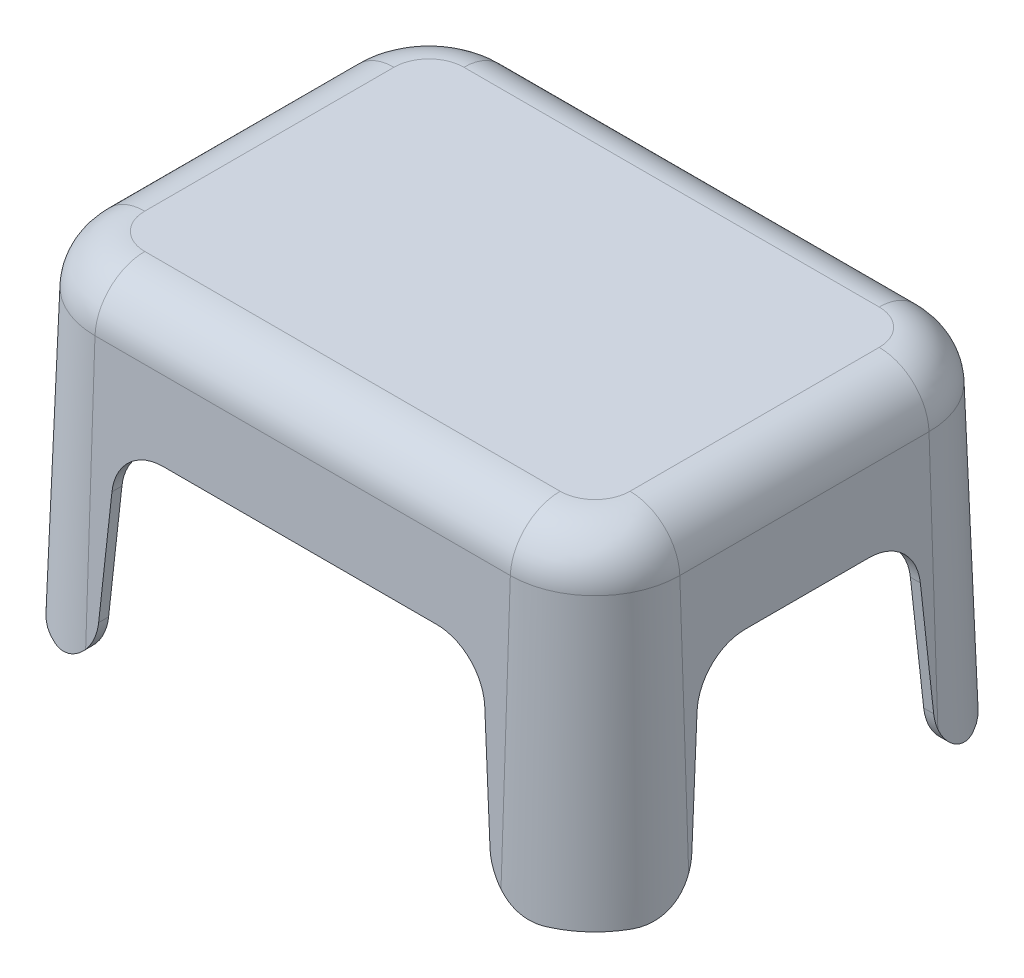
ISO-10303-21;
HEADER;
FILE_DESCRIPTION(('STEP AP214'),'2;1');
FILE_NAME('part.step','',(''),(''),'','','');
FILE_SCHEMA(('AUTOMOTIVE_DESIGN { 1 0 10303 214 1 1 1 1 }'));
ENDSEC;
DATA;
#1=APPLICATION_CONTEXT('core data for automotive mechanical design processes');
#2=APPLICATION_PROTOCOL_DEFINITION('international standard','automotive_design',2000,#1);
#3=PRODUCT_CONTEXT('',#1,'mechanical');
#4=PRODUCT('Part','Part','',(#3));
#5=PRODUCT_RELATED_PRODUCT_CATEGORY('part','',(#4));
#6=PRODUCT_DEFINITION_FORMATION('','',#4);
#7=PRODUCT_DEFINITION_CONTEXT('part definition',#1,'design');
#8=PRODUCT_DEFINITION('design','',#6,#7);
#9=PRODUCT_DEFINITION_SHAPE('','',#8);
#10=(LENGTH_UNIT() NAMED_UNIT(*) SI_UNIT(.MILLI.,.METRE.));
#11=(NAMED_UNIT(*) PLANE_ANGLE_UNIT() SI_UNIT($,.RADIAN.));
#12=(NAMED_UNIT(*) SI_UNIT($,.STERADIAN.) SOLID_ANGLE_UNIT());
#13=UNCERTAINTY_MEASURE_WITH_UNIT(LENGTH_MEASURE(1.E-05),#10,'distance_accuracy_value','');
#14=(GEOMETRIC_REPRESENTATION_CONTEXT(3) GLOBAL_UNCERTAINTY_ASSIGNED_CONTEXT((#13)) GLOBAL_UNIT_ASSIGNED_CONTEXT((#10,
#11,#12)) REPRESENTATION_CONTEXT('',''));
#15=CARTESIAN_POINT('',(0.,0.,0.));
#16=DIRECTION('',(0.,0.,1.));
#17=DIRECTION('',(1.,0.,0.));
#18=AXIS2_PLACEMENT_3D('',#15,#16,#17);
#19=CARTESIAN_POINT('',(169.003655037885,-0.209396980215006,-74.9999999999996));
#20=DIRECTION('',(0.999390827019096,0.034899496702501,0.));
#21=DIRECTION('',(-0.034899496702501,0.999390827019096,0.));
#22=AXIS2_PLACEMENT_3D('',#19,#20,#21);
#23=PLANE('',#22);
#24=DIRECTION('',(-0.034899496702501,0.999390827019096,0.));
#25=VECTOR('',#24,1.);
#26=CARTESIAN_POINT('',(169.003655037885,-0.209396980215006,-32.));
#27=LINE('',#26,#25);
#28=CARTESIAN_POINT('',(171.615400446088,-75.,-32.));
#29=VERTEX_POINT('',#28);
#30=CARTESIAN_POINT('',(170.014716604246,-29.16241207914,-32.));
#31=VERTEX_POINT('',#30);
#32=EDGE_CURVE('E1883',#29,#31,#27,.T.);
#33=ORIENTED_EDGE('',*,*,#32,.F.);
#34=DIRECTION('',(0.,0.,-1.));
#35=VECTOR('',#34,1.);
#36=CARTESIAN_POINT('',(171.615400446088,-75.,-74.9999999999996));
#37=LINE('',#36,#35);
#38=CARTESIAN_POINT('',(171.615400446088,-75.,32.));
#39=VERTEX_POINT('',#38);
#40=EDGE_CURVE('E1004',#39,#29,#37,.T.);
#41=ORIENTED_EDGE('',*,*,#40,.F.);
#42=DIRECTION('',(-0.034899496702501,0.999390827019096,0.));
#43=VECTOR('',#42,1.);
#44=CARTESIAN_POINT('',(169.003655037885,-0.209396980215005,32.));
#45=LINE('',#44,#43);
#46=CARTESIAN_POINT('',(170.014716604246,-29.16241207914,32.));
#47=VERTEX_POINT('',#46);
#48=EDGE_CURVE('E816',#39,#47,#45,.T.);
#49=ORIENTED_EDGE('',*,*,#48,.T.);
#50=DIRECTION('',(0.,0.,1.));
#51=VECTOR('',#50,1.);
#52=CARTESIAN_POINT('',(170.014716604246,-29.16241207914,-74.9999999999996));
#53=LINE('',#52,#51);
#54=EDGE_CURVE('E1094',#31,#47,#53,.T.);
#55=ORIENTED_EDGE('',*,*,#54,.F.);
#56=EDGE_LOOP('',(#33,#41,#49,#55));
#57=FACE_BOUND('',#56,.T.);
#58=ADVANCED_FACE('F33',(#57),#23,.F.);
#59=CARTESIAN_POINT('',(-169.003655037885,-0.209396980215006,-74.9999999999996));
#60=DIRECTION('',(-0.999390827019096,0.034899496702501,0.));
#61=DIRECTION('',(-0.034899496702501,-0.999390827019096,0.));
#62=AXIS2_PLACEMENT_3D('',#59,#60,#61);
#63=PLANE('',#62);
#64=DIRECTION('',(-0.034899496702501,-0.999390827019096,0.));
#65=VECTOR('',#64,1.);
#66=CARTESIAN_POINT('',(-169.003655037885,-0.209396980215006,-32.));
#67=LINE('',#66,#65);
#68=CARTESIAN_POINT('',(-170.014716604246,-29.16241207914,-32.));
#69=VERTEX_POINT('',#68);
#70=CARTESIAN_POINT('',(-171.615400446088,-75.0000000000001,-32.));
#71=VERTEX_POINT('',#70);
#72=EDGE_CURVE('E1874',#69,#71,#67,.T.);
#73=ORIENTED_EDGE('',*,*,#72,.F.);
#74=DIRECTION('',(0.,0.,1.));
#75=VECTOR('',#74,1.);
#76=CARTESIAN_POINT('',(-170.014716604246,-29.16241207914,-74.9999999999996));
#77=LINE('',#76,#75);
#78=CARTESIAN_POINT('',(-170.014716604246,-29.16241207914,32.));
#79=VERTEX_POINT('',#78);
#80=EDGE_CURVE('E1119',#79,#69,#77,.F.);
#81=ORIENTED_EDGE('',*,*,#80,.F.);
#82=DIRECTION('',(-0.034899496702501,-0.999390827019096,0.));
#83=VECTOR('',#82,1.);
#84=CARTESIAN_POINT('',(-169.003655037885,-0.209396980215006,32.));
#85=LINE('',#84,#83);
#86=CARTESIAN_POINT('',(-171.615400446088,-75.0000000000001,32.));
#87=VERTEX_POINT('',#86);
#88=EDGE_CURVE('E828',#79,#87,#85,.T.);
#89=ORIENTED_EDGE('',*,*,#88,.T.);
#90=DIRECTION('',(0.,0.,1.));
#91=VECTOR('',#90,1.);
#92=CARTESIAN_POINT('',(-171.615400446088,-75.,-74.9999999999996));
#93=LINE('',#92,#91);
#94=EDGE_CURVE('E1302',#71,#87,#93,.T.);
#95=ORIENTED_EDGE('',*,*,#94,.F.);
#96=EDGE_LOOP('',(#73,#81,#89,#95));
#97=FACE_BOUND('',#96,.T.);
#98=ADVANCED_FACE('F1599',(#97),#63,.F.);
#99=CARTESIAN_POINT('',(125.,-6.,-75.));
#100=DIRECTION('',(0.,-1.,0.));
#101=DIRECTION('',(0.,0.,-1.));
#102=AXIS2_PLACEMENT_3D('',#99,#100,#101);
#103=PLANE('',#102);
#104=DIRECTION('',(0.,0.,1.));
#105=VECTOR('',#104,1.);
#106=CARTESIAN_POINT('',(3.,-6.,-75.));
#107=LINE('',#106,#105);
#108=CARTESIAN_POINT('',(3.,-6.,-32.));
#109=VERTEX_POINT('',#108);
#110=CARTESIAN_POINT('',(2.99999999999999,-6.,32.));
#111=VERTEX_POINT('',#110);
#112=EDGE_CURVE('E955',#109,#111,#107,.T.);
#113=ORIENTED_EDGE('',*,*,#112,.F.);
#114=DIRECTION('',(1.,0.,0.));
#115=VECTOR('',#114,1.);
#116=CARTESIAN_POINT('',(125.,-6.,-32.));
#117=LINE('',#116,#115);
#118=CARTESIAN_POINT('',(67.,-6.00000000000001,-32.));
#119=VERTEX_POINT('',#118);
#120=EDGE_CURVE('E1896',#109,#119,#117,.T.);
#121=ORIENTED_EDGE('',*,*,#120,.T.);
#122=DIRECTION('',(0.,0.,1.));
#123=VECTOR('',#122,1.);
#124=CARTESIAN_POINT('',(67.,-6.,-75.));
#125=LINE('',#124,#123);
#126=CARTESIAN_POINT('',(67.,-6.,32.));
#127=VERTEX_POINT('',#126);
#128=EDGE_CURVE('E862',#119,#127,#125,.T.);
#129=ORIENTED_EDGE('',*,*,#128,.T.);
#130=DIRECTION('',(1.,0.,0.));
#131=VECTOR('',#130,1.);
#132=CARTESIAN_POINT('',(125.,-6.,32.));
#133=LINE('',#132,#131);
#134=EDGE_CURVE('E802',#111,#127,#133,.T.);
#135=ORIENTED_EDGE('',*,*,#134,.F.);
#136=EDGE_LOOP('',(#113,#121,#129,#135));
#137=FACE_BOUND('',#136,.T.);
#138=ADVANCED_FACE('F1543',(#137),#103,.T.);
#139=DIRECTION('',(0.,0.,-1.));
#140=VECTOR('',#139,1.);
#141=CARTESIAN_POINT('',(-146.029336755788,-6.,-75.));
#142=LINE('',#141,#140);
#143=CARTESIAN_POINT('',(-146.029336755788,-6.,-32.));
#144=VERTEX_POINT('',#143);
#145=CARTESIAN_POINT('',(-146.029336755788,-6.,32.));
#146=VERTEX_POINT('',#145);
#147=EDGE_CURVE('E1160',#144,#146,#142,.F.);
#148=ORIENTED_EDGE('',*,*,#147,.F.);
#149=DIRECTION('',(1.,0.,0.));
#150=VECTOR('',#149,1.);
#151=CARTESIAN_POINT('',(125.,-6.,-32.));
#152=LINE('',#151,#150);
#153=CARTESIAN_POINT('',(-73.,-6.,-32.));
#154=VERTEX_POINT('',#153);
#155=EDGE_CURVE('E1878',#144,#154,#152,.T.);
#156=ORIENTED_EDGE('',*,*,#155,.T.);
#157=DIRECTION('',(0.,0.,1.));
#158=VECTOR('',#157,1.);
#159=CARTESIAN_POINT('',(-73.,-6.,-75.));
#160=LINE('',#159,#158);
#161=CARTESIAN_POINT('',(-73.,-6.00000000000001,32.));
#162=VERTEX_POINT('',#161);
#163=EDGE_CURVE('E903',#154,#162,#160,.T.);
#164=ORIENTED_EDGE('',*,*,#163,.T.);
#165=DIRECTION('',(1.,0.,0.));
#166=VECTOR('',#165,1.);
#167=CARTESIAN_POINT('',(125.,-6.,32.));
#168=LINE('',#167,#166);
#169=EDGE_CURVE('E822',#146,#162,#168,.T.);
#170=ORIENTED_EDGE('',*,*,#169,.F.);
#171=EDGE_LOOP('',(#148,#156,#164,#170));
#172=FACE_BOUND('',#171,.T.);
#173=ADVANCED_FACE('F2201',(#172),#103,.T.);
#174=DIRECTION('',(0.,0.,1.));
#175=VECTOR('',#174,1.);
#176=CARTESIAN_POINT('',(-67.,-6.,-75.));
#177=LINE('',#176,#175);
#178=CARTESIAN_POINT('',(-67.,-6.,-32.));
#179=VERTEX_POINT('',#178);
#180=CARTESIAN_POINT('',(-67.,-6.,32.));
#181=VERTEX_POINT('',#180);
#182=EDGE_CURVE('E919',#179,#181,#177,.T.);
#183=ORIENTED_EDGE('',*,*,#182,.F.);
#184=DIRECTION('',(1.,0.,0.));
#185=VECTOR('',#184,1.);
#186=CARTESIAN_POINT('',(125.,-6.,-32.));
#187=LINE('',#186,#185);
#188=CARTESIAN_POINT('',(-3.00000000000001,-6.,-32.));
#189=VERTEX_POINT('',#188);
#190=EDGE_CURVE('E1870',#179,#189,#187,.T.);
#191=ORIENTED_EDGE('',*,*,#190,.T.);
#192=DIRECTION('',(0.,0.,1.));
#193=VECTOR('',#192,1.);
#194=CARTESIAN_POINT('',(-3.,-6.,-75.));
#195=LINE('',#194,#193);
#196=CARTESIAN_POINT('',(-3.00000000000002,-6.,32.));
#197=VERTEX_POINT('',#196);
#198=EDGE_CURVE('E942',#189,#197,#195,.T.);
#199=ORIENTED_EDGE('',*,*,#198,.T.);
#200=DIRECTION('',(1.,0.,0.));
#201=VECTOR('',#200,1.);
#202=CARTESIAN_POINT('',(125.,-6.,32.));
#203=LINE('',#202,#201);
#204=EDGE_CURVE('E834',#181,#197,#203,.T.);
#205=ORIENTED_EDGE('',*,*,#204,.F.);
#206=EDGE_LOOP('',(#183,#191,#199,#205));
#207=FACE_BOUND('',#206,.T.);
#208=ADVANCED_FACE('F1997',(#207),#103,.T.);
#209=DIRECTION('',(0.,0.,1.));
#210=VECTOR('',#209,1.);
#211=CARTESIAN_POINT('',(73.,-6.,-75.));
#212=LINE('',#211,#210);
#213=CARTESIAN_POINT('',(73.,-6.00000000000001,-32.));
#214=VERTEX_POINT('',#213);
#215=CARTESIAN_POINT('',(73.,-6.00000000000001,32.));
#216=VERTEX_POINT('',#215);
#217=EDGE_CURVE('E878',#214,#216,#212,.T.);
#218=ORIENTED_EDGE('',*,*,#217,.F.);
#219=DIRECTION('',(1.,0.,0.));
#220=VECTOR('',#219,1.);
#221=CARTESIAN_POINT('',(125.,-6.,-32.));
#222=LINE('',#221,#220);
#223=CARTESIAN_POINT('',(146.029336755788,-6.,-32.));
#224=VERTEX_POINT('',#223);
#225=EDGE_CURVE('E1887',#214,#224,#222,.T.);
#226=ORIENTED_EDGE('',*,*,#225,.T.);
#227=DIRECTION('',(0.,0.,-1.));
#228=VECTOR('',#227,1.);
#229=CARTESIAN_POINT('',(146.029336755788,-6.,-75.));
#230=LINE('',#229,#228);
#231=CARTESIAN_POINT('',(146.029336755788,-6.,32.));
#232=VERTEX_POINT('',#231);
#233=EDGE_CURVE('E1149',#232,#224,#230,.T.);
#234=ORIENTED_EDGE('',*,*,#233,.F.);
#235=DIRECTION('',(1.,0.,0.));
#236=VECTOR('',#235,1.);
#237=CARTESIAN_POINT('',(125.,-6.,32.));
#238=LINE('',#237,#236);
#239=EDGE_CURVE('E811',#216,#232,#238,.T.);
#240=ORIENTED_EDGE('',*,*,#239,.F.);
#241=EDGE_LOOP('',(#218,#226,#234,#240));
#242=FACE_BOUND('',#241,.T.);
#243=ADVANCED_FACE('F2137',(#242),#103,.T.);
#244=CARTESIAN_POINT('',(-146.029336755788,-30.,-75.));
#245=DIRECTION('',(0.,0.,-1.));
#246=DIRECTION('',(-1.,0.,0.));
#247=AXIS2_PLACEMENT_3D('',#244,#245,#246);
#248=CYLINDRICAL_SURFACE('',#247,24.);
#249=CARTESIAN_POINT('',(-146.029336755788,-30.,-32.));
#250=DIRECTION('',(0.,0.,-1.));
#251=DIRECTION('',(-1.,0.,0.));
#252=AXIS2_PLACEMENT_3D('',#249,#250,#251);
#253=CIRCLE('',#252,24.);
#254=EDGE_CURVE('E1876',#144,#69,#253,.F.);
#255=ORIENTED_EDGE('',*,*,#254,.F.);
#256=ORIENTED_EDGE('',*,*,#147,.T.);
#257=CARTESIAN_POINT('',(-146.029336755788,-30.,32.));
#258=DIRECTION('',(0.,0.,-1.));
#259=DIRECTION('',(-1.,0.,0.));
#260=AXIS2_PLACEMENT_3D('',#257,#258,#259);
#261=CIRCLE('',#260,24.);
#262=EDGE_CURVE('E825',#146,#79,#261,.F.);
#263=ORIENTED_EDGE('',*,*,#262,.T.);
#264=ORIENTED_EDGE('',*,*,#80,.T.);
#265=EDGE_LOOP('',(#255,#256,#263,#264));
#266=FACE_BOUND('',#265,.T.);
#267=ADVANCED_FACE('F1549',(#266),#248,.F.);
#268=CARTESIAN_POINT('',(146.029336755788,-30.,-75.));
#269=DIRECTION('',(0.,0.,1.));
#270=DIRECTION('',(1.,0.,0.));
#271=AXIS2_PLACEMENT_3D('',#268,#269,#270);
#272=CYLINDRICAL_SURFACE('',#271,24.);
#273=CARTESIAN_POINT('',(146.029336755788,-30.,-32.));
#274=DIRECTION('',(0.,0.,-1.));
#275=DIRECTION('',(-1.,0.,0.));
#276=AXIS2_PLACEMENT_3D('',#273,#274,#275);
#277=CIRCLE('',#276,24.);
#278=EDGE_CURVE('E1885',#31,#224,#277,.F.);
#279=ORIENTED_EDGE('',*,*,#278,.F.);
#280=ORIENTED_EDGE('',*,*,#54,.T.);
#281=CARTESIAN_POINT('',(146.029336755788,-30.,32.));
#282=DIRECTION('',(0.,0.,-1.));
#283=DIRECTION('',(-1.,0.,0.));
#284=AXIS2_PLACEMENT_3D('',#281,#282,#283);
#285=CIRCLE('',#284,24.);
#286=EDGE_CURVE('E813',#47,#232,#285,.F.);
#287=ORIENTED_EDGE('',*,*,#286,.T.);
#288=ORIENTED_EDGE('',*,*,#233,.T.);
#289=EDGE_LOOP('',(#279,#280,#287,#288));
#290=FACE_BOUND('',#289,.T.);
#291=ADVANCED_FACE('F1582',(#290),#272,.F.);
#292=CARTESIAN_POINT('',(3.00000000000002,-75.0000000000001,121.615400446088));
#293=DIRECTION('',(1.,0.,0.));
#294=DIRECTION('',(0.,1.,0.));
#295=AXIS2_PLACEMENT_3D('',#292,#293,#294);
#296=PLANE('',#295);
#297=DIRECTION('',(0.,0.,1.));
#298=VECTOR('',#297,1.);
#299=CARTESIAN_POINT('',(3.00000000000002,-75.0000000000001,121.615400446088));
#300=LINE('',#299,#298);
#301=CARTESIAN_POINT('',(3.,-75.,32.));
#302=VERTEX_POINT('',#301);
#303=CARTESIAN_POINT('',(3.,-75.,-32.));
#304=VERTEX_POINT('',#303);
#305=EDGE_CURVE('E933',#302,#304,#300,.F.);
#306=ORIENTED_EDGE('',*,*,#305,.T.);
#307=DIRECTION('',(0.,1.,0.));
#308=VECTOR('',#307,1.);
#309=CARTESIAN_POINT('',(3.00000000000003,-75.0000000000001,-32.));
#310=LINE('',#309,#308);
#311=EDGE_CURVE('E1893',#304,#109,#310,.T.);
#312=ORIENTED_EDGE('',*,*,#311,.T.);
#313=ORIENTED_EDGE('',*,*,#112,.T.);
#314=DIRECTION('',(0.,1.,0.));
#315=VECTOR('',#314,1.);
#316=CARTESIAN_POINT('',(3.00000000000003,-75.0000000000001,32.));
#317=LINE('',#316,#315);
#318=EDGE_CURVE('E805',#302,#111,#317,.T.);
#319=ORIENTED_EDGE('',*,*,#318,.F.);
#320=EDGE_LOOP('',(#306,#312,#313,#319));
#321=FACE_BOUND('',#320,.T.);
#322=ADVANCED_FACE('F1921',(#321),#296,.T.);
#323=CARTESIAN_POINT('',(-2.99999999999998,-75.0000000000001,121.615400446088));
#324=DIRECTION('',(1.,0.,0.));
#325=DIRECTION('',(0.,1.,0.));
#326=AXIS2_PLACEMENT_3D('',#323,#324,#325);
#327=PLANE('',#326);
#328=DIRECTION('',(0.,1.,0.));
#329=VECTOR('',#328,1.);
#330=CARTESIAN_POINT('',(-2.99999999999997,-75.0000000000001,-32.));
#331=LINE('',#330,#329);
#332=CARTESIAN_POINT('',(-2.99999999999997,-75.0000000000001,-32.));
#333=VERTEX_POINT('',#332);
#334=EDGE_CURVE('E1867',#333,#189,#331,.T.);
#335=ORIENTED_EDGE('',*,*,#334,.F.);
#336=DIRECTION('',(0.,0.,1.));
#337=VECTOR('',#336,1.);
#338=CARTESIAN_POINT('',(-2.99999999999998,-75.0000000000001,121.615400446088));
#339=LINE('',#338,#337);
#340=CARTESIAN_POINT('',(-2.99999999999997,-75.0000000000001,32.));
#341=VERTEX_POINT('',#340);
#342=EDGE_CURVE('E938',#341,#333,#339,.F.);
#343=ORIENTED_EDGE('',*,*,#342,.F.);
#344=DIRECTION('',(0.,1.,0.));
#345=VECTOR('',#344,1.);
#346=CARTESIAN_POINT('',(-2.99999999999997,-75.0000000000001,32.));
#347=LINE('',#346,#345);
#348=EDGE_CURVE('E837',#341,#197,#347,.T.);
#349=ORIENTED_EDGE('',*,*,#348,.T.);
#350=ORIENTED_EDGE('',*,*,#198,.F.);
#351=EDGE_LOOP('',(#335,#343,#349,#350));
#352=FACE_BOUND('',#351,.T.);
#353=ADVANCED_FACE('F2157',(#352),#327,.F.);
#354=CARTESIAN_POINT('',(-67.,-75.0000000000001,121.615400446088));
#355=DIRECTION('',(1.,0.,0.));
#356=DIRECTION('',(0.,1.,0.));
#357=AXIS2_PLACEMENT_3D('',#354,#355,#356);
#358=PLANE('',#357);
#359=DIRECTION('',(0.,0.,1.));
#360=VECTOR('',#359,1.);
#361=CARTESIAN_POINT('',(-67.,-75.0000000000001,121.615400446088));
#362=LINE('',#361,#360);
#363=CARTESIAN_POINT('',(-67.,-75.0000000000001,32.));
#364=VERTEX_POINT('',#363);
#365=CARTESIAN_POINT('',(-67.,-75.0000000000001,-32.));
#366=VERTEX_POINT('',#365);
#367=EDGE_CURVE('E891',#364,#366,#362,.F.);
#368=ORIENTED_EDGE('',*,*,#367,.T.);
#369=DIRECTION('',(0.,1.,0.));
#370=VECTOR('',#369,1.);
#371=CARTESIAN_POINT('',(-67.,-75.0000000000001,-32.));
#372=LINE('',#371,#370);
#373=EDGE_CURVE('E1872',#366,#179,#372,.T.);
#374=ORIENTED_EDGE('',*,*,#373,.T.);
#375=ORIENTED_EDGE('',*,*,#182,.T.);
#376=DIRECTION('',(0.,1.,0.));
#377=VECTOR('',#376,1.);
#378=CARTESIAN_POINT('',(-67.,-75.0000000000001,32.));
#379=LINE('',#378,#377);
#380=EDGE_CURVE('E831',#364,#181,#379,.T.);
#381=ORIENTED_EDGE('',*,*,#380,.F.);
#382=EDGE_LOOP('',(#368,#374,#375,#381));
#383=FACE_BOUND('',#382,.T.);
#384=ADVANCED_FACE('F1992',(#383),#358,.T.);
#385=CARTESIAN_POINT('',(-73.,-75.0000000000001,121.615400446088));
#386=DIRECTION('',(1.,0.,0.));
#387=DIRECTION('',(0.,1.,0.));
#388=AXIS2_PLACEMENT_3D('',#385,#386,#387);
#389=PLANE('',#388);
#390=DIRECTION('',(0.,1.,0.));
#391=VECTOR('',#390,1.);
#392=CARTESIAN_POINT('',(-73.,-75.0000000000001,-32.));
#393=LINE('',#392,#391);
#394=CARTESIAN_POINT('',(-73.,-75.,-32.));
#395=VERTEX_POINT('',#394);
#396=EDGE_CURVE('E1881',#395,#154,#393,.T.);
#397=ORIENTED_EDGE('',*,*,#396,.F.);
#398=DIRECTION('',(0.,0.,1.));
#399=VECTOR('',#398,1.);
#400=CARTESIAN_POINT('',(-73.,-75.0000000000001,121.615400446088));
#401=LINE('',#400,#399);
#402=CARTESIAN_POINT('',(-73.,-75.,32.));
#403=VERTEX_POINT('',#402);
#404=EDGE_CURVE('E896',#403,#395,#401,.F.);
#405=ORIENTED_EDGE('',*,*,#404,.F.);
#406=DIRECTION('',(0.,1.,0.));
#407=VECTOR('',#406,1.);
#408=CARTESIAN_POINT('',(-73.,-75.0000000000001,32.));
#409=LINE('',#408,#407);
#410=EDGE_CURVE('E819',#403,#162,#409,.T.);
#411=ORIENTED_EDGE('',*,*,#410,.T.);
#412=ORIENTED_EDGE('',*,*,#163,.F.);
#413=EDGE_LOOP('',(#397,#405,#411,#412));
#414=FACE_BOUND('',#413,.T.);
#415=ADVANCED_FACE('F2250',(#414),#389,.F.);
#416=CARTESIAN_POINT('',(73.,-75.,121.615400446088));
#417=DIRECTION('',(1.,0.,0.));
#418=DIRECTION('',(0.,1.,0.));
#419=AXIS2_PLACEMENT_3D('',#416,#417,#418);
#420=PLANE('',#419);
#421=DIRECTION('',(0.,0.,1.));
#422=VECTOR('',#421,1.);
#423=CARTESIAN_POINT('',(73.,-75.,121.615400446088));
#424=LINE('',#423,#422);
#425=CARTESIAN_POINT('',(73.,-75.,32.));
#426=VERTEX_POINT('',#425);
#427=CARTESIAN_POINT('',(73.,-75.,-32.));
#428=VERTEX_POINT('',#427);
#429=EDGE_CURVE('E850',#426,#428,#424,.F.);
#430=ORIENTED_EDGE('',*,*,#429,.T.);
#431=DIRECTION('',(0.,1.,0.));
#432=VECTOR('',#431,1.);
#433=CARTESIAN_POINT('',(73.,-75.,-32.));
#434=LINE('',#433,#432);
#435=EDGE_CURVE('E1890',#428,#214,#434,.T.);
#436=ORIENTED_EDGE('',*,*,#435,.T.);
#437=ORIENTED_EDGE('',*,*,#217,.T.);
#438=DIRECTION('',(0.,1.,0.));
#439=VECTOR('',#438,1.);
#440=CARTESIAN_POINT('',(73.,-75.,32.));
#441=LINE('',#440,#439);
#442=EDGE_CURVE('E808',#426,#216,#441,.T.);
#443=ORIENTED_EDGE('',*,*,#442,.F.);
#444=EDGE_LOOP('',(#430,#436,#437,#443));
#445=FACE_BOUND('',#444,.T.);
#446=ADVANCED_FACE('F2015',(#445),#420,.T.);
#447=CARTESIAN_POINT('',(67.,-75.,121.615400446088));
#448=DIRECTION('',(1.,0.,0.));
#449=DIRECTION('',(0.,1.,0.));
#450=AXIS2_PLACEMENT_3D('',#447,#448,#449);
#451=PLANE('',#450);
#452=DIRECTION('',(0.,1.,0.));
#453=VECTOR('',#452,1.);
#454=CARTESIAN_POINT('',(67.,-75.,-32.));
#455=LINE('',#454,#453);
#456=CARTESIAN_POINT('',(67.,-75.,-32.));
#457=VERTEX_POINT('',#456);
#458=EDGE_CURVE('E1316',#457,#119,#455,.T.);
#459=ORIENTED_EDGE('',*,*,#458,.F.);
#460=DIRECTION('',(0.,0.,1.));
#461=VECTOR('',#460,1.);
#462=CARTESIAN_POINT('',(67.,-75.,121.615400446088));
#463=LINE('',#462,#461);
#464=CARTESIAN_POINT('',(67.,-75.,32.));
#465=VERTEX_POINT('',#464);
#466=EDGE_CURVE('E855',#465,#457,#463,.F.);
#467=ORIENTED_EDGE('',*,*,#466,.F.);
#468=DIRECTION('',(0.,1.,0.));
#469=VECTOR('',#468,1.);
#470=CARTESIAN_POINT('',(67.,-75.,32.));
#471=LINE('',#470,#469);
#472=EDGE_CURVE('E1313',#465,#127,#471,.T.);
#473=ORIENTED_EDGE('',*,*,#472,.T.);
#474=ORIENTED_EDGE('',*,*,#128,.F.);
#475=EDGE_LOOP('',(#459,#467,#473,#474));
#476=FACE_BOUND('',#475,.T.);
#477=ADVANCED_FACE('F2082',(#476),#451,.F.);
#478=CARTESIAN_POINT('',(2.99999999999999,-6.,38.));
#479=VERTEX_POINT('',#478);
#480=CARTESIAN_POINT('',(2.99999999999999,-6.,96.0293367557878));
#481=VERTEX_POINT('',#480);
#482=EDGE_CURVE('E950',#479,#481,#107,.T.);
#483=ORIENTED_EDGE('',*,*,#482,.F.);
#484=DIRECTION('',(1.,0.,0.));
#485=VECTOR('',#484,1.);
#486=CARTESIAN_POINT('',(125.,-6.,38.));
#487=LINE('',#486,#485);
#488=CARTESIAN_POINT('',(67.,-6.00000000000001,38.));
#489=VERTEX_POINT('',#488);
#490=EDGE_CURVE('E770',#479,#489,#487,.T.);
#491=ORIENTED_EDGE('',*,*,#490,.T.);
#492=CARTESIAN_POINT('',(67.,-6.,96.0293367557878));
#493=VERTEX_POINT('',#492);
#494=EDGE_CURVE('E857',#489,#493,#125,.T.);
#495=ORIENTED_EDGE('',*,*,#494,.T.);
#496=DIRECTION('',(1.,0.,0.));
#497=VECTOR('',#496,1.);
#498=CARTESIAN_POINT('',(125.,-6.,96.0293367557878));
#499=LINE('',#498,#497);
#500=EDGE_CURVE('E1166',#481,#493,#499,.T.);
#501=ORIENTED_EDGE('',*,*,#500,.F.);
#502=EDGE_LOOP('',(#483,#491,#495,#501));
#503=FACE_BOUND('',#502,.T.);
#504=ADVANCED_FACE('F2096',(#503),#103,.T.);
#505=CARTESIAN_POINT('',(-146.029336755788,-6.,38.));
#506=VERTEX_POINT('',#505);
#507=CARTESIAN_POINT('',(-146.029336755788,-6.,74.9999999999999));
#508=VERTEX_POINT('',#507);
#509=EDGE_CURVE('E1136',#506,#508,#142,.F.);
#510=ORIENTED_EDGE('',*,*,#509,.F.);
#511=DIRECTION('',(1.,0.,0.));
#512=VECTOR('',#511,1.);
#513=CARTESIAN_POINT('',(125.,-6.,38.));
#514=LINE('',#513,#512);
#515=CARTESIAN_POINT('',(-73.,-6.,38.));
#516=VERTEX_POINT('',#515);
#517=EDGE_CURVE('E788',#506,#516,#514,.T.);
#518=ORIENTED_EDGE('',*,*,#517,.T.);
#519=CARTESIAN_POINT('',(-73.,-6.,96.0293367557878));
#520=VERTEX_POINT('',#519);
#521=EDGE_CURVE('E898',#516,#520,#160,.T.);
#522=ORIENTED_EDGE('',*,*,#521,.T.);
#523=CARTESIAN_POINT('',(-125.,-6.,96.0293367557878));
#524=VERTEX_POINT('',#523);
#525=EDGE_CURVE('E1145',#524,#520,#499,.T.);
#526=ORIENTED_EDGE('',*,*,#525,.F.);
#527=CARTESIAN_POINT('',(-125.,-6.,75.));
#528=DIRECTION('',(0.,-1.,0.));
#529=DIRECTION('',(0.,0.,-1.));
#530=AXIS2_PLACEMENT_3D('',#527,#528,#529);
#531=CIRCLE('',#530,21.0293367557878);
#532=EDGE_CURVE('E1159',#508,#524,#531,.F.);
#533=ORIENTED_EDGE('',*,*,#532,.F.);
#534=EDGE_LOOP('',(#510,#518,#522,#526,#533));
#535=FACE_BOUND('',#534,.T.);
#536=ADVANCED_FACE('F1614',(#535),#103,.T.);
#537=CARTESIAN_POINT('',(-67.,-6.,38.));
#538=VERTEX_POINT('',#537);
#539=CARTESIAN_POINT('',(-67.,-6.,96.0293367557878));
#540=VERTEX_POINT('',#539);
#541=EDGE_CURVE('E914',#538,#540,#177,.T.);
#542=ORIENTED_EDGE('',*,*,#541,.F.);
#543=DIRECTION('',(1.,0.,0.));
#544=VECTOR('',#543,1.);
#545=CARTESIAN_POINT('',(125.,-6.,38.));
#546=LINE('',#545,#544);
#547=CARTESIAN_POINT('',(-3.00000000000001,-6.,38.));
#548=VERTEX_POINT('',#547);
#549=EDGE_CURVE('E797',#538,#548,#546,.T.);
#550=ORIENTED_EDGE('',*,*,#549,.T.);
#551=CARTESIAN_POINT('',(-3.00000000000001,-6.,96.0293367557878));
#552=VERTEX_POINT('',#551);
#553=EDGE_CURVE('E932',#548,#552,#195,.T.);
#554=ORIENTED_EDGE('',*,*,#553,.T.);
#555=EDGE_CURVE('E1165',#540,#552,#499,.T.);
#556=ORIENTED_EDGE('',*,*,#555,.F.);
#557=EDGE_LOOP('',(#542,#550,#554,#556));
#558=FACE_BOUND('',#557,.T.);
#559=ADVANCED_FACE('F1607',(#558),#103,.T.);
#560=DIRECTION('',(-0.034899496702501,0.999390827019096,0.));
#561=VECTOR('',#560,1.);
#562=CARTESIAN_POINT('',(169.003655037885,-0.209396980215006,-74.9999999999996));
#563=LINE('',#562,#561);
#564=CARTESIAN_POINT('',(175.335508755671,-181.529963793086,-74.9999999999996));
#565=VERTEX_POINT('',#564);
#566=CARTESIAN_POINT('',(170.014716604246,-29.16241207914,-74.9999999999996));
#567=VERTEX_POINT('',#566);
#568=EDGE_CURVE('E1086',#565,#567,#563,.T.);
#569=ORIENTED_EDGE('',*,*,#568,.F.);
#570=CARTESIAN_POINT('',(174.932873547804,-170.,-102.695846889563));
#571=DIRECTION('',(0.999390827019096,0.034899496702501,0.));
#572=DIRECTION('',(-0.034899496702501,0.999390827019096,0.));
#573=AXIS2_PLACEMENT_3D('',#570,#571,#572);
#574=ELLIPSE('',#573,30.0182863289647,30.);
#575=CARTESIAN_POINT('',(175.016416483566,-172.392356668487,-72.791388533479));
#576=VERTEX_POINT('',#575);
#577=EDGE_CURVE('E1620',#565,#576,#574,.F.);
#578=ORIENTED_EDGE('',*,*,#577,.T.);
#579=DIRECTION('',(0.0347884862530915,-0.996211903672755,-0.0796969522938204));
#580=VECTOR('',#579,1.);
#581=CARTESIAN_POINT('',(169.047969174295,-1.47838781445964,-59.1182710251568));
#582=LINE('',#581,#580);
#583=CARTESIAN_POINT('',(172.579480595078,-102.607643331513,-67.2086114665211));
#584=VERTEX_POINT('',#583);
#585=EDGE_CURVE('E980',#584,#576,#582,.T.);
#586=ORIENTED_EDGE('',*,*,#585,.F.);
#587=CARTESIAN_POINT('',(172.663023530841,-105.,-37.3041531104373));
#588=DIRECTION('',(0.999390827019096,0.034899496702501,0.));
#589=DIRECTION('',(-0.034899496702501,0.999390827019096,0.));
#590=AXIS2_PLACEMENT_3D('',#587,#588,#589);
#591=ELLIPSE('',#590,30.0182863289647,30.);
#592=CARTESIAN_POINT('',(171.615400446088,-75.,-37.3041531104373));
#593=VERTEX_POINT('',#592);
#594=EDGE_CURVE('E1011',#593,#584,#591,.F.);
#595=ORIENTED_EDGE('',*,*,#594,.F.);
#596=DIRECTION('',(0.,0.,-1.));
#597=VECTOR('',#596,1.);
#598=CARTESIAN_POINT('',(171.615400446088,-75.,-74.9999999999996));
#599=LINE('',#598,#597);
#600=CARTESIAN_POINT('',(171.615400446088,-75.,-38.));
#601=VERTEX_POINT('',#600);
#602=EDGE_CURVE('E727',#593,#601,#599,.T.);
#603=ORIENTED_EDGE('',*,*,#602,.T.);
#604=DIRECTION('',(-0.034899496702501,0.999390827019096,0.));
#605=VECTOR('',#604,1.);
#606=CARTESIAN_POINT('',(169.003655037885,-0.209396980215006,-38.));
#607=LINE('',#606,#605);
#608=CARTESIAN_POINT('',(170.014716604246,-29.16241207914,-38.));
#609=VERTEX_POINT('',#608);
#610=EDGE_CURVE('E1852',#601,#609,#607,.T.);
#611=ORIENTED_EDGE('',*,*,#610,.T.);
#612=EDGE_CURVE('E1090',#567,#609,#53,.T.);
#613=ORIENTED_EDGE('',*,*,#612,.F.);
#614=EDGE_LOOP('',(#569,#578,#586,#595,#603,#611,#613));
#615=FACE_BOUND('',#614,.T.);
#616=ADVANCED_FACE('F1361',(#615),#23,.F.);
#617=DIRECTION('',(0.0347884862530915,0.996211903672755,0.0796969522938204));
#618=VECTOR('',#617,1.);
#619=CARTESIAN_POINT('',(-169.047969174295,-1.47838781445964,-59.1182710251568));
#620=LINE('',#619,#618);
#621=CARTESIAN_POINT('',(-175.016416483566,-172.392356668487,-72.791388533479));
#622=VERTEX_POINT('',#621);
#623=CARTESIAN_POINT('',(-172.579480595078,-102.607643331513,-67.2086114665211));
#624=VERTEX_POINT('',#623);
#625=EDGE_CURVE('E978',#622,#624,#620,.T.);
#626=ORIENTED_EDGE('',*,*,#625,.F.);
#627=CARTESIAN_POINT('',(-174.932873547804,-170.,-102.695846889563));
#628=DIRECTION('',(-0.999390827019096,0.034899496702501,0.));
#629=DIRECTION('',(-0.034899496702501,-0.999390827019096,0.));
#630=AXIS2_PLACEMENT_3D('',#627,#628,#629);
#631=ELLIPSE('',#630,30.0182863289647,30.);
#632=CARTESIAN_POINT('',(-175.335508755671,-181.529963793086,-74.9999999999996));
#633=VERTEX_POINT('',#632);
#634=EDGE_CURVE('E1668',#622,#633,#631,.F.);
#635=ORIENTED_EDGE('',*,*,#634,.T.);
#636=DIRECTION('',(-0.034899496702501,-0.999390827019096,0.));
#637=VECTOR('',#636,1.);
#638=CARTESIAN_POINT('',(-169.003655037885,-0.209396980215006,-74.9999999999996));
#639=LINE('',#638,#637);
#640=CARTESIAN_POINT('',(-170.014716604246,-29.16241207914,-74.9999999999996));
#641=VERTEX_POINT('',#640);
#642=EDGE_CURVE('E1114',#633,#641,#639,.F.);
#643=ORIENTED_EDGE('',*,*,#642,.T.);
#644=CARTESIAN_POINT('',(-170.014716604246,-29.16241207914,-38.));
#645=VERTEX_POINT('',#644);
#646=EDGE_CURVE('E743',#645,#641,#77,.F.);
#647=ORIENTED_EDGE('',*,*,#646,.F.);
#648=DIRECTION('',(-0.034899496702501,-0.999390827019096,0.));
#649=VECTOR('',#648,1.);
#650=CARTESIAN_POINT('',(-169.003655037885,-0.209396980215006,-38.));
#651=LINE('',#650,#649);
#652=CARTESIAN_POINT('',(-171.615400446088,-75.0000000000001,-38.));
#653=VERTEX_POINT('',#652);
#654=EDGE_CURVE('E731',#645,#653,#651,.T.);
#655=ORIENTED_EDGE('',*,*,#654,.T.);
#656=DIRECTION('',(0.,0.,1.));
#657=VECTOR('',#656,1.);
#658=CARTESIAN_POINT('',(-171.615400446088,-75.0000000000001,-74.9999999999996));
#659=LINE('',#658,#657);
#660=CARTESIAN_POINT('',(-171.615400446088,-75.,-37.3041531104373));
#661=VERTEX_POINT('',#660);
#662=EDGE_CURVE('E713',#653,#661,#659,.T.);
#663=ORIENTED_EDGE('',*,*,#662,.T.);
#664=CARTESIAN_POINT('',(-172.663023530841,-105.,-37.3041531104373));
#665=DIRECTION('',(-0.999390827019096,0.034899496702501,0.));
#666=DIRECTION('',(-0.034899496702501,-0.999390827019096,0.));
#667=AXIS2_PLACEMENT_3D('',#664,#665,#666);
#668=ELLIPSE('',#667,30.0182863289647,30.);
#669=EDGE_CURVE('E1304',#624,#661,#668,.F.);
#670=ORIENTED_EDGE('',*,*,#669,.F.);
#671=EDGE_LOOP('',(#626,#635,#643,#647,#655,#663,#670));
#672=FACE_BOUND('',#671,.T.);
#673=ADVANCED_FACE('F741',(#672),#63,.F.);
#674=CARTESIAN_POINT('',(73.,-6.00000000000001,38.));
#675=VERTEX_POINT('',#674);
#676=CARTESIAN_POINT('',(73.,-6.,96.0293367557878));
#677=VERTEX_POINT('',#676);
#678=EDGE_CURVE('E873',#675,#677,#212,.T.);
#679=ORIENTED_EDGE('',*,*,#678,.F.);
#680=DIRECTION('',(1.,0.,0.));
#681=VECTOR('',#680,1.);
#682=CARTESIAN_POINT('',(125.,-6.,38.));
#683=LINE('',#682,#681);
#684=CARTESIAN_POINT('',(146.029336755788,-6.,38.));
#685=VERTEX_POINT('',#684);
#686=EDGE_CURVE('E779',#675,#685,#683,.T.);
#687=ORIENTED_EDGE('',*,*,#686,.T.);
#688=CARTESIAN_POINT('',(146.029336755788,-6.,74.9999999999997));
#689=VERTEX_POINT('',#688);
#690=EDGE_CURVE('E1146',#689,#685,#230,.T.);
#691=ORIENTED_EDGE('',*,*,#690,.F.);
#692=CARTESIAN_POINT('',(125.,-6.,75.));
#693=DIRECTION('',(0.,-1.,0.));
#694=DIRECTION('',(0.,0.,-1.));
#695=AXIS2_PLACEMENT_3D('',#692,#693,#694);
#696=CIRCLE('',#695,21.0293367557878);
#697=CARTESIAN_POINT('',(125.,-6.,96.0293367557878));
#698=VERTEX_POINT('',#697);
#699=EDGE_CURVE('E1142',#698,#689,#696,.F.);
#700=ORIENTED_EDGE('',*,*,#699,.F.);
#701=EDGE_CURVE('E1162',#677,#698,#499,.T.);
#702=ORIENTED_EDGE('',*,*,#701,.F.);
#703=EDGE_LOOP('',(#679,#687,#691,#700,#702));
#704=FACE_BOUND('',#703,.T.);
#705=ADVANCED_FACE('F1613',(#704),#103,.T.);
#706=CARTESIAN_POINT('',(-146.029336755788,-30.,38.));
#707=DIRECTION('',(0.,0.,-1.));
#708=DIRECTION('',(-1.,0.,0.));
#709=AXIS2_PLACEMENT_3D('',#706,#707,#708);
#710=CIRCLE('',#709,24.);
#711=CARTESIAN_POINT('',(-170.014716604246,-29.16241207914,38.));
#712=VERTEX_POINT('',#711);
#713=EDGE_CURVE('E791',#506,#712,#710,.F.);
#714=ORIENTED_EDGE('',*,*,#713,.F.);
#715=ORIENTED_EDGE('',*,*,#509,.T.);
#716=CARTESIAN_POINT('',(-146.029336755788,-30.,74.9999999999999));
#717=DIRECTION('',(0.,0.,1.));
#718=DIRECTION('',(1.,0.,0.));
#719=AXIS2_PLACEMENT_3D('',#716,#717,#718);
#720=CIRCLE('',#719,24.);
#721=CARTESIAN_POINT('',(-170.014716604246,-29.16241207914,74.9999999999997));
#722=VERTEX_POINT('',#721);
#723=EDGE_CURVE('E1132',#508,#722,#720,.T.);
#724=ORIENTED_EDGE('',*,*,#723,.T.);
#725=EDGE_CURVE('E1115',#722,#712,#77,.F.);
#726=ORIENTED_EDGE('',*,*,#725,.T.);
#727=EDGE_LOOP('',(#714,#715,#724,#726));
#728=FACE_BOUND('',#727,.T.);
#729=ADVANCED_FACE('F1550',(#728),#248,.F.);
#730=CARTESIAN_POINT('',(146.029336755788,-30.,38.));
#731=DIRECTION('',(0.,0.,-1.));
#732=DIRECTION('',(-1.,0.,0.));
#733=AXIS2_PLACEMENT_3D('',#730,#731,#732);
#734=CIRCLE('',#733,24.);
#735=CARTESIAN_POINT('',(170.014716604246,-29.16241207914,38.));
#736=VERTEX_POINT('',#735);
#737=EDGE_CURVE('E782',#736,#685,#734,.F.);
#738=ORIENTED_EDGE('',*,*,#737,.F.);
#739=CARTESIAN_POINT('',(170.014716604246,-29.16241207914,74.9999999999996));
#740=VERTEX_POINT('',#739);
#741=EDGE_CURVE('E1095',#736,#740,#53,.T.);
#742=ORIENTED_EDGE('',*,*,#741,.T.);
#743=CARTESIAN_POINT('',(146.029336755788,-30.,74.9999999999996));
#744=DIRECTION('',(0.,0.,1.));
#745=DIRECTION('',(1.,0.,0.));
#746=AXIS2_PLACEMENT_3D('',#743,#744,#745);
#747=CIRCLE('',#746,24.);
#748=EDGE_CURVE('E1175',#689,#740,#747,.F.);
#749=ORIENTED_EDGE('',*,*,#748,.F.);
#750=ORIENTED_EDGE('',*,*,#690,.T.);
#751=EDGE_LOOP('',(#738,#742,#749,#750));
#752=FACE_BOUND('',#751,.T.);
#753=ADVANCED_FACE('F1583',(#752),#272,.F.);
#754=CARTESIAN_POINT('',(3.00000000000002,-75.0000000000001,121.615400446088));
#755=VERTEX_POINT('',#754);
#756=CARTESIAN_POINT('',(3.,-75.,38.));
#757=VERTEX_POINT('',#756);
#758=EDGE_CURVE('E929',#755,#757,#300,.F.);
#759=ORIENTED_EDGE('',*,*,#758,.T.);
#760=DIRECTION('',(0.,1.,0.));
#761=VECTOR('',#760,1.);
#762=CARTESIAN_POINT('',(3.00000000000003,-75.0000000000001,38.));
#763=LINE('',#762,#761);
#764=EDGE_CURVE('E773',#757,#479,#763,.T.);
#765=ORIENTED_EDGE('',*,*,#764,.T.);
#766=ORIENTED_EDGE('',*,*,#482,.T.);
#767=CARTESIAN_POINT('',(3.,-30.,96.0293367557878));
#768=DIRECTION('',(1.,0.,0.));
#769=DIRECTION('',(0.,1.,0.));
#770=AXIS2_PLACEMENT_3D('',#767,#768,#769);
#771=CIRCLE('',#770,24.);
#772=CARTESIAN_POINT('',(3.,-29.16241207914,120.014716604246));
#773=VERTEX_POINT('',#772);
#774=EDGE_CURVE('E958',#773,#481,#771,.F.);
#775=ORIENTED_EDGE('',*,*,#774,.F.);
#776=DIRECTION('',(0.,0.999390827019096,-0.034899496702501));
#777=VECTOR('',#776,1.);
#778=CARTESIAN_POINT('',(3.,-0.209396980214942,119.003655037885));
#779=LINE('',#778,#777);
#780=EDGE_CURVE('E961',#755,#773,#779,.T.);
#781=ORIENTED_EDGE('',*,*,#780,.F.);
#782=EDGE_LOOP('',(#759,#765,#766,#775,#781));
#783=FACE_BOUND('',#782,.T.);
#784=ADVANCED_FACE('F2184',(#783),#296,.T.);
#785=DIRECTION('',(0.,1.,0.));
#786=VECTOR('',#785,1.);
#787=CARTESIAN_POINT('',(-2.99999999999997,-75.0000000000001,38.));
#788=LINE('',#787,#786);
#789=CARTESIAN_POINT('',(-2.99999999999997,-75.0000000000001,38.));
#790=VERTEX_POINT('',#789);
#791=EDGE_CURVE('E799',#790,#548,#788,.T.);
#792=ORIENTED_EDGE('',*,*,#791,.F.);
#793=CARTESIAN_POINT('',(-2.99999999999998,-75.0000000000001,121.615400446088));
#794=VERTEX_POINT('',#793);
#795=EDGE_CURVE('E935',#794,#790,#339,.F.);
#796=ORIENTED_EDGE('',*,*,#795,.F.);
#797=DIRECTION('',(0.,0.999390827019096,-0.034899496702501));
#798=VECTOR('',#797,1.);
#799=CARTESIAN_POINT('',(-3.00000000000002,-0.209396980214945,119.003655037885));
#800=LINE('',#799,#798);
#801=CARTESIAN_POINT('',(-3.,-29.16241207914,120.014716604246));
#802=VERTEX_POINT('',#801);
#803=EDGE_CURVE('E948',#794,#802,#800,.T.);
#804=ORIENTED_EDGE('',*,*,#803,.T.);
#805=CARTESIAN_POINT('',(-3.,-30.,96.0293367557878));
#806=DIRECTION('',(1.,0.,0.));
#807=DIRECTION('',(0.,1.,0.));
#808=AXIS2_PLACEMENT_3D('',#805,#806,#807);
#809=CIRCLE('',#808,24.);
#810=EDGE_CURVE('E945',#802,#552,#809,.F.);
#811=ORIENTED_EDGE('',*,*,#810,.T.);
#812=ORIENTED_EDGE('',*,*,#553,.F.);
#813=EDGE_LOOP('',(#792,#796,#804,#811,#812));
#814=FACE_BOUND('',#813,.T.);
#815=ADVANCED_FACE('F1780',(#814),#327,.F.);
#816=CARTESIAN_POINT('',(-67.,-75.0000000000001,121.615400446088));
#817=VERTEX_POINT('',#816);
#818=CARTESIAN_POINT('',(-67.,-75.0000000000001,38.));
#819=VERTEX_POINT('',#818);
#820=EDGE_CURVE('E888',#817,#819,#362,.F.);
#821=ORIENTED_EDGE('',*,*,#820,.T.);
#822=DIRECTION('',(0.,1.,0.));
#823=VECTOR('',#822,1.);
#824=CARTESIAN_POINT('',(-67.,-75.0000000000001,38.));
#825=LINE('',#824,#823);
#826=EDGE_CURVE('E795',#819,#538,#825,.T.);
#827=ORIENTED_EDGE('',*,*,#826,.T.);
#828=ORIENTED_EDGE('',*,*,#541,.T.);
#829=CARTESIAN_POINT('',(-67.,-30.,96.0293367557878));
#830=DIRECTION('',(1.,0.,0.));
#831=DIRECTION('',(0.,1.,0.));
#832=AXIS2_PLACEMENT_3D('',#829,#830,#831);
#833=CIRCLE('',#832,24.);
#834=CARTESIAN_POINT('',(-67.,-29.16241207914,120.014716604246));
#835=VERTEX_POINT('',#834);
#836=EDGE_CURVE('E922',#835,#540,#833,.F.);
#837=ORIENTED_EDGE('',*,*,#836,.F.);
#838=DIRECTION('',(0.,0.999390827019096,-0.034899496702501));
#839=VECTOR('',#838,1.);
#840=CARTESIAN_POINT('',(-67.,-0.209396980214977,119.003655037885));
#841=LINE('',#840,#839);
#842=EDGE_CURVE('E925',#817,#835,#841,.T.);
#843=ORIENTED_EDGE('',*,*,#842,.F.);
#844=EDGE_LOOP('',(#821,#827,#828,#837,#843));
#845=FACE_BOUND('',#844,.T.);
#846=ADVANCED_FACE('F1986',(#845),#358,.T.);
#847=DIRECTION('',(0.,1.,0.));
#848=VECTOR('',#847,1.);
#849=CARTESIAN_POINT('',(-73.,-75.0000000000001,38.));
#850=LINE('',#849,#848);
#851=CARTESIAN_POINT('',(-73.,-75.,38.));
#852=VERTEX_POINT('',#851);
#853=EDGE_CURVE('E786',#852,#516,#850,.T.);
#854=ORIENTED_EDGE('',*,*,#853,.F.);
#855=CARTESIAN_POINT('',(-73.,-75.0000000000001,121.615400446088));
#856=VERTEX_POINT('',#855);
#857=EDGE_CURVE('E893',#856,#852,#401,.F.);
#858=ORIENTED_EDGE('',*,*,#857,.F.);
#859=DIRECTION('',(0.,0.999390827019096,-0.034899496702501));
#860=VECTOR('',#859,1.);
#861=CARTESIAN_POINT('',(-73.,-0.20939698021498,119.003655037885));
#862=LINE('',#861,#860);
#863=CARTESIAN_POINT('',(-73.,-29.16241207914,120.014716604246));
#864=VERTEX_POINT('',#863);
#865=EDGE_CURVE('E909',#856,#864,#862,.T.);
#866=ORIENTED_EDGE('',*,*,#865,.T.);
#867=CARTESIAN_POINT('',(-73.,-30.,96.0293367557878));
#868=DIRECTION('',(1.,0.,0.));
#869=DIRECTION('',(0.,1.,0.));
#870=AXIS2_PLACEMENT_3D('',#867,#868,#869);
#871=CIRCLE('',#870,24.);
#872=EDGE_CURVE('E906',#864,#520,#871,.F.);
#873=ORIENTED_EDGE('',*,*,#872,.T.);
#874=ORIENTED_EDGE('',*,*,#521,.F.);
#875=EDGE_LOOP('',(#854,#858,#866,#873,#874));
#876=FACE_BOUND('',#875,.T.);
#877=ADVANCED_FACE('F1805',(#876),#389,.F.);
#878=CARTESIAN_POINT('',(73.,-75.,121.615400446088));
#879=VERTEX_POINT('',#878);
#880=CARTESIAN_POINT('',(73.,-75.,38.));
#881=VERTEX_POINT('',#880);
#882=EDGE_CURVE('E846',#879,#881,#424,.F.);
#883=ORIENTED_EDGE('',*,*,#882,.T.);
#884=DIRECTION('',(0.,1.,0.));
#885=VECTOR('',#884,1.);
#886=CARTESIAN_POINT('',(73.,-75.,38.));
#887=LINE('',#886,#885);
#888=EDGE_CURVE('E776',#881,#675,#887,.T.);
#889=ORIENTED_EDGE('',*,*,#888,.T.);
#890=ORIENTED_EDGE('',*,*,#678,.T.);
#891=CARTESIAN_POINT('',(73.,-30.,96.0293367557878));
#892=DIRECTION('',(1.,0.,0.));
#893=DIRECTION('',(0.,1.,0.));
#894=AXIS2_PLACEMENT_3D('',#891,#892,#893);
#895=CIRCLE('',#894,24.);
#896=CARTESIAN_POINT('',(73.,-29.16241207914,120.014716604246));
#897=VERTEX_POINT('',#896);
#898=EDGE_CURVE('E881',#897,#677,#895,.F.);
#899=ORIENTED_EDGE('',*,*,#898,.F.);
#900=DIRECTION('',(0.,0.999390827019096,-0.034899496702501));
#901=VECTOR('',#900,1.);
#902=CARTESIAN_POINT('',(73.,-0.209396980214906,119.003655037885));
#903=LINE('',#902,#901);
#904=EDGE_CURVE('E884',#879,#897,#903,.T.);
#905=ORIENTED_EDGE('',*,*,#904,.F.);
#906=EDGE_LOOP('',(#883,#889,#890,#899,#905));
#907=FACE_BOUND('',#906,.T.);
#908=ADVANCED_FACE('F2093',(#907),#420,.T.);
#909=DIRECTION('',(0.,1.,0.));
#910=VECTOR('',#909,1.);
#911=CARTESIAN_POINT('',(67.,-75.,38.));
#912=LINE('',#911,#910);
#913=CARTESIAN_POINT('',(67.,-75.,38.));
#914=VERTEX_POINT('',#913);
#915=EDGE_CURVE('E1310',#914,#489,#912,.T.);
#916=ORIENTED_EDGE('',*,*,#915,.F.);
#917=CARTESIAN_POINT('',(67.,-75.,121.615400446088));
#918=VERTEX_POINT('',#917);
#919=EDGE_CURVE('E852',#918,#914,#463,.F.);
#920=ORIENTED_EDGE('',*,*,#919,.F.);
#921=DIRECTION('',(0.,0.999390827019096,-0.034899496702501));
#922=VECTOR('',#921,1.);
#923=CARTESIAN_POINT('',(67.,-0.209396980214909,119.003655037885));
#924=LINE('',#923,#922);
#925=CARTESIAN_POINT('',(67.,-29.16241207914,120.014716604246));
#926=VERTEX_POINT('',#925);
#927=EDGE_CURVE('E868',#918,#926,#924,.T.);
#928=ORIENTED_EDGE('',*,*,#927,.T.);
#929=CARTESIAN_POINT('',(67.,-30.,96.0293367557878));
#930=DIRECTION('',(1.,0.,0.));
#931=DIRECTION('',(0.,1.,0.));
#932=AXIS2_PLACEMENT_3D('',#929,#930,#931);
#933=CIRCLE('',#932,24.);
#934=EDGE_CURVE('E865',#926,#493,#933,.F.);
#935=ORIENTED_EDGE('',*,*,#934,.T.);
#936=ORIENTED_EDGE('',*,*,#494,.F.);
#937=EDGE_LOOP('',(#916,#920,#928,#935,#936));
#938=FACE_BOUND('',#937,.T.);
#939=ADVANCED_FACE('F2083',(#938),#451,.F.);
#940=CARTESIAN_POINT('',(-125.,-0.209396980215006,119.003655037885));
#941=DIRECTION('',(0.,0.034899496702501,0.999390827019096));
#942=DIRECTION('',(0.,-0.999390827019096,0.034899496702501));
#943=AXIS2_PLACEMENT_3D('',#940,#941,#942);
#944=PLANE('',#943);
#945=ORIENTED_EDGE('',*,*,#927,.F.);
#946=DIRECTION('',(1.,0.,0.));
#947=VECTOR('',#946,1.);
#948=CARTESIAN_POINT('',(-125.,-75.0000000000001,121.615400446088));
#949=LINE('',#948,#947);
#950=EDGE_CURVE('E1063',#755,#918,#949,.T.);
#951=ORIENTED_EDGE('',*,*,#950,.F.);
#952=ORIENTED_EDGE('',*,*,#780,.T.);
#953=DIRECTION('',(1.,0.,0.));
#954=VECTOR('',#953,1.);
#955=CARTESIAN_POINT('',(-125.,-29.16241207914,120.014716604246));
#956=LINE('',#955,#954);
#957=EDGE_CURVE('E1107',#926,#773,#956,.F.);
#958=ORIENTED_EDGE('',*,*,#957,.F.);
#959=EDGE_LOOP('',(#945,#951,#952,#958));
#960=FACE_BOUND('',#959,.T.);
#961=ADVANCED_FACE('F2099',(#960),#944,.F.);
#962=CARTESIAN_POINT('',(-125.,-0.209396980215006,-119.003655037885));
#963=DIRECTION('',(0.,0.034899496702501,-0.999390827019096));
#964=DIRECTION('',(0.,0.999390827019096,0.034899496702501));
#965=AXIS2_PLACEMENT_3D('',#962,#963,#964);
#966=PLANE('',#965);
#967=DIRECTION('',(0.,-0.999390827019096,-0.034899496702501));
#968=VECTOR('',#967,1.);
#969=CARTESIAN_POINT('',(67.,-0.209396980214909,-119.003655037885));
#970=LINE('',#969,#968);
#971=CARTESIAN_POINT('',(67.,-29.16241207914,-120.014716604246));
#972=VERTEX_POINT('',#971);
#973=CARTESIAN_POINT('',(67.,-75.,-121.615400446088));
#974=VERTEX_POINT('',#973);
#975=EDGE_CURVE('E861',#972,#974,#970,.T.);
#976=ORIENTED_EDGE('',*,*,#975,.F.);
#977=DIRECTION('',(1.,0.,0.));
#978=VECTOR('',#977,1.);
#979=CARTESIAN_POINT('',(-125.,-29.16241207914,-120.014716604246));
#980=LINE('',#979,#978);
#981=CARTESIAN_POINT('',(3.00000000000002,-29.16241207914,-120.014716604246));
#982=VERTEX_POINT('',#981);
#983=EDGE_CURVE('E1128',#982,#972,#980,.T.);
#984=ORIENTED_EDGE('',*,*,#983,.F.);
#985=DIRECTION('',(0.,-0.999390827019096,-0.034899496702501));
#986=VECTOR('',#985,1.);
#987=CARTESIAN_POINT('',(3.,-0.209396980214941,-119.003655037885));
#988=LINE('',#987,#986);
#989=CARTESIAN_POINT('',(3.00000000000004,-75.0000000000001,-121.615400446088));
#990=VERTEX_POINT('',#989);
#991=EDGE_CURVE('E954',#982,#990,#988,.T.);
#992=ORIENTED_EDGE('',*,*,#991,.T.);
#993=DIRECTION('',(-1.,0.,0.));
#994=VECTOR('',#993,1.);
#995=CARTESIAN_POINT('',(-125.,-75.0000000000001,-121.615400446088));
#996=LINE('',#995,#994);
#997=EDGE_CURVE('E1290',#974,#990,#996,.T.);
#998=ORIENTED_EDGE('',*,*,#997,.F.);
#999=EDGE_LOOP('',(#976,#984,#992,#998));
#1000=FACE_BOUND('',#999,.T.);
#1001=ADVANCED_FACE('F1537',(#1000),#966,.F.);
#1002=DIRECTION('',(1.,0.,0.));
#1003=VECTOR('',#1002,1.);
#1004=CARTESIAN_POINT('',(125.,-6.,-38.));
#1005=LINE('',#1004,#1003);
#1006=CARTESIAN_POINT('',(3.,-6.,-38.));
#1007=VERTEX_POINT('',#1006);
#1008=CARTESIAN_POINT('',(67.,-6.,-38.));
#1009=VERTEX_POINT('',#1008);
#1010=EDGE_CURVE('E1865',#1007,#1009,#1005,.T.);
#1011=ORIENTED_EDGE('',*,*,#1010,.F.);
#1012=CARTESIAN_POINT('',(3.,-6.,-96.0293367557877));
#1013=VERTEX_POINT('',#1012);
#1014=EDGE_CURVE('E951',#1013,#1007,#107,.T.);
#1015=ORIENTED_EDGE('',*,*,#1014,.F.);
#1016=DIRECTION('',(1.,0.,0.));
#1017=VECTOR('',#1016,1.);
#1018=CARTESIAN_POINT('',(125.,-6.,-96.0293367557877));
#1019=LINE('',#1018,#1017);
#1020=CARTESIAN_POINT('',(67.,-6.,-96.0293367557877));
#1021=VERTEX_POINT('',#1020);
#1022=EDGE_CURVE('E1154',#1021,#1013,#1019,.F.);
#1023=ORIENTED_EDGE('',*,*,#1022,.F.);
#1024=EDGE_CURVE('E858',#1021,#1009,#125,.T.);
#1025=ORIENTED_EDGE('',*,*,#1024,.T.);
#1026=EDGE_LOOP('',(#1011,#1015,#1023,#1025));
#1027=FACE_BOUND('',#1026,.T.);
#1028=ADVANCED_FACE('F2075',(#1027),#103,.T.);
#1029=CARTESIAN_POINT('',(125.,-30.,96.0293367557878));
#1030=DIRECTION('',(-1.,0.,0.));
#1031=DIRECTION('',(0.,0.,1.));
#1032=AXIS2_PLACEMENT_3D('',#1029,#1030,#1031);
#1033=CYLINDRICAL_SURFACE('',#1032,24.);
#1034=ORIENTED_EDGE('',*,*,#934,.F.);
#1035=ORIENTED_EDGE('',*,*,#957,.T.);
#1036=ORIENTED_EDGE('',*,*,#774,.T.);
#1037=ORIENTED_EDGE('',*,*,#500,.T.);
#1038=EDGE_LOOP('',(#1034,#1035,#1036,#1037));
#1039=FACE_BOUND('',#1038,.T.);
#1040=ADVANCED_FACE('F1563',(#1039),#1033,.F.);
#1041=CARTESIAN_POINT('',(125.,-30.,-96.0293367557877));
#1042=DIRECTION('',(1.,0.,0.));
#1043=DIRECTION('',(0.,0.,-1.));
#1044=AXIS2_PLACEMENT_3D('',#1041,#1042,#1043);
#1045=CYLINDRICAL_SURFACE('',#1044,24.);
#1046=CARTESIAN_POINT('',(67.,-30.,-96.0293367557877));
#1047=DIRECTION('',(1.,0.,0.));
#1048=DIRECTION('',(0.,1.,0.));
#1049=AXIS2_PLACEMENT_3D('',#1046,#1047,#1048);
#1050=CIRCLE('',#1049,24.);
#1051=EDGE_CURVE('E849',#1021,#972,#1050,.F.);
#1052=ORIENTED_EDGE('',*,*,#1051,.F.);
#1053=ORIENTED_EDGE('',*,*,#1022,.T.);
#1054=CARTESIAN_POINT('',(3.00000000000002,-30.,-96.0293367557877));
#1055=DIRECTION('',(1.,0.,0.));
#1056=DIRECTION('',(0.,1.,0.));
#1057=AXIS2_PLACEMENT_3D('',#1054,#1055,#1056);
#1058=CIRCLE('',#1057,24.);
#1059=EDGE_CURVE('E1307',#1013,#982,#1058,.F.);
#1060=ORIENTED_EDGE('',*,*,#1059,.T.);
#1061=ORIENTED_EDGE('',*,*,#983,.T.);
#1062=EDGE_LOOP('',(#1052,#1053,#1060,#1061));
#1063=FACE_BOUND('',#1062,.T.);
#1064=ADVANCED_FACE('F1569',(#1063),#1045,.F.);
#1065=DIRECTION('',(0.0796969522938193,0.996211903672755,-0.0347884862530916));
#1066=VECTOR('',#1065,1.);
#1067=CARTESIAN_POINT('',(-104.150029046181,-1.87536307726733,119.061831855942));
#1068=LINE('',#1067,#1066);
#1069=CARTESIAN_POINT('',(-117.791388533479,-172.392356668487,125.016416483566));
#1070=VERTEX_POINT('',#1069);
#1071=CARTESIAN_POINT('',(-112.208611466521,-102.607643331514,122.579480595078));
#1072=VERTEX_POINT('',#1071);
#1073=EDGE_CURVE('E1042',#1070,#1072,#1068,.T.);
#1074=ORIENTED_EDGE('',*,*,#1073,.F.);
#1075=CARTESIAN_POINT('',(-147.695846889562,-170.,124.932873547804));
#1076=DIRECTION('',(0.,0.034899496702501,0.999390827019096));
#1077=DIRECTION('',(0.,0.999390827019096,-0.034899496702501));
#1078=AXIS2_PLACEMENT_3D('',#1075,#1076,#1077);
#1079=ELLIPSE('',#1078,30.0182863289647,30.);
#1080=CARTESIAN_POINT('',(-125.,-189.618831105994,125.617978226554));
#1081=VERTEX_POINT('',#1080);
#1082=EDGE_CURVE('E1731',#1070,#1081,#1079,.F.);
#1083=ORIENTED_EDGE('',*,*,#1082,.T.);
#1084=DIRECTION('',(0.,-0.999390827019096,0.034899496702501));
#1085=VECTOR('',#1084,1.);
#1086=CARTESIAN_POINT('',(-125.,-0.209396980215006,119.003655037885));
#1087=LINE('',#1086,#1085);
#1088=CARTESIAN_POINT('',(-125.,-29.16241207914,120.014716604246));
#1089=VERTEX_POINT('',#1088);
#1090=EDGE_CURVE('E1102',#1081,#1089,#1087,.F.);
#1091=ORIENTED_EDGE('',*,*,#1090,.T.);
#1092=EDGE_CURVE('E1100',#864,#1089,#956,.F.);
#1093=ORIENTED_EDGE('',*,*,#1092,.F.);
#1094=ORIENTED_EDGE('',*,*,#865,.F.);
#1095=CARTESIAN_POINT('',(-82.304153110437,-75.0000000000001,121.615400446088));
#1096=VERTEX_POINT('',#1095);
#1097=EDGE_CURVE('E1058',#1096,#856,#949,.T.);
#1098=ORIENTED_EDGE('',*,*,#1097,.F.);
#1099=CARTESIAN_POINT('',(-82.3041531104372,-105.,122.663023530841));
#1100=DIRECTION('',(0.,0.034899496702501,0.999390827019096));
#1101=DIRECTION('',(0.,0.999390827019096,-0.034899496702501));
#1102=AXIS2_PLACEMENT_3D('',#1099,#1100,#1101);
#1103=ELLIPSE('',#1102,30.0182863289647,30.);
#1104=EDGE_CURVE('E1049',#1072,#1096,#1103,.F.);
#1105=ORIENTED_EDGE('',*,*,#1104,.F.);
#1106=EDGE_LOOP('',(#1074,#1083,#1091,#1093,#1094,#1098,#1105));
#1107=FACE_BOUND('',#1106,.T.);
#1108=ADVANCED_FACE('F1808',(#1107),#944,.F.);
#1109=DIRECTION('',(0.,0.999390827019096,0.034899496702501));
#1110=VECTOR('',#1109,1.);
#1111=CARTESIAN_POINT('',(-125.,-0.209396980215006,-119.003655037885));
#1112=LINE('',#1111,#1110);
#1113=CARTESIAN_POINT('',(-125.,-189.618831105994,-125.617978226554));
#1114=VERTEX_POINT('',#1113);
#1115=CARTESIAN_POINT('',(-125.,-29.16241207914,-120.014716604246));
#1116=VERTEX_POINT('',#1115);
#1117=EDGE_CURVE('E1079',#1114,#1116,#1112,.T.);
#1118=ORIENTED_EDGE('',*,*,#1117,.F.);
#1119=CARTESIAN_POINT('',(-147.695846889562,-170.,-124.932873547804));
#1120=DIRECTION('',(0.,0.034899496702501,-0.999390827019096));
#1121=DIRECTION('',(0.,-0.999390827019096,-0.034899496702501));
#1122=AXIS2_PLACEMENT_3D('',#1119,#1120,#1121);
#1123=ELLIPSE('',#1122,30.0182863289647,30.);
#1124=CARTESIAN_POINT('',(-117.791388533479,-172.392356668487,-125.016416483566));
#1125=VERTEX_POINT('',#1124);
#1126=EDGE_CURVE('E1520',#1114,#1125,#1123,.F.);
#1127=ORIENTED_EDGE('',*,*,#1126,.T.);
#1128=DIRECTION('',(-0.0796969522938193,-0.996211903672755,-0.0347884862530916));
#1129=VECTOR('',#1128,1.);
#1130=CARTESIAN_POINT('',(-104.150029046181,-1.87536307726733,-119.061831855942));
#1131=LINE('',#1130,#1129);
#1132=CARTESIAN_POINT('',(-112.208611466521,-102.607643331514,-122.579480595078));
#1133=VERTEX_POINT('',#1132);
#1134=EDGE_CURVE('E1293',#1133,#1125,#1131,.T.);
#1135=ORIENTED_EDGE('',*,*,#1134,.F.);
#1136=CARTESIAN_POINT('',(-82.3041531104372,-105.,-122.663023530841));
#1137=DIRECTION('',(0.,0.034899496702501,-0.999390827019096));
#1138=DIRECTION('',(0.,-0.999390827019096,-0.034899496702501));
#1139=AXIS2_PLACEMENT_3D('',#1136,#1137,#1138);
#1140=ELLIPSE('',#1139,30.0182863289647,30.);
#1141=CARTESIAN_POINT('',(-82.304153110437,-75.0000000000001,-121.615400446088));
#1142=VERTEX_POINT('',#1141);
#1143=EDGE_CURVE('E1289',#1142,#1133,#1140,.F.);
#1144=ORIENTED_EDGE('',*,*,#1143,.F.);
#1145=CARTESIAN_POINT('',(-73.,-75.0000000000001,-121.615400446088));
#1146=VERTEX_POINT('',#1145);
#1147=EDGE_CURVE('E1285',#1146,#1142,#996,.T.);
#1148=ORIENTED_EDGE('',*,*,#1147,.F.);
#1149=DIRECTION('',(0.,-0.999390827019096,-0.034899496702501));
#1150=VECTOR('',#1149,1.);
#1151=CARTESIAN_POINT('',(-73.,-0.20939698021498,-119.003655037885));
#1152=LINE('',#1151,#1150);
#1153=CARTESIAN_POINT('',(-73.,-29.16241207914,-120.014716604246));
#1154=VERTEX_POINT('',#1153);
#1155=EDGE_CURVE('E902',#1154,#1146,#1152,.T.);
#1156=ORIENTED_EDGE('',*,*,#1155,.F.);
#1157=EDGE_CURVE('E1085',#1116,#1154,#980,.T.);
#1158=ORIENTED_EDGE('',*,*,#1157,.F.);
#1159=EDGE_LOOP('',(#1118,#1127,#1135,#1144,#1148,#1156,#1158));
#1160=FACE_BOUND('',#1159,.T.);
#1161=ADVANCED_FACE('F2064',(#1160),#966,.F.);
#1162=DIRECTION('',(1.,0.,0.));
#1163=VECTOR('',#1162,1.);
#1164=CARTESIAN_POINT('',(125.,-6.,-38.));
#1165=LINE('',#1164,#1163);
#1166=CARTESIAN_POINT('',(-146.029336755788,-6.,-38.));
#1167=VERTEX_POINT('',#1166);
#1168=CARTESIAN_POINT('',(-73.,-6.00000000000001,-38.));
#1169=VERTEX_POINT('',#1168);
#1170=EDGE_CURVE('E750',#1167,#1169,#1165,.T.);
#1171=ORIENTED_EDGE('',*,*,#1170,.F.);
#1172=CARTESIAN_POINT('',(-146.029336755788,-6.,-74.9999999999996));
#1173=VERTEX_POINT('',#1172);
#1174=EDGE_CURVE('E1156',#1173,#1167,#142,.F.);
#1175=ORIENTED_EDGE('',*,*,#1174,.F.);
#1176=CARTESIAN_POINT('',(-125.,-6.,-75.));
#1177=DIRECTION('',(0.,-1.,0.));
#1178=DIRECTION('',(0.,0.,-1.));
#1179=AXIS2_PLACEMENT_3D('',#1176,#1177,#1178);
#1180=CIRCLE('',#1179,21.0293367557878);
#1181=CARTESIAN_POINT('',(-125.,-6.,-96.0293367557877));
#1182=VERTEX_POINT('',#1181);
#1183=EDGE_CURVE('E1134',#1182,#1173,#1180,.F.);
#1184=ORIENTED_EDGE('',*,*,#1183,.F.);
#1185=CARTESIAN_POINT('',(-73.,-6.,-96.0293367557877));
#1186=VERTEX_POINT('',#1185);
#1187=EDGE_CURVE('E1151',#1186,#1182,#1019,.F.);
#1188=ORIENTED_EDGE('',*,*,#1187,.F.);
#1189=EDGE_CURVE('E899',#1186,#1169,#160,.T.);
#1190=ORIENTED_EDGE('',*,*,#1189,.T.);
#1191=EDGE_LOOP('',(#1171,#1175,#1184,#1188,#1190));
#1192=FACE_BOUND('',#1191,.T.);
#1193=ADVANCED_FACE('F1851',(#1192),#103,.T.);
#1194=ORIENTED_EDGE('',*,*,#872,.F.);
#1195=ORIENTED_EDGE('',*,*,#1092,.T.);
#1196=CARTESIAN_POINT('',(-125.,-30.,96.0293367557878));
#1197=DIRECTION('',(-1.,0.,0.));
#1198=DIRECTION('',(0.,0.,1.));
#1199=AXIS2_PLACEMENT_3D('',#1196,#1197,#1198);
#1200=CIRCLE('',#1199,24.);
#1201=EDGE_CURVE('E1133',#524,#1089,#1200,.F.);
#1202=ORIENTED_EDGE('',*,*,#1201,.F.);
#1203=ORIENTED_EDGE('',*,*,#525,.T.);
#1204=EDGE_LOOP('',(#1194,#1195,#1202,#1203));
#1205=FACE_BOUND('',#1204,.T.);
#1206=ADVANCED_FACE('F1793',(#1205),#1033,.F.);
#1207=CARTESIAN_POINT('',(-73.,-30.,-96.0293367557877));
#1208=DIRECTION('',(1.,0.,0.));
#1209=DIRECTION('',(0.,1.,0.));
#1210=AXIS2_PLACEMENT_3D('',#1207,#1208,#1209);
#1211=CIRCLE('',#1210,24.);
#1212=EDGE_CURVE('E890',#1186,#1154,#1211,.F.);
#1213=ORIENTED_EDGE('',*,*,#1212,.F.);
#1214=ORIENTED_EDGE('',*,*,#1187,.T.);
#1215=CARTESIAN_POINT('',(-125.,-30.,-96.0293367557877));
#1216=DIRECTION('',(1.,0.,0.));
#1217=DIRECTION('',(0.,0.,-1.));
#1218=AXIS2_PLACEMENT_3D('',#1215,#1216,#1217);
#1219=CIRCLE('',#1218,24.);
#1220=EDGE_CURVE('E1138',#1116,#1182,#1219,.T.);
#1221=ORIENTED_EDGE('',*,*,#1220,.F.);
#1222=ORIENTED_EDGE('',*,*,#1157,.T.);
#1223=EDGE_LOOP('',(#1213,#1214,#1221,#1222));
#1224=FACE_BOUND('',#1223,.T.);
#1225=ADVANCED_FACE('F1595',(#1224),#1045,.F.);
#1226=EDGE_CURVE('E1062',#817,#794,#949,.T.);
#1227=ORIENTED_EDGE('',*,*,#1226,.F.);
#1228=ORIENTED_EDGE('',*,*,#842,.T.);
#1229=EDGE_CURVE('E1108',#802,#835,#956,.F.);
#1230=ORIENTED_EDGE('',*,*,#1229,.F.);
#1231=ORIENTED_EDGE('',*,*,#803,.F.);
#1232=EDGE_LOOP('',(#1227,#1228,#1230,#1231));
#1233=FACE_BOUND('',#1232,.T.);
#1234=ADVANCED_FACE('F1784',(#1233),#944,.F.);
#1235=CARTESIAN_POINT('',(-67.,-29.16241207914,-120.014716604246));
#1236=VERTEX_POINT('',#1235);
#1237=CARTESIAN_POINT('',(-3.,-29.16241207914,-120.014716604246));
#1238=VERTEX_POINT('',#1237);
#1239=EDGE_CURVE('E1127',#1236,#1238,#980,.T.);
#1240=ORIENTED_EDGE('',*,*,#1239,.F.);
#1241=DIRECTION('',(0.,-0.999390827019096,-0.034899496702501));
#1242=VECTOR('',#1241,1.);
#1243=CARTESIAN_POINT('',(-67.,-0.209396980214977,-119.003655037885));
#1244=LINE('',#1243,#1242);
#1245=CARTESIAN_POINT('',(-67.,-75.0000000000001,-121.615400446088));
#1246=VERTEX_POINT('',#1245);
#1247=EDGE_CURVE('E918',#1236,#1246,#1244,.T.);
#1248=ORIENTED_EDGE('',*,*,#1247,.T.);
#1249=CARTESIAN_POINT('',(-2.99999999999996,-75.0000000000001,-121.615400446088));
#1250=VERTEX_POINT('',#1249);
#1251=EDGE_CURVE('E1291',#1250,#1246,#996,.T.);
#1252=ORIENTED_EDGE('',*,*,#1251,.F.);
#1253=DIRECTION('',(0.,-0.999390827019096,-0.034899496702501));
#1254=VECTOR('',#1253,1.);
#1255=CARTESIAN_POINT('',(-3.,-0.209396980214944,-119.003655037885));
#1256=LINE('',#1255,#1254);
#1257=EDGE_CURVE('E941',#1238,#1250,#1256,.T.);
#1258=ORIENTED_EDGE('',*,*,#1257,.F.);
#1259=EDGE_LOOP('',(#1240,#1248,#1252,#1258));
#1260=FACE_BOUND('',#1259,.T.);
#1261=ADVANCED_FACE('F1538',(#1260),#966,.F.);
#1262=DIRECTION('',(1.,0.,0.));
#1263=VECTOR('',#1262,1.);
#1264=CARTESIAN_POINT('',(125.,-6.,-38.));
#1265=LINE('',#1264,#1263);
#1266=CARTESIAN_POINT('',(-67.,-6.,-38.));
#1267=VERTEX_POINT('',#1266);
#1268=CARTESIAN_POINT('',(-3.,-6.,-38.));
#1269=VERTEX_POINT('',#1268);
#1270=EDGE_CURVE('E748',#1267,#1269,#1265,.T.);
#1271=ORIENTED_EDGE('',*,*,#1270,.F.);
#1272=CARTESIAN_POINT('',(-67.,-6.,-96.0293367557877));
#1273=VERTEX_POINT('',#1272);
#1274=EDGE_CURVE('E915',#1273,#1267,#177,.T.);
#1275=ORIENTED_EDGE('',*,*,#1274,.F.);
#1276=CARTESIAN_POINT('',(-3.00000000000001,-6.,-96.0293367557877));
#1277=VERTEX_POINT('',#1276);
#1278=EDGE_CURVE('E1155',#1277,#1273,#1019,.F.);
#1279=ORIENTED_EDGE('',*,*,#1278,.F.);
#1280=EDGE_CURVE('E939',#1277,#1269,#195,.T.);
#1281=ORIENTED_EDGE('',*,*,#1280,.T.);
#1282=EDGE_LOOP('',(#1271,#1275,#1279,#1281));
#1283=FACE_BOUND('',#1282,.T.);
#1284=ADVANCED_FACE('F1544',(#1283),#103,.T.);
#1285=ORIENTED_EDGE('',*,*,#1229,.T.);
#1286=ORIENTED_EDGE('',*,*,#836,.T.);
#1287=ORIENTED_EDGE('',*,*,#555,.T.);
#1288=ORIENTED_EDGE('',*,*,#810,.F.);
#1289=EDGE_LOOP('',(#1285,#1286,#1287,#1288));
#1290=FACE_BOUND('',#1289,.T.);
#1291=ADVANCED_FACE('F1564',(#1290),#1033,.F.);
#1292=ORIENTED_EDGE('',*,*,#1278,.T.);
#1293=CARTESIAN_POINT('',(-67.,-30.,-96.0293367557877));
#1294=DIRECTION('',(1.,0.,0.));
#1295=DIRECTION('',(0.,1.,0.));
#1296=AXIS2_PLACEMENT_3D('',#1293,#1294,#1295);
#1297=CIRCLE('',#1296,24.);
#1298=EDGE_CURVE('E911',#1273,#1236,#1297,.F.);
#1299=ORIENTED_EDGE('',*,*,#1298,.T.);
#1300=ORIENTED_EDGE('',*,*,#1239,.T.);
#1301=CARTESIAN_POINT('',(-3.,-30.,-96.0293367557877));
#1302=DIRECTION('',(1.,0.,0.));
#1303=DIRECTION('',(0.,1.,0.));
#1304=AXIS2_PLACEMENT_3D('',#1301,#1302,#1303);
#1305=CIRCLE('',#1304,24.);
#1306=EDGE_CURVE('E1306',#1277,#1238,#1305,.F.);
#1307=ORIENTED_EDGE('',*,*,#1306,.F.);
#1308=EDGE_LOOP('',(#1292,#1299,#1300,#1307));
#1309=FACE_BOUND('',#1308,.T.);
#1310=ADVANCED_FACE('F1570',(#1309),#1045,.F.);
#1311=CARTESIAN_POINT('',(125.,-200.,-75.));
#1312=DIRECTION('',(0.,-1.,0.));
#1313=DIRECTION('',(0.,0.,-1.));
#1314=AXIS2_PLACEMENT_3D('',#1311,#1312,#1313);
#1315=PLANE('',#1314);
#1316=CARTESIAN_POINT('',(-125.,-200.,-75.));
#1317=DIRECTION('',(0.,-1.,0.));
#1318=DIRECTION('',(0.,0.,-1.));
#1319=AXIS2_PLACEMENT_3D('',#1316,#1317,#1318);
#1320=CIRCLE('',#1319,56.9841538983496);
#1321=CARTESIAN_POINT('',(-147.695846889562,-200.,-127.269420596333));
#1322=VERTEX_POINT('',#1321);
#1323=CARTESIAN_POINT('',(-174.800942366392,-200.,-102.695846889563));
#1324=VERTEX_POINT('',#1323);
#1325=EDGE_CURVE('E1194',#1322,#1324,#1320,.F.);
#1326=ORIENTED_EDGE('',*,*,#1325,.F.);
#1327=DIRECTION('',(0.,0.,-1.));
#1328=VECTOR('',#1327,1.);
#1329=CARTESIAN_POINT('',(-147.695846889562,-200.,-75.));
#1330=LINE('',#1329,#1328);
#1331=CARTESIAN_POINT('',(-147.695846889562,-200.,-120.649858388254));
#1332=VERTEX_POINT('',#1331);
#1333=EDGE_CURVE('E1838',#1322,#1332,#1330,.F.);
#1334=ORIENTED_EDGE('',*,*,#1333,.T.);
#1335=CARTESIAN_POINT('',(-125.,-200.,-75.));
#1336=DIRECTION('',(0.,-1.,0.));
#1337=DIRECTION('',(0.,0.,-1.));
#1338=AXIS2_PLACEMENT_3D('',#1335,#1336,#1337);
#1339=CIRCLE('',#1338,50.9804966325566);
#1340=CARTESIAN_POINT('',(-167.801297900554,-200.,-102.695846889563));
#1341=VERTEX_POINT('',#1340);
#1342=EDGE_CURVE('E1184',#1332,#1341,#1339,.F.);
#1343=ORIENTED_EDGE('',*,*,#1342,.T.);
#1344=DIRECTION('',(-1.,0.,0.));
#1345=VECTOR('',#1344,1.);
#1346=CARTESIAN_POINT('',(125.,-200.,-102.695846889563));
#1347=LINE('',#1346,#1345);
#1348=EDGE_CURVE('E1503',#1341,#1324,#1347,.T.);
#1349=ORIENTED_EDGE('',*,*,#1348,.T.);
#1350=EDGE_LOOP('',(#1326,#1334,#1343,#1349));
#1351=FACE_BOUND('',#1350,.T.);
#1352=ADVANCED_FACE('F1584',(#1351),#1315,.T.);
#1353=CARTESIAN_POINT('',(-125.,-200.,75.));
#1354=DIRECTION('',(0.,-1.,0.));
#1355=DIRECTION('',(0.,0.,-1.));
#1356=AXIS2_PLACEMENT_3D('',#1353,#1354,#1355);
#1357=CIRCLE('',#1356,56.9841538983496);
#1358=CARTESIAN_POINT('',(-174.800942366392,-200.,102.695846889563));
#1359=VERTEX_POINT('',#1358);
#1360=CARTESIAN_POINT('',(-147.695846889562,-200.,127.269420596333));
#1361=VERTEX_POINT('',#1360);
#1362=EDGE_CURVE('E1199',#1359,#1361,#1357,.F.);
#1363=ORIENTED_EDGE('',*,*,#1362,.F.);
#1364=DIRECTION('',(-1.,0.,0.));
#1365=VECTOR('',#1364,1.);
#1366=CARTESIAN_POINT('',(125.,-200.,102.695846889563));
#1367=LINE('',#1366,#1365);
#1368=CARTESIAN_POINT('',(-167.801297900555,-200.,102.695846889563));
#1369=VERTEX_POINT('',#1368);
#1370=EDGE_CURVE('E1700',#1359,#1369,#1367,.F.);
#1371=ORIENTED_EDGE('',*,*,#1370,.T.);
#1372=CARTESIAN_POINT('',(-125.,-200.,75.));
#1373=DIRECTION('',(0.,-1.,0.));
#1374=DIRECTION('',(0.,0.,-1.));
#1375=AXIS2_PLACEMENT_3D('',#1372,#1373,#1374);
#1376=CIRCLE('',#1375,50.9804966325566);
#1377=CARTESIAN_POINT('',(-147.695846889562,-200.,120.649858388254));
#1378=VERTEX_POINT('',#1377);
#1379=EDGE_CURVE('E1186',#1369,#1378,#1376,.F.);
#1380=ORIENTED_EDGE('',*,*,#1379,.T.);
#1381=DIRECTION('',(0.,0.,-1.));
#1382=VECTOR('',#1381,1.);
#1383=CARTESIAN_POINT('',(-147.695846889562,-200.,-75.));
#1384=LINE('',#1383,#1382);
#1385=EDGE_CURVE('E1701',#1378,#1361,#1384,.F.);
#1386=ORIENTED_EDGE('',*,*,#1385,.T.);
#1387=EDGE_LOOP('',(#1363,#1371,#1380,#1386));
#1388=FACE_BOUND('',#1387,.T.);
#1389=ADVANCED_FACE('F1586',(#1388),#1315,.T.);
#1390=CARTESIAN_POINT('',(125.,-200.,-75.));
#1391=DIRECTION('',(0.,-1.,0.));
#1392=DIRECTION('',(0.,0.,-1.));
#1393=AXIS2_PLACEMENT_3D('',#1390,#1391,#1392);
#1394=CIRCLE('',#1393,56.9841538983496);
#1395=CARTESIAN_POINT('',(174.800942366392,-200.,-102.695846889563));
#1396=VERTEX_POINT('',#1395);
#1397=CARTESIAN_POINT('',(147.695846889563,-200.,-127.269420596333));
#1398=VERTEX_POINT('',#1397);
#1399=EDGE_CURVE('E1191',#1396,#1398,#1394,.F.);
#1400=ORIENTED_EDGE('',*,*,#1399,.F.);
#1401=DIRECTION('',(-1.,0.,0.));
#1402=VECTOR('',#1401,1.);
#1403=CARTESIAN_POINT('',(125.,-200.,-102.695846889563));
#1404=LINE('',#1403,#1402);
#1405=CARTESIAN_POINT('',(167.801297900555,-200.,-102.695846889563));
#1406=VERTEX_POINT('',#1405);
#1407=EDGE_CURVE('E1325',#1396,#1406,#1404,.T.);
#1408=ORIENTED_EDGE('',*,*,#1407,.T.);
#1409=CARTESIAN_POINT('',(125.,-200.,-75.));
#1410=DIRECTION('',(0.,-1.,0.));
#1411=DIRECTION('',(0.,0.,-1.));
#1412=AXIS2_PLACEMENT_3D('',#1409,#1410,#1411);
#1413=CIRCLE('',#1412,50.9804966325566);
#1414=CARTESIAN_POINT('',(147.695846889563,-200.,-120.649858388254));
#1415=VERTEX_POINT('',#1414);
#1416=EDGE_CURVE('E1169',#1406,#1415,#1413,.F.);
#1417=ORIENTED_EDGE('',*,*,#1416,.T.);
#1418=DIRECTION('',(0.,0.,-1.));
#1419=VECTOR('',#1418,1.);
#1420=CARTESIAN_POINT('',(147.695846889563,-200.,-75.));
#1421=LINE('',#1420,#1419);
#1422=EDGE_CURVE('E1321',#1415,#1398,#1421,.T.);
#1423=ORIENTED_EDGE('',*,*,#1422,.T.);
#1424=EDGE_LOOP('',(#1400,#1408,#1417,#1423));
#1425=FACE_BOUND('',#1424,.T.);
#1426=ADVANCED_FACE('F1592',(#1425),#1315,.T.);
#1427=CARTESIAN_POINT('',(125.,-200.,75.));
#1428=DIRECTION('',(0.,-1.,0.));
#1429=DIRECTION('',(0.,0.,-1.));
#1430=AXIS2_PLACEMENT_3D('',#1427,#1428,#1429);
#1431=CIRCLE('',#1430,50.9804966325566);
#1432=CARTESIAN_POINT('',(147.695846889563,-200.,120.649858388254));
#1433=VERTEX_POINT('',#1432);
#1434=CARTESIAN_POINT('',(167.801297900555,-200.,102.695846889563));
#1435=VERTEX_POINT('',#1434);
#1436=EDGE_CURVE('E1080',#1433,#1435,#1431,.F.);
#1437=ORIENTED_EDGE('',*,*,#1436,.T.);
#1438=DIRECTION('',(-1.,0.,0.));
#1439=VECTOR('',#1438,1.);
#1440=CARTESIAN_POINT('',(125.,-200.,102.695846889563));
#1441=LINE('',#1440,#1439);
#1442=CARTESIAN_POINT('',(174.800942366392,-200.,102.695846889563));
#1443=VERTEX_POINT('',#1442);
#1444=EDGE_CURVE('E56',#1435,#1443,#1441,.F.);
#1445=ORIENTED_EDGE('',*,*,#1444,.T.);
#1446=CARTESIAN_POINT('',(125.,-200.,75.));
#1447=DIRECTION('',(0.,-1.,0.));
#1448=DIRECTION('',(0.,0.,-1.));
#1449=AXIS2_PLACEMENT_3D('',#1446,#1447,#1448);
#1450=CIRCLE('',#1449,56.9841538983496);
#1451=CARTESIAN_POINT('',(147.695846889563,-200.,127.269420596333));
#1452=VERTEX_POINT('',#1451);
#1453=EDGE_CURVE('E1196',#1452,#1443,#1450,.F.);
#1454=ORIENTED_EDGE('',*,*,#1453,.F.);
#1455=DIRECTION('',(0.,0.,-1.));
#1456=VECTOR('',#1455,1.);
#1457=CARTESIAN_POINT('',(147.695846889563,-200.,-75.));
#1458=LINE('',#1457,#1456);
#1459=EDGE_CURVE('E1382',#1452,#1433,#1458,.T.);
#1460=ORIENTED_EDGE('',*,*,#1459,.T.);
#1461=EDGE_LOOP('',(#1437,#1445,#1454,#1460));
#1462=FACE_BOUND('',#1461,.T.);
#1463=ADVANCED_FACE('F1418',(#1462),#1315,.T.);
#1464=CARTESIAN_POINT('',(175.,0.,-74.9999999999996));
#1465=DIRECTION('',(0.999390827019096,0.034899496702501,0.));
#1466=DIRECTION('',(-0.034899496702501,0.999390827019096,0.));
#1467=AXIS2_PLACEMENT_3D('',#1464,#1465,#1466);
#1468=PLANE('',#1467);
#1469=DIRECTION('',(0.0347884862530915,-0.996211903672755,-0.0796969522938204));
#1470=VECTOR('',#1469,1.);
#1471=CARTESIAN_POINT('',(175.044360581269,-1.27032084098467,-59.1016256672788));
#1472=LINE('',#1471,#1470);
#1473=CARTESIAN_POINT('',(178.583137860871,-102.607643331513,-67.2086114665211));
#1474=VERTEX_POINT('',#1473);
#1475=CARTESIAN_POINT('',(181.020073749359,-172.392356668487,-72.791388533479));
#1476=VERTEX_POINT('',#1475);
#1477=EDGE_CURVE('E985',#1474,#1476,#1472,.T.);
#1478=ORIENTED_EDGE('',*,*,#1477,.T.);
#1479=CARTESIAN_POINT('',(180.936530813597,-170.,-102.695846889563));
#1480=DIRECTION('',(0.999390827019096,0.034899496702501,0.));
#1481=DIRECTION('',(-0.034899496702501,0.999390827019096,0.));
#1482=AXIS2_PLACEMENT_3D('',#1479,#1480,#1481);
#1483=ELLIPSE('',#1482,30.0182863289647,30.);
#1484=CARTESIAN_POINT('',(181.339166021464,-181.529963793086,-74.9999999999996));
#1485=VERTEX_POINT('',#1484);
#1486=EDGE_CURVE('E1631',#1476,#1485,#1483,.T.);
#1487=ORIENTED_EDGE('',*,*,#1486,.T.);
#1488=DIRECTION('',(0.034899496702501,-0.999390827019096,0.));
#1489=VECTOR('',#1488,1.);
#1490=CARTESIAN_POINT('',(175.,0.,-74.9999999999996));
#1491=LINE('',#1490,#1489);
#1492=CARTESIAN_POINT('',(176.011061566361,-28.953015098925,-74.9999999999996));
#1493=VERTEX_POINT('',#1492);
#1494=EDGE_CURVE('E1204',#1485,#1493,#1491,.F.);
#1495=ORIENTED_EDGE('',*,*,#1494,.T.);
#1496=DIRECTION('',(0.,0.,-1.));
#1497=VECTOR('',#1496,1.);
#1498=CARTESIAN_POINT('',(176.011061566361,-28.953015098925,74.9999999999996));
#1499=LINE('',#1498,#1497);
#1500=CARTESIAN_POINT('',(176.011061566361,-28.953015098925,74.9999999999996));
#1501=VERTEX_POINT('',#1500);
#1502=EDGE_CURVE('E1235',#1493,#1501,#1499,.F.);
#1503=ORIENTED_EDGE('',*,*,#1502,.T.);
#1504=DIRECTION('',(0.034899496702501,-0.999390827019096,0.));
#1505=VECTOR('',#1504,1.);
#1506=CARTESIAN_POINT('',(175.,0.,74.9999999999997));
#1507=LINE('',#1506,#1505);
#1508=CARTESIAN_POINT('',(181.339166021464,-181.529963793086,74.9999999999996));
#1509=VERTEX_POINT('',#1508);
#1510=EDGE_CURVE('E1207',#1509,#1501,#1507,.F.);
#1511=ORIENTED_EDGE('',*,*,#1510,.F.);
#1512=CARTESIAN_POINT('',(180.936530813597,-170.,102.695846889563));
#1513=DIRECTION('',(0.999390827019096,0.034899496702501,0.));
#1514=DIRECTION('',(-0.034899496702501,0.999390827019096,0.));
#1515=AXIS2_PLACEMENT_3D('',#1512,#1513,#1514);
#1516=ELLIPSE('',#1515,30.0182863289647,30.);
#1517=CARTESIAN_POINT('',(181.020073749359,-172.392356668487,72.7913885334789));
#1518=VERTEX_POINT('',#1517);
#1519=EDGE_CURVE('E1628',#1509,#1518,#1516,.T.);
#1520=ORIENTED_EDGE('',*,*,#1519,.T.);
#1521=DIRECTION('',(-0.0347884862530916,0.996211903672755,-0.0796969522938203));
#1522=VECTOR('',#1521,1.);
#1523=CARTESIAN_POINT('',(174.628480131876,10.6389370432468,58.1488850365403));
#1524=LINE('',#1523,#1522);
#1525=CARTESIAN_POINT('',(178.583137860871,-102.607643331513,67.2086114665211));
#1526=VERTEX_POINT('',#1525);
#1527=EDGE_CURVE('E993',#1518,#1526,#1524,.T.);
#1528=ORIENTED_EDGE('',*,*,#1527,.T.);
#1529=CARTESIAN_POINT('',(178.666680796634,-105.,37.3041531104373));
#1530=DIRECTION('',(0.999390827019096,0.034899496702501,0.));
#1531=DIRECTION('',(-0.034899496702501,0.999390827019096,0.));
#1532=AXIS2_PLACEMENT_3D('',#1529,#1530,#1531);
#1533=ELLIPSE('',#1532,30.0182863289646,30.);
#1534=CARTESIAN_POINT('',(177.619057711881,-75.,37.3041531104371));
#1535=VERTEX_POINT('',#1534);
#1536=EDGE_CURVE('E1001',#1526,#1535,#1533,.F.);
#1537=ORIENTED_EDGE('',*,*,#1536,.T.);
#1538=DIRECTION('',(0.,0.,-1.));
#1539=VECTOR('',#1538,1.);
#1540=CARTESIAN_POINT('',(177.619057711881,-75.,-74.9999999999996));
#1541=LINE('',#1540,#1539);
#1542=CARTESIAN_POINT('',(177.619057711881,-75.,-37.3041531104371));
#1543=VERTEX_POINT('',#1542);
#1544=EDGE_CURVE('E1009',#1535,#1543,#1541,.T.);
#1545=ORIENTED_EDGE('',*,*,#1544,.T.);
#1546=CARTESIAN_POINT('',(178.666680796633,-105.,-37.3041531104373));
#1547=DIRECTION('',(0.999390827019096,0.034899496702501,0.));
#1548=DIRECTION('',(-0.034899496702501,0.999390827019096,0.));
#1549=AXIS2_PLACEMENT_3D('',#1546,#1547,#1548);
#1550=ELLIPSE('',#1549,30.0182863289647,30.);
#1551=EDGE_CURVE('E1016',#1543,#1474,#1550,.F.);
#1552=ORIENTED_EDGE('',*,*,#1551,.T.);
#1553=EDGE_LOOP('',(#1478,#1487,#1495,#1503,#1511,#1520,#1528,#1537,#1545,#1552));
#1554=FACE_BOUND('',#1553,.T.);
#1555=ADVANCED_FACE('F1414',(#1554),#1468,.T.);
#1556=CARTESIAN_POINT('',(-175.,0.,-74.9999999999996));
#1557=DIRECTION('',(-0.999390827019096,0.034899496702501,0.));
#1558=DIRECTION('',(-0.034899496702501,-0.999390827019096,0.));
#1559=AXIS2_PLACEMENT_3D('',#1556,#1557,#1558);
#1560=PLANE('',#1559);
#1561=DIRECTION('',(-0.034899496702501,-0.999390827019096,0.));
#1562=VECTOR('',#1561,1.);
#1563=CARTESIAN_POINT('',(-175.,0.,-74.9999999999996));
#1564=LINE('',#1563,#1562);
#1565=CARTESIAN_POINT('',(-181.339166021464,-181.529963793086,-74.9999999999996));
#1566=VERTEX_POINT('',#1565);
#1567=CARTESIAN_POINT('',(-176.011061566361,-28.953015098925,-74.9999999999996));
#1568=VERTEX_POINT('',#1567);
#1569=EDGE_CURVE('E1211',#1566,#1568,#1564,.F.);
#1570=ORIENTED_EDGE('',*,*,#1569,.F.);
#1571=CARTESIAN_POINT('',(-180.936530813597,-170.,-102.695846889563));
#1572=DIRECTION('',(-0.999390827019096,0.034899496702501,0.));
#1573=DIRECTION('',(-0.034899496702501,-0.999390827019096,0.));
#1574=AXIS2_PLACEMENT_3D('',#1571,#1572,#1573);
#1575=ELLIPSE('',#1574,30.0182863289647,30.);
#1576=CARTESIAN_POINT('',(-181.020073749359,-172.392356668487,-72.791388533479));
#1577=VERTEX_POINT('',#1576);
#1578=EDGE_CURVE('E1659',#1566,#1577,#1575,.T.);
#1579=ORIENTED_EDGE('',*,*,#1578,.T.);
#1580=DIRECTION('',(0.0347884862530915,0.996211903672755,0.0796969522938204));
#1581=VECTOR('',#1580,1.);
#1582=CARTESIAN_POINT('',(-175.044360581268,-1.27032084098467,-59.1016256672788));
#1583=LINE('',#1582,#1581);
#1584=CARTESIAN_POINT('',(-178.583137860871,-102.607643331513,-67.2086114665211));
#1585=VERTEX_POINT('',#1584);
#1586=EDGE_CURVE('E983',#1577,#1585,#1583,.T.);
#1587=ORIENTED_EDGE('',*,*,#1586,.T.);
#1588=CARTESIAN_POINT('',(-178.666680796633,-105.,-37.3041531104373));
#1589=DIRECTION('',(-0.999390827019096,0.034899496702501,0.));
#1590=DIRECTION('',(-0.034899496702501,-0.999390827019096,0.));
#1591=AXIS2_PLACEMENT_3D('',#1588,#1589,#1590);
#1592=ELLIPSE('',#1591,30.0182863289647,30.);
#1593=CARTESIAN_POINT('',(-177.619057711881,-75.,-37.3041531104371));
#1594=VERTEX_POINT('',#1593);
#1595=EDGE_CURVE('E1013',#1585,#1594,#1592,.F.);
#1596=ORIENTED_EDGE('',*,*,#1595,.T.);
#1597=DIRECTION('',(0.,0.,1.));
#1598=VECTOR('',#1597,1.);
#1599=CARTESIAN_POINT('',(-177.619057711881,-75.,-74.9999999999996));
#1600=LINE('',#1599,#1598);
#1601=CARTESIAN_POINT('',(-177.619057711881,-75.,37.3041531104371));
#1602=VERTEX_POINT('',#1601);
#1603=EDGE_CURVE('E1007',#1594,#1602,#1600,.T.);
#1604=ORIENTED_EDGE('',*,*,#1603,.T.);
#1605=CARTESIAN_POINT('',(-178.666680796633,-105.,37.3041531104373));
#1606=DIRECTION('',(-0.999390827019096,0.034899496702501,0.));
#1607=DIRECTION('',(-0.034899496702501,-0.999390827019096,0.));
#1608=AXIS2_PLACEMENT_3D('',#1605,#1606,#1607);
#1609=ELLIPSE('',#1608,30.0182863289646,30.);
#1610=CARTESIAN_POINT('',(-178.583137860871,-102.607643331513,67.2086114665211));
#1611=VERTEX_POINT('',#1610);
#1612=EDGE_CURVE('E998',#1602,#1611,#1609,.F.);
#1613=ORIENTED_EDGE('',*,*,#1612,.T.);
#1614=DIRECTION('',(-0.0347884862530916,-0.996211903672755,0.0796969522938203));
#1615=VECTOR('',#1614,1.);
#1616=CARTESIAN_POINT('',(-174.628480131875,10.6389370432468,58.1488850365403));
#1617=LINE('',#1616,#1615);
#1618=CARTESIAN_POINT('',(-181.020073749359,-172.392356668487,72.7913885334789));
#1619=VERTEX_POINT('',#1618);
#1620=EDGE_CURVE('E990',#1611,#1619,#1617,.T.);
#1621=ORIENTED_EDGE('',*,*,#1620,.T.);
#1622=CARTESIAN_POINT('',(-180.936530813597,-170.,102.695846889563));
#1623=DIRECTION('',(-0.999390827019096,0.034899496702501,0.));
#1624=DIRECTION('',(-0.034899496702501,-0.999390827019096,0.));
#1625=AXIS2_PLACEMENT_3D('',#1622,#1623,#1624);
#1626=ELLIPSE('',#1625,30.0182863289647,30.);
#1627=CARTESIAN_POINT('',(-181.339166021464,-181.529963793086,74.9999999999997));
#1628=VERTEX_POINT('',#1627);
#1629=EDGE_CURVE('E1666',#1619,#1628,#1626,.T.);
#1630=ORIENTED_EDGE('',*,*,#1629,.T.);
#1631=DIRECTION('',(-0.034899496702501,-0.999390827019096,0.));
#1632=VECTOR('',#1631,1.);
#1633=CARTESIAN_POINT('',(-175.,0.,74.9999999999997));
#1634=LINE('',#1633,#1632);
#1635=CARTESIAN_POINT('',(-176.011061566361,-28.953015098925,74.9999999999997));
#1636=VERTEX_POINT('',#1635);
#1637=EDGE_CURVE('E1213',#1628,#1636,#1634,.F.);
#1638=ORIENTED_EDGE('',*,*,#1637,.T.);
#1639=DIRECTION('',(0.,0.,1.));
#1640=VECTOR('',#1639,1.);
#1641=CARTESIAN_POINT('',(-176.011061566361,-28.953015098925,-74.9999999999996));
#1642=LINE('',#1641,#1640);
#1643=EDGE_CURVE('E1247',#1636,#1568,#1642,.F.);
#1644=ORIENTED_EDGE('',*,*,#1643,.T.);
#1645=EDGE_LOOP('',(#1570,#1579,#1587,#1596,#1604,#1613,#1621,#1630,#1638,#1644));
#1646=FACE_BOUND('',#1645,.T.);
#1647=ADVANCED_FACE('F1359',(#1646),#1560,.T.);
#1648=DIRECTION('',(-0.0347884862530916,0.996211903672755,-0.0796969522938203));
#1649=VECTOR('',#1648,1.);
#1650=CARTESIAN_POINT('',(168.632088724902,10.4308700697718,58.1655303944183));
#1651=LINE('',#1650,#1649);
#1652=CARTESIAN_POINT('',(175.016416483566,-172.392356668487,72.7913885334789));
#1653=VERTEX_POINT('',#1652);
#1654=CARTESIAN_POINT('',(172.579480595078,-102.607643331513,67.2086114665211));
#1655=VERTEX_POINT('',#1654);
#1656=EDGE_CURVE('E988',#1653,#1655,#1651,.T.);
#1657=ORIENTED_EDGE('',*,*,#1656,.F.);
#1658=CARTESIAN_POINT('',(174.932873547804,-170.,102.695846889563));
#1659=DIRECTION('',(0.999390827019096,0.034899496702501,0.));
#1660=DIRECTION('',(-0.034899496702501,0.999390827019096,0.));
#1661=AXIS2_PLACEMENT_3D('',#1658,#1659,#1660);
#1662=ELLIPSE('',#1661,30.0182863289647,30.);
#1663=CARTESIAN_POINT('',(175.335508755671,-181.529963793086,74.9999999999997));
#1664=VERTEX_POINT('',#1663);
#1665=EDGE_CURVE('E1741',#1653,#1664,#1662,.F.);
#1666=ORIENTED_EDGE('',*,*,#1665,.T.);
#1667=DIRECTION('',(0.034899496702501,-0.999390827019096,0.));
#1668=VECTOR('',#1667,1.);
#1669=CARTESIAN_POINT('',(169.003655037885,-0.209396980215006,74.9999999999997));
#1670=LINE('',#1669,#1668);
#1671=EDGE_CURVE('E1089',#1664,#740,#1670,.F.);
#1672=ORIENTED_EDGE('',*,*,#1671,.T.);
#1673=ORIENTED_EDGE('',*,*,#741,.F.);
#1674=DIRECTION('',(-0.034899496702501,0.999390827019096,0.));
#1675=VECTOR('',#1674,1.);
#1676=CARTESIAN_POINT('',(169.003655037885,-0.209396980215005,38.));
#1677=LINE('',#1676,#1675);
#1678=CARTESIAN_POINT('',(171.615400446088,-75.,38.));
#1679=VERTEX_POINT('',#1678);
#1680=EDGE_CURVE('E784',#1679,#736,#1677,.T.);
#1681=ORIENTED_EDGE('',*,*,#1680,.F.);
#1682=DIRECTION('',(0.,0.,-1.));
#1683=VECTOR('',#1682,1.);
#1684=CARTESIAN_POINT('',(171.615400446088,-75.,-74.9999999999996));
#1685=LINE('',#1684,#1683);
#1686=CARTESIAN_POINT('',(171.615400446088,-75.,37.3041531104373));
#1687=VERTEX_POINT('',#1686);
#1688=EDGE_CURVE('E841',#1679,#1687,#1685,.T.);
#1689=ORIENTED_EDGE('',*,*,#1688,.T.);
#1690=CARTESIAN_POINT('',(172.663023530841,-105.,37.3041531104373));
#1691=DIRECTION('',(0.999390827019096,0.034899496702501,0.));
#1692=DIRECTION('',(-0.034899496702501,0.999390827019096,0.));
#1693=AXIS2_PLACEMENT_3D('',#1690,#1691,#1692);
#1694=ELLIPSE('',#1693,30.0182863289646,30.);
#1695=EDGE_CURVE('E995',#1655,#1687,#1694,.F.);
#1696=ORIENTED_EDGE('',*,*,#1695,.F.);
#1697=EDGE_LOOP('',(#1657,#1666,#1672,#1673,#1681,#1689,#1696));
#1698=FACE_BOUND('',#1697,.T.);
#1699=ADVANCED_FACE('F1354',(#1698),#23,.F.);
#1700=DIRECTION('',(-0.034899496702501,-0.999390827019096,0.));
#1701=VECTOR('',#1700,1.);
#1702=CARTESIAN_POINT('',(-169.003655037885,-0.209396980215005,74.9999999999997));
#1703=LINE('',#1702,#1701);
#1704=CARTESIAN_POINT('',(-175.335508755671,-181.529963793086,74.9999999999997));
#1705=VERTEX_POINT('',#1704);
#1706=EDGE_CURVE('E1110',#1705,#722,#1703,.F.);
#1707=ORIENTED_EDGE('',*,*,#1706,.F.);
#1708=CARTESIAN_POINT('',(-174.932873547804,-170.,102.695846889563));
#1709=DIRECTION('',(-0.999390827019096,0.034899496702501,0.));
#1710=DIRECTION('',(-0.034899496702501,-0.999390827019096,0.));
#1711=AXIS2_PLACEMENT_3D('',#1708,#1709,#1710);
#1712=ELLIPSE('',#1711,30.0182863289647,30.);
#1713=CARTESIAN_POINT('',(-175.016416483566,-172.392356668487,72.7913885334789));
#1714=VERTEX_POINT('',#1713);
#1715=EDGE_CURVE('E1726',#1705,#1714,#1712,.F.);
#1716=ORIENTED_EDGE('',*,*,#1715,.T.);
#1717=DIRECTION('',(-0.0347884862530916,-0.996211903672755,0.0796969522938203));
#1718=VECTOR('',#1717,1.);
#1719=CARTESIAN_POINT('',(-168.632088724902,10.4308700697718,58.1655303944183));
#1720=LINE('',#1719,#1718);
#1721=CARTESIAN_POINT('',(-172.579480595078,-102.607643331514,67.2086114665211));
#1722=VERTEX_POINT('',#1721);
#1723=EDGE_CURVE('E1296',#1722,#1714,#1720,.T.);
#1724=ORIENTED_EDGE('',*,*,#1723,.F.);
#1725=CARTESIAN_POINT('',(-172.663023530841,-105.,37.3041531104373));
#1726=DIRECTION('',(-0.999390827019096,0.034899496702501,0.));
#1727=DIRECTION('',(-0.034899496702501,-0.999390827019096,0.));
#1728=AXIS2_PLACEMENT_3D('',#1725,#1726,#1727);
#1729=ELLIPSE('',#1728,30.0182863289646,30.);
#1730=CARTESIAN_POINT('',(-171.615400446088,-75.,37.3041531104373));
#1731=VERTEX_POINT('',#1730);
#1732=EDGE_CURVE('E1299',#1731,#1722,#1729,.F.);
#1733=ORIENTED_EDGE('',*,*,#1732,.F.);
#1734=DIRECTION('',(0.,0.,1.));
#1735=VECTOR('',#1734,1.);
#1736=CARTESIAN_POINT('',(-171.615400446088,-75.0000000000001,-74.9999999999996));
#1737=LINE('',#1736,#1735);
#1738=CARTESIAN_POINT('',(-171.615400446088,-75.0000000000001,38.));
#1739=VERTEX_POINT('',#1738);
#1740=EDGE_CURVE('E840',#1731,#1739,#1737,.T.);
#1741=ORIENTED_EDGE('',*,*,#1740,.T.);
#1742=DIRECTION('',(-0.034899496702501,-0.999390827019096,0.));
#1743=VECTOR('',#1742,1.);
#1744=CARTESIAN_POINT('',(-169.003655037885,-0.209396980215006,38.));
#1745=LINE('',#1744,#1743);
#1746=EDGE_CURVE('E793',#712,#1739,#1745,.T.);
#1747=ORIENTED_EDGE('',*,*,#1746,.F.);
#1748=ORIENTED_EDGE('',*,*,#725,.F.);
#1749=EDGE_LOOP('',(#1707,#1716,#1724,#1733,#1741,#1747,#1748));
#1750=FACE_BOUND('',#1749,.T.);
#1751=ADVANCED_FACE('F1358',(#1750),#63,.F.);
#1752=CARTESIAN_POINT('',(-125.,0.,125.));
#1753=DIRECTION('',(0.,0.034899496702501,0.999390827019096));
#1754=DIRECTION('',(0.,-0.999390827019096,0.034899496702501));
#1755=AXIS2_PLACEMENT_3D('',#1752,#1753,#1754);
#1756=PLANE('',#1755);
#1757=DIRECTION('',(0.,-0.999390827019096,0.034899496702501));
#1758=VECTOR('',#1757,1.);
#1759=CARTESIAN_POINT('',(-125.,0.,125.));
#1760=LINE('',#1759,#1758);
#1761=CARTESIAN_POINT('',(-125.,-189.618831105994,131.621635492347));
#1762=VERTEX_POINT('',#1761);
#1763=CARTESIAN_POINT('',(-125.,-28.953015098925,126.011061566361));
#1764=VERTEX_POINT('',#1763);
#1765=EDGE_CURVE('E1215',#1762,#1764,#1760,.F.);
#1766=ORIENTED_EDGE('',*,*,#1765,.F.);
#1767=CARTESIAN_POINT('',(-147.695846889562,-170.,130.936530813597));
#1768=DIRECTION('',(0.,0.034899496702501,0.999390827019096));
#1769=DIRECTION('',(0.,0.999390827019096,-0.034899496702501));
#1770=AXIS2_PLACEMENT_3D('',#1767,#1768,#1769);
#1771=ELLIPSE('',#1770,30.0182863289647,30.);
#1772=CARTESIAN_POINT('',(-117.791388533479,-172.392356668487,131.020073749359));
#1773=VERTEX_POINT('',#1772);
#1774=EDGE_CURVE('E1737',#1762,#1773,#1771,.T.);
#1775=ORIENTED_EDGE('',*,*,#1774,.T.);
#1776=DIRECTION('',(0.0796969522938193,0.996211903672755,-0.0347884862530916));
#1777=VECTOR('',#1776,1.);
#1778=CARTESIAN_POINT('',(-104.133383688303,-1.66729610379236,125.058223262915));
#1779=LINE('',#1778,#1777);
#1780=CARTESIAN_POINT('',(-112.208611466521,-102.607643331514,128.583137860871));
#1781=VERTEX_POINT('',#1780);
#1782=EDGE_CURVE('E1047',#1773,#1781,#1779,.T.);
#1783=ORIENTED_EDGE('',*,*,#1782,.T.);
#1784=CARTESIAN_POINT('',(-82.3041531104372,-105.,128.666680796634));
#1785=DIRECTION('',(0.,0.034899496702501,0.999390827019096));
#1786=DIRECTION('',(0.,0.999390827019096,-0.034899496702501));
#1787=AXIS2_PLACEMENT_3D('',#1784,#1785,#1786);
#1788=ELLIPSE('',#1787,30.0182863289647,30.);
#1789=CARTESIAN_POINT('',(-82.304153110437,-75.0000000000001,127.619057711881));
#1790=VERTEX_POINT('',#1789);
#1791=EDGE_CURVE('E1054',#1781,#1790,#1788,.F.);
#1792=ORIENTED_EDGE('',*,*,#1791,.T.);
#1793=DIRECTION('',(1.,0.,0.));
#1794=VECTOR('',#1793,1.);
#1795=CARTESIAN_POINT('',(-125.,-75.0000000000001,127.619057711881));
#1796=LINE('',#1795,#1794);
#1797=CARTESIAN_POINT('',(82.3041531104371,-75.,127.619057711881));
#1798=VERTEX_POINT('',#1797);
#1799=EDGE_CURVE('E1065',#1790,#1798,#1796,.T.);
#1800=ORIENTED_EDGE('',*,*,#1799,.T.);
#1801=CARTESIAN_POINT('',(82.3041531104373,-105.,128.666680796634));
#1802=DIRECTION('',(0.,0.034899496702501,0.999390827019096));
#1803=DIRECTION('',(0.,0.999390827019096,-0.034899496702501));
#1804=AXIS2_PLACEMENT_3D('',#1801,#1802,#1803);
#1805=ELLIPSE('',#1804,30.0182863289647,30.);
#1806=CARTESIAN_POINT('',(112.208611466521,-102.607643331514,128.583137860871));
#1807=VERTEX_POINT('',#1806);
#1808=EDGE_CURVE('E1073',#1798,#1807,#1805,.F.);
#1809=ORIENTED_EDGE('',*,*,#1808,.T.);
#1810=DIRECTION('',(0.0796969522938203,-0.996211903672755,0.0347884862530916));
#1811=VECTOR('',#1810,1.);
#1812=CARTESIAN_POINT('',(102.545482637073,18.1814670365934,124.365089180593));
#1813=LINE('',#1812,#1811);
#1814=CARTESIAN_POINT('',(117.791388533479,-172.392356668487,131.020073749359));
#1815=VERTEX_POINT('',#1814);
#1816=EDGE_CURVE('E1039',#1807,#1815,#1813,.T.);
#1817=ORIENTED_EDGE('',*,*,#1816,.T.);
#1818=CARTESIAN_POINT('',(147.695846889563,-170.,130.936530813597));
#1819=DIRECTION('',(0.,0.034899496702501,0.999390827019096));
#1820=DIRECTION('',(0.,0.999390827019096,-0.034899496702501));
#1821=AXIS2_PLACEMENT_3D('',#1818,#1819,#1820);
#1822=ELLIPSE('',#1821,30.0182863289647,30.);
#1823=CARTESIAN_POINT('',(125.,-189.618831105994,131.621635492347));
#1824=VERTEX_POINT('',#1823);
#1825=EDGE_CURVE('E1735',#1815,#1824,#1822,.T.);
#1826=ORIENTED_EDGE('',*,*,#1825,.T.);
#1827=DIRECTION('',(0.,-0.999390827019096,0.034899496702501));
#1828=VECTOR('',#1827,1.);
#1829=CARTESIAN_POINT('',(125.,0.,125.));
#1830=LINE('',#1829,#1828);
#1831=CARTESIAN_POINT('',(125.,-28.953015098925,126.011061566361));
#1832=VERTEX_POINT('',#1831);
#1833=EDGE_CURVE('E1217',#1824,#1832,#1830,.F.);
#1834=ORIENTED_EDGE('',*,*,#1833,.T.);
#1835=DIRECTION('',(1.,0.,0.));
#1836=VECTOR('',#1835,1.);
#1837=CARTESIAN_POINT('',(-125.,-28.953015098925,126.011061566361));
#1838=LINE('',#1837,#1836);
#1839=EDGE_CURVE('E1241',#1832,#1764,#1838,.F.);
#1840=ORIENTED_EDGE('',*,*,#1839,.T.);
#1841=EDGE_LOOP('',(#1766,#1775,#1783,#1792,#1800,#1809,#1817,#1826,#1834,#1840));
#1842=FACE_BOUND('',#1841,.T.);
#1843=ADVANCED_FACE('F1412',(#1842),#1756,.T.);
#1844=CARTESIAN_POINT('',(-125.,0.,-125.));
#1845=DIRECTION('',(0.,0.034899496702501,-0.999390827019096));
#1846=DIRECTION('',(0.,0.999390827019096,0.034899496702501));
#1847=AXIS2_PLACEMENT_3D('',#1844,#1845,#1846);
#1848=PLANE('',#1847);
#1849=DIRECTION('',(0.,-0.999390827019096,-0.034899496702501));
#1850=VECTOR('',#1849,1.);
#1851=CARTESIAN_POINT('',(125.,0.,-125.));
#1852=LINE('',#1851,#1850);
#1853=CARTESIAN_POINT('',(125.,-189.618831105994,-131.621635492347));
#1854=VERTEX_POINT('',#1853);
#1855=CARTESIAN_POINT('',(125.,-28.953015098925,-126.011061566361));
#1856=VERTEX_POINT('',#1855);
#1857=EDGE_CURVE('E1198',#1854,#1856,#1852,.F.);
#1858=ORIENTED_EDGE('',*,*,#1857,.F.);
#1859=CARTESIAN_POINT('',(147.695846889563,-170.,-130.936530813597));
#1860=DIRECTION('',(0.,0.034899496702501,-0.999390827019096));
#1861=DIRECTION('',(0.,-0.999390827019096,-0.034899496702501));
#1862=AXIS2_PLACEMENT_3D('',#1859,#1860,#1861);
#1863=ELLIPSE('',#1862,30.0182863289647,30.);
#1864=CARTESIAN_POINT('',(117.791388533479,-172.392356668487,-131.020073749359));
#1865=VERTEX_POINT('',#1864);
#1866=EDGE_CURVE('E1638',#1854,#1865,#1863,.T.);
#1867=ORIENTED_EDGE('',*,*,#1866,.T.);
#1868=DIRECTION('',(-0.0796969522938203,0.996211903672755,0.0347884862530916));
#1869=VECTOR('',#1868,1.);
#1870=CARTESIAN_POINT('',(102.545482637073,18.1814670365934,-124.365089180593));
#1871=LINE('',#1870,#1869);
#1872=CARTESIAN_POINT('',(112.208611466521,-102.607643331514,-128.583137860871));
#1873=VERTEX_POINT('',#1872);
#1874=EDGE_CURVE('E1037',#1865,#1873,#1871,.T.);
#1875=ORIENTED_EDGE('',*,*,#1874,.T.);
#1876=CARTESIAN_POINT('',(82.3041531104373,-105.,-128.666680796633));
#1877=DIRECTION('',(0.,0.034899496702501,-0.999390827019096));
#1878=DIRECTION('',(0.,-0.999390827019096,-0.034899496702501));
#1879=AXIS2_PLACEMENT_3D('',#1876,#1877,#1878);
#1880=ELLIPSE('',#1879,30.0182863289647,30.);
#1881=CARTESIAN_POINT('',(82.3041531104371,-75.,-127.619057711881));
#1882=VERTEX_POINT('',#1881);
#1883=EDGE_CURVE('E1070',#1873,#1882,#1880,.F.);
#1884=ORIENTED_EDGE('',*,*,#1883,.T.);
#1885=DIRECTION('',(-1.,0.,0.));
#1886=VECTOR('',#1885,1.);
#1887=CARTESIAN_POINT('',(-125.,-75.0000000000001,-127.619057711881));
#1888=LINE('',#1887,#1886);
#1889=CARTESIAN_POINT('',(-82.304153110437,-75.0000000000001,-127.619057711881));
#1890=VERTEX_POINT('',#1889);
#1891=EDGE_CURVE('E1061',#1882,#1890,#1888,.T.);
#1892=ORIENTED_EDGE('',*,*,#1891,.T.);
#1893=CARTESIAN_POINT('',(-82.3041531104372,-105.,-128.666680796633));
#1894=DIRECTION('',(0.,0.034899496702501,-0.999390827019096));
#1895=DIRECTION('',(0.,-0.999390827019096,-0.034899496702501));
#1896=AXIS2_PLACEMENT_3D('',#1893,#1894,#1895);
#1897=ELLIPSE('',#1896,30.0182863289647,30.);
#1898=CARTESIAN_POINT('',(-112.208611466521,-102.607643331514,-128.583137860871));
#1899=VERTEX_POINT('',#1898);
#1900=EDGE_CURVE('E1051',#1890,#1899,#1897,.F.);
#1901=ORIENTED_EDGE('',*,*,#1900,.T.);
#1902=DIRECTION('',(-0.0796969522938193,-0.996211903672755,-0.0347884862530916));
#1903=VECTOR('',#1902,1.);
#1904=CARTESIAN_POINT('',(-104.133383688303,-1.66729610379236,-125.058223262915));
#1905=LINE('',#1904,#1903);
#1906=CARTESIAN_POINT('',(-117.791388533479,-172.392356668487,-131.020073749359));
#1907=VERTEX_POINT('',#1906);
#1908=EDGE_CURVE('E1044',#1899,#1907,#1905,.T.);
#1909=ORIENTED_EDGE('',*,*,#1908,.T.);
#1910=CARTESIAN_POINT('',(-147.695846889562,-170.,-130.936530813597));
#1911=DIRECTION('',(0.,0.034899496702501,-0.999390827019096));
#1912=DIRECTION('',(0.,-0.999390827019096,-0.034899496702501));
#1913=AXIS2_PLACEMENT_3D('',#1910,#1911,#1912);
#1914=ELLIPSE('',#1913,30.0182863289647,30.);
#1915=CARTESIAN_POINT('',(-125.,-189.618831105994,-131.621635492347));
#1916=VERTEX_POINT('',#1915);
#1917=EDGE_CURVE('E1465',#1907,#1916,#1914,.T.);
#1918=ORIENTED_EDGE('',*,*,#1917,.T.);
#1919=DIRECTION('',(0.,-0.999390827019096,-0.034899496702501));
#1920=VECTOR('',#1919,1.);
#1921=CARTESIAN_POINT('',(-125.,0.,-125.));
#1922=LINE('',#1921,#1920);
#1923=CARTESIAN_POINT('',(-125.,-28.953015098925,-126.011061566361));
#1924=VERTEX_POINT('',#1923);
#1925=EDGE_CURVE('E1209',#1916,#1924,#1922,.F.);
#1926=ORIENTED_EDGE('',*,*,#1925,.T.);
#1927=DIRECTION('',(-1.,0.,0.));
#1928=VECTOR('',#1927,1.);
#1929=CARTESIAN_POINT('',(125.,-28.953015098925,-126.011061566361));
#1930=LINE('',#1929,#1928);
#1931=EDGE_CURVE('E1253',#1924,#1856,#1930,.F.);
#1932=ORIENTED_EDGE('',*,*,#1931,.T.);
#1933=EDGE_LOOP('',(#1858,#1867,#1875,#1884,#1892,#1901,#1909,#1918,#1926,#1932));
#1934=FACE_BOUND('',#1933,.T.);
#1935=ADVANCED_FACE('F1479',(#1934),#1848,.T.);
#1936=DIRECTION('',(0.,-0.999390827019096,0.034899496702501));
#1937=VECTOR('',#1936,1.);
#1938=CARTESIAN_POINT('',(125.,-0.209396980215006,119.003655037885));
#1939=LINE('',#1938,#1937);
#1940=CARTESIAN_POINT('',(125.,-189.618831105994,125.617978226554));
#1941=VERTEX_POINT('',#1940);
#1942=CARTESIAN_POINT('',(125.,-29.16241207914,120.014716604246));
#1943=VERTEX_POINT('',#1942);
#1944=EDGE_CURVE('E1097',#1941,#1943,#1939,.F.);
#1945=ORIENTED_EDGE('',*,*,#1944,.F.);
#1946=CARTESIAN_POINT('',(147.695846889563,-170.,124.932873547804));
#1947=DIRECTION('',(0.,0.034899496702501,0.999390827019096));
#1948=DIRECTION('',(0.,0.999390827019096,-0.034899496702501));
#1949=AXIS2_PLACEMENT_3D('',#1946,#1947,#1948);
#1950=ELLIPSE('',#1949,30.0182863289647,30.);
#1951=CARTESIAN_POINT('',(117.791388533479,-172.392356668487,125.016416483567));
#1952=VERTEX_POINT('',#1951);
#1953=EDGE_CURVE('E42',#1941,#1952,#1950,.F.);
#1954=ORIENTED_EDGE('',*,*,#1953,.T.);
#1955=DIRECTION('',(0.0796969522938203,-0.996211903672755,0.0347884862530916));
#1956=VECTOR('',#1955,1.);
#1957=CARTESIAN_POINT('',(102.562127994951,17.9734000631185,118.36869777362));
#1958=LINE('',#1957,#1956);
#1959=CARTESIAN_POINT('',(112.208611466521,-102.607643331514,122.579480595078));
#1960=VERTEX_POINT('',#1959);
#1961=EDGE_CURVE('E1035',#1960,#1952,#1958,.T.);
#1962=ORIENTED_EDGE('',*,*,#1961,.F.);
#1963=CARTESIAN_POINT('',(82.3041531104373,-105.,122.663023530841));
#1964=DIRECTION('',(0.,0.034899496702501,0.999390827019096));
#1965=DIRECTION('',(0.,0.999390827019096,-0.034899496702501));
#1966=AXIS2_PLACEMENT_3D('',#1963,#1964,#1965);
#1967=ELLIPSE('',#1966,30.0182863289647,30.);
#1968=CARTESIAN_POINT('',(82.3041531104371,-75.,121.615400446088));
#1969=VERTEX_POINT('',#1968);
#1970=EDGE_CURVE('E1067',#1969,#1960,#1967,.F.);
#1971=ORIENTED_EDGE('',*,*,#1970,.F.);
#1972=EDGE_CURVE('E1057',#879,#1969,#949,.T.);
#1973=ORIENTED_EDGE('',*,*,#1972,.F.);
#1974=ORIENTED_EDGE('',*,*,#904,.T.);
#1975=EDGE_CURVE('E1103',#1943,#897,#956,.F.);
#1976=ORIENTED_EDGE('',*,*,#1975,.F.);
#1977=EDGE_LOOP('',(#1945,#1954,#1962,#1971,#1973,#1974,#1976));
#1978=FACE_BOUND('',#1977,.T.);
#1979=ADVANCED_FACE('F1367',(#1978),#944,.F.);
#1980=DIRECTION('',(-0.0796969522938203,0.996211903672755,0.0347884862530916));
#1981=VECTOR('',#1980,1.);
#1982=CARTESIAN_POINT('',(102.562127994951,17.9734000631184,-118.36869777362));
#1983=LINE('',#1982,#1981);
#1984=CARTESIAN_POINT('',(117.791388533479,-172.392356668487,-125.016416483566));
#1985=VERTEX_POINT('',#1984);
#1986=CARTESIAN_POINT('',(112.208611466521,-102.607643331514,-122.579480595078));
#1987=VERTEX_POINT('',#1986);
#1988=EDGE_CURVE('E1259',#1985,#1987,#1983,.T.);
#1989=ORIENTED_EDGE('',*,*,#1988,.F.);
#1990=CARTESIAN_POINT('',(147.695846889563,-170.,-124.932873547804));
#1991=DIRECTION('',(0.,0.034899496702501,-0.999390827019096));
#1992=DIRECTION('',(0.,-0.999390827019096,-0.034899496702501));
#1993=AXIS2_PLACEMENT_3D('',#1990,#1991,#1992);
#1994=ELLIPSE('',#1993,30.0182863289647,30.);
#1995=CARTESIAN_POINT('',(125.,-189.618831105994,-125.617978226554));
#1996=VERTEX_POINT('',#1995);
#1997=EDGE_CURVE('E1645',#1985,#1996,#1994,.F.);
#1998=ORIENTED_EDGE('',*,*,#1997,.T.);
#1999=DIRECTION('',(0.,-0.999390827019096,-0.034899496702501));
#2000=VECTOR('',#1999,1.);
#2001=CARTESIAN_POINT('',(125.,-0.209396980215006,-119.003655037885));
#2002=LINE('',#2001,#2000);
#2003=CARTESIAN_POINT('',(125.,-29.16241207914,-120.014716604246));
#2004=VERTEX_POINT('',#2003);
#2005=EDGE_CURVE('E1077',#1996,#2004,#2002,.F.);
#2006=ORIENTED_EDGE('',*,*,#2005,.T.);
#2007=CARTESIAN_POINT('',(73.,-29.16241207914,-120.014716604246));
#2008=VERTEX_POINT('',#2007);
#2009=EDGE_CURVE('E1123',#2008,#2004,#980,.T.);
#2010=ORIENTED_EDGE('',*,*,#2009,.F.);
#2011=DIRECTION('',(0.,-0.999390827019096,-0.034899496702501));
#2012=VECTOR('',#2011,1.);
#2013=CARTESIAN_POINT('',(73.,-0.209396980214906,-119.003655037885));
#2014=LINE('',#2013,#2012);
#2015=CARTESIAN_POINT('',(73.,-75.,-121.615400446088));
#2016=VERTEX_POINT('',#2015);
#2017=EDGE_CURVE('E877',#2008,#2016,#2014,.T.);
#2018=ORIENTED_EDGE('',*,*,#2017,.T.);
#2019=CARTESIAN_POINT('',(82.3041531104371,-75.,-121.615400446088));
#2020=VERTEX_POINT('',#2019);
#2021=EDGE_CURVE('E1286',#2020,#2016,#996,.T.);
#2022=ORIENTED_EDGE('',*,*,#2021,.F.);
#2023=CARTESIAN_POINT('',(82.3041531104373,-105.,-122.663023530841));
#2024=DIRECTION('',(0.,0.034899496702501,-0.999390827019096));
#2025=DIRECTION('',(0.,-0.999390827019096,-0.034899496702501));
#2026=AXIS2_PLACEMENT_3D('',#2023,#2024,#2025);
#2027=ELLIPSE('',#2026,30.0182863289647,30.);
#2028=EDGE_CURVE('E1283',#1987,#2020,#2027,.F.);
#2029=ORIENTED_EDGE('',*,*,#2028,.F.);
#2030=EDGE_LOOP('',(#1989,#1998,#2006,#2010,#2018,#2022,#2029));
#2031=FACE_BOUND('',#2030,.T.);
#2032=ADVANCED_FACE('F1476',(#2031),#966,.F.);
#2033=CARTESIAN_POINT('',(125.,0.,-75.));
#2034=DIRECTION('',(0.,-1.,0.));
#2035=DIRECTION('',(0.,0.,-1.));
#2036=AXIS2_PLACEMENT_3D('',#2033,#2034,#2035);
#2037=CONICAL_SURFACE('',#2036,50.,0.0349065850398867);
#2038=ORIENTED_EDGE('',*,*,#1494,.F.);
#2039=CARTESIAN_POINT('',(181.339166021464,-181.529963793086,-74.9999999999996));
#2040=CARTESIAN_POINT('',(181.352255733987,-181.904919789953,-75.1560972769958));
#2041=CARTESIAN_POINT('',(181.364593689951,-182.276686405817,-75.3198010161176));
#2042=CARTESIAN_POINT('',(181.38733830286,-183.01332144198,-75.6621923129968));
#2043=CARTESIAN_POINT('',(181.39774492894,-183.378189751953,-75.8408801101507));
#2044=CARTESIAN_POINT('',(181.425424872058,-184.461625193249,-76.399055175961));
#2045=CARTESIAN_POINT('',(181.43915922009,-185.169048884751,-76.8006649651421));
#2046=CARTESIAN_POINT('',(181.453444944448,-186.550655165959,-77.6610731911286));
#2047=CARTESIAN_POINT('',(181.453964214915,-187.224752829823,-78.1200081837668));
#2048=CARTESIAN_POINT('',(181.437717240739,-188.533217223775,-79.0911129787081));
#2049=CARTESIAN_POINT('',(181.420952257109,-189.167586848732,-79.603278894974));
#2050=CARTESIAN_POINT('',(181.365958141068,-190.393307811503,-80.6781542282));
#2051=CARTESIAN_POINT('',(181.327684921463,-190.984567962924,-81.2409654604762));
#2052=CARTESIAN_POINT('',(181.225551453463,-192.118269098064,-82.411712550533));
#2053=CARTESIAN_POINT('',(181.161690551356,-192.66070883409,-83.0196495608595));
#2054=CARTESIAN_POINT('',(181.004694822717,-193.691696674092,-84.2740848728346));
#2055=CARTESIAN_POINT('',(180.91161825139,-194.18034943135,-84.9205043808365));
#2056=CARTESIAN_POINT('',(180.692778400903,-195.10149552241,-86.2469325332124));
#2057=CARTESIAN_POINT('',(180.567017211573,-195.533992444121,-86.9269390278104));
#2058=CARTESIAN_POINT('',(180.286199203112,-196.322916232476,-88.2842613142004));
#2059=CARTESIAN_POINT('',(180.132619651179,-196.681799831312,-88.9604562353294));
#2060=CARTESIAN_POINT('',(179.791285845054,-197.344006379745,-90.3311941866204));
#2061=CARTESIAN_POINT('',(179.603531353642,-197.647328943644,-91.0257373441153));
#2062=CARTESIAN_POINT('',(179.19262933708,-198.198047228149,-92.4275435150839));
#2063=CARTESIAN_POINT('',(178.969435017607,-198.445367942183,-93.1348222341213));
#2064=CARTESIAN_POINT('',(178.487671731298,-198.883775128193,-94.5546300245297));
#2065=CARTESIAN_POINT('',(178.229107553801,-199.07486920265,-95.2671583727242));
#2066=CARTESIAN_POINT('',(177.732605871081,-199.369180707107,-96.5482910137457));
#2067=CARTESIAN_POINT('',(177.500942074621,-199.482337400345,-97.1170826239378));
#2068=CARTESIAN_POINT('',(177.015976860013,-199.674493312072,-98.2511696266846));
#2069=CARTESIAN_POINT('',(176.762676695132,-199.753494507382,-98.8164652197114));
#2070=CARTESIAN_POINT('',(176.236007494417,-199.878404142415,-99.9392157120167));
#2071=CARTESIAN_POINT('',(175.962700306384,-199.924410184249,-100.496688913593));
#2072=CARTESIAN_POINT('',(175.396371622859,-199.985219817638,-101.603161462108));
#2073=CARTESIAN_POINT('',(175.103353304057,-200.000028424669,-102.152162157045));
#2074=CARTESIAN_POINT('',(174.800942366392,-200.,-102.695846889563));
#2075=B_SPLINE_CURVE_WITH_KNOTS('',3,(#2039,#2040,#2041,#2042,#2043,#2044,#2045,#2046,#2047,
#2048,#2049,#2050,#2051,#2052,#2053,#2054,#2055,#2056,#2057,#2058,#2059,#2060,#2061,#2062,#2063,
#2064,#2065,#2066,#2067,#2068,#2069,#2070,#2071,#2072,#2073,#2074),.UNSPECIFIED.,.F.,.F.,(4,2,2,
2,2,2,2,2,2,2,2,2,2,2,2,2,2,4),(0.,1.21890875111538,2.43783698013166,4.87560899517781,
7.31930298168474,9.76281869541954,12.2113614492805,14.6599667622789,17.1037203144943,
19.5473176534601,21.8867538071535,24.2262062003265,26.5687736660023,28.9110242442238,
30.7832304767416,32.6553283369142,34.5218652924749,36.3881021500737),.UNSPECIFIED.);
#2076=EDGE_CURVE('E1458',#1485,#1396,#2075,.T.);
#2077=ORIENTED_EDGE('',*,*,#2076,.T.);
#2078=ORIENTED_EDGE('',*,*,#1399,.T.);
#2079=CARTESIAN_POINT('',(147.695846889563,-200.,-127.269420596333));
#2080=CARTESIAN_POINT('',(147.34047525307,-200.000004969,-127.423733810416));
#2081=CARTESIAN_POINT('',(146.983428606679,-199.993685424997,-127.57421110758));
#2082=CARTESIAN_POINT('',(146.266551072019,-199.968077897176,-127.867289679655));
#2083=CARTESIAN_POINT('',(145.906719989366,-199.948788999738,-128.009890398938));
#2084=CARTESIAN_POINT('',(145.184752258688,-199.896913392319,-128.287042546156));
#2085=CARTESIAN_POINT('',(144.822614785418,-199.864321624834,-128.421590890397));
#2086=CARTESIAN_POINT('',(144.096864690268,-199.785577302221,-128.682390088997));
#2087=CARTESIAN_POINT('',(143.733252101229,-199.739425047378,-128.808641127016));
#2088=CARTESIAN_POINT('',(142.642824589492,-199.58048980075,-129.174176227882));
#2089=CARTESIAN_POINT('',(141.914642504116,-199.447103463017,-129.400923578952));
#2090=CARTESIAN_POINT('',(140.461075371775,-199.12408716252,-129.820034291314));
#2091=CARTESIAN_POINT('',(139.735689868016,-198.934466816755,-130.012403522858));
#2092=CARTESIAN_POINT('',(138.291349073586,-198.497830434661,-130.36345486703));
#2093=CARTESIAN_POINT('',(137.572422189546,-198.250630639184,-130.522025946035));
#2094=CARTESIAN_POINT('',(136.149712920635,-197.699617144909,-130.805511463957));
#2095=CARTESIAN_POINT('',(135.445931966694,-197.395798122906,-130.930422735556));
#2096=CARTESIAN_POINT('',(134.059848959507,-196.73293284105,-131.148157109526));
#2097=CARTESIAN_POINT('',(133.377544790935,-196.373892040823,-131.240983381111));
#2098=CARTESIAN_POINT('',(132.040219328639,-195.602675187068,-131.396851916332));
#2099=CARTESIAN_POINT('',(131.385194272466,-195.190506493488,-131.459898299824));
#2100=CARTESIAN_POINT('',(130.215907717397,-194.389862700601,-131.550704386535));
#2101=CARTESIAN_POINT('',(129.696593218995,-194.009195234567,-131.58263168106));
#2102=CARTESIAN_POINT('',(128.683095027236,-193.21486056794,-131.629832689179));
#2103=CARTESIAN_POINT('',(128.188909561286,-192.801195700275,-131.645107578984));
#2104=CARTESIAN_POINT('',(127.228132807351,-191.942823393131,-131.661032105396));
#2105=CARTESIAN_POINT('',(126.76153943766,-191.498118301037,-131.661682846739));
#2106=CARTESIAN_POINT('',(125.858011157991,-190.579711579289,-131.650493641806));
#2107=CARTESIAN_POINT('',(125.421074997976,-190.106011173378,-131.638654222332));
#2108=CARTESIAN_POINT('',(125.,-189.618831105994,-131.621635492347));
#2109=B_SPLINE_CURVE_WITH_KNOTS('',3,(#2079,#2080,#2081,#2082,#2083,#2084,#2085,#2086,#2087,
#2088,#2089,#2090,#2091,#2092,#2093,#2094,#2095,#2096,#2097,#2098,#2099,#2100,#2101,#2102,#2103,
#2104,#2105,#2106,#2107,#2108),.UNSPECIFIED.,.F.,.F.,(4,2,2,2,2,2,2,2,2,2,2,2,2,2,4),(0.,
1.16222510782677,2.32453209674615,3.48728138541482,4.65000492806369,6.96974680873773,
9.28909220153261,11.6159435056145,13.9430136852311,16.2698539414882,18.5963722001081,
20.528906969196,22.4613052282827,24.393557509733,26.3257282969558),.UNSPECIFIED.);
#2110=EDGE_CURVE('E1466',#1398,#1854,#2109,.T.);
#2111=ORIENTED_EDGE('',*,*,#2110,.T.);
#2112=ORIENTED_EDGE('',*,*,#1857,.T.);
#2113=CARTESIAN_POINT('',(125.,-28.953015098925,-75.));
#2114=DIRECTION('',(0.,-1.,0.));
#2115=DIRECTION('',(0.,0.,-1.));
#2116=AXIS2_PLACEMENT_3D('',#2113,#2114,#2115);
#2117=CIRCLE('',#2116,51.0110615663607);
#2118=EDGE_CURVE('E1256',#1856,#1493,#2117,.T.);
#2119=ORIENTED_EDGE('',*,*,#2118,.T.);
#2120=EDGE_LOOP('',(#2038,#2077,#2078,#2111,#2112,#2119));
#2121=FACE_BOUND('',#2120,.T.);
#2122=ADVANCED_FACE('F1410',(#2121),#2037,.T.);
#2123=CARTESIAN_POINT('',(125.,0.,75.));
#2124=DIRECTION('',(0.,-1.,0.));
#2125=DIRECTION('',(0.,0.,1.));
#2126=AXIS2_PLACEMENT_3D('',#2123,#2124,#2125);
#2127=CONICAL_SURFACE('',#2126,50.,0.0349065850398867);
#2128=ORIENTED_EDGE('',*,*,#1453,.T.);
#2129=CARTESIAN_POINT('',(174.800942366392,-200.,102.695846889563));
#2130=CARTESIAN_POINT('',(174.995255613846,-200.000003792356,102.346458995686));
#2131=CARTESIAN_POINT('',(175.185699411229,-199.993896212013,101.994906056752));
#2132=CARTESIAN_POINT('',(175.558595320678,-199.969033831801,101.287991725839));
#2133=CARTESIAN_POINT('',(175.741046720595,-199.950277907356,100.932629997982));
#2134=CARTESIAN_POINT('',(176.097772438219,-199.899679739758,100.218477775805));
#2135=CARTESIAN_POINT('',(176.272042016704,-199.867830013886,99.8596854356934));
#2136=CARTESIAN_POINT('',(176.612030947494,-199.790668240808,99.1395451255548));
#2137=CARTESIAN_POINT('',(176.77775052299,-199.745356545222,98.7781972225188));
#2138=CARTESIAN_POINT('',(177.262137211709,-199.588554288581,97.6904249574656));
#2139=CARTESIAN_POINT('',(177.567681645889,-199.45624466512,96.9609746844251));
#2140=CARTESIAN_POINT('',(178.142148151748,-199.13396631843,95.5006310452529));
#2141=CARTESIAN_POINT('',(178.411078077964,-198.944009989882,94.7697380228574));
#2142=CARTESIAN_POINT('',(178.912738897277,-198.504208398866,93.3100462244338));
#2143=CARTESIAN_POINT('',(179.145324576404,-198.25413253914,92.5812667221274));
#2144=CARTESIAN_POINT('',(179.573151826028,-197.694133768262,91.135752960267));
#2145=CARTESIAN_POINT('',(179.768390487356,-197.384206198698,90.4190196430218));
#2146=CARTESIAN_POINT('',(180.122215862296,-196.705819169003,89.0059809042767));
#2147=CARTESIAN_POINT('',(180.280862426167,-196.337456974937,88.3096437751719));
#2148=CARTESIAN_POINT('',(180.563758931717,-195.543594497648,86.9430968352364));
#2149=CARTESIAN_POINT('',(180.688010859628,-195.118097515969,86.2728855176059));
#2150=CARTESIAN_POINT('',(180.89926096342,-194.23547838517,84.9980499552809));
#2151=CARTESIAN_POINT('',(180.987824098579,-193.781039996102,84.3918228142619));
#2152=CARTESIAN_POINT('',(181.139051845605,-192.825827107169,83.2136308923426));
#2153=CARTESIAN_POINT('',(181.201716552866,-192.325052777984,82.6416659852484));
#2154=CARTESIAN_POINT('',(181.30430164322,-191.279752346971,81.5356981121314));
#2155=CARTESIAN_POINT('',(181.34419318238,-190.735171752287,81.0017440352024));
#2156=CARTESIAN_POINT('',(181.404422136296,-189.606357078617,79.9764264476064));
#2157=CARTESIAN_POINT('',(181.424760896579,-189.022125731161,79.4850600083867));
#2158=CARTESIAN_POINT('',(181.447743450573,-187.893052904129,78.6067538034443));
#2159=CARTESIAN_POINT('',(181.452281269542,-187.352415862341,78.214438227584));
#2160=CARTESIAN_POINT('',(181.451223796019,-186.246211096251,77.4667710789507));
#2161=CARTESIAN_POINT('',(181.445629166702,-185.680645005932,77.1114170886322));
#2162=CARTESIAN_POINT('',(181.426503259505,-184.528708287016,76.4401862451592));
#2163=CARTESIAN_POINT('',(181.412993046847,-183.942396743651,76.1242073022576));
#2164=CARTESIAN_POINT('',(181.380036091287,-182.750199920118,75.5319741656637));
#2165=CARTESIAN_POINT('',(181.360589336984,-182.144314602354,75.2557200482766));
#2166=CARTESIAN_POINT('',(181.339166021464,-181.529963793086,74.9999999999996));
#2167=B_SPLINE_CURVE_WITH_KNOTS('',3,(#2129,#2130,#2131,#2132,#2133,#2134,#2135,#2136,#2137,
#2138,#2139,#2140,#2141,#2142,#2143,#2144,#2145,#2146,#2147,#2148,#2149,#2150,#2151,#2152,#2153,
#2154,#2155,#2156,#2157,#2158,#2159,#2160,#2161,#2162,#2163,#2164,#2165,#2166),.UNSPECIFIED.,
.F.,.F.,(4,2,2,2,2,2,2,2,2,2,2,2,2,2,2,2,2,2,4),(0.,1.19930446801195,2.39871558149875,
3.59881307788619,4.7988792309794,7.20136474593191,9.60333406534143,12.0146677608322,
14.426189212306,16.8337379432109,19.2411476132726,21.526932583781,23.8127091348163,
26.1013744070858,28.3898821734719,30.3923359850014,32.3946587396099,34.3916768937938,
36.3886988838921),.UNSPECIFIED.);
#2168=EDGE_CURVE('E1394',#1443,#1509,#2167,.T.);
#2169=ORIENTED_EDGE('',*,*,#2168,.T.);
#2170=ORIENTED_EDGE('',*,*,#1510,.T.);
#2171=CARTESIAN_POINT('',(125.,-28.953015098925,75.));
#2172=DIRECTION('',(0.,-1.,0.));
#2173=DIRECTION('',(0.,0.,-1.));
#2174=AXIS2_PLACEMENT_3D('',#2171,#2172,#2173);
#2175=CIRCLE('',#2174,51.0110615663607);
#2176=EDGE_CURVE('E1238',#1501,#1832,#2175,.T.);
#2177=ORIENTED_EDGE('',*,*,#2176,.T.);
#2178=ORIENTED_EDGE('',*,*,#1833,.F.);
#2179=CARTESIAN_POINT('',(125.,-189.618831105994,131.621635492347));
#2180=CARTESIAN_POINT('',(125.254663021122,-189.913435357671,131.631922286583));
#2181=CARTESIAN_POINT('',(125.515069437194,-190.203087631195,131.640319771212));
#2182=CARTESIAN_POINT('',(126.047017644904,-190.772094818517,131.652858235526));
#2183=CARTESIAN_POINT('',(126.318559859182,-191.051449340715,131.6569990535));
#2184=CARTESIAN_POINT('',(127.149370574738,-191.873479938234,131.662318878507));
#2185=CARTESIAN_POINT('',(127.724788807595,-192.400083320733,131.656393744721));
#2186=CARTESIAN_POINT('',(128.913680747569,-193.405894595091,131.621896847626));
#2187=CARTESIAN_POINT('',(129.527104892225,-193.885162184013,131.593354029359));
#2188=CARTESIAN_POINT('',(130.78812948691,-194.793806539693,131.510205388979));
#2189=CARTESIAN_POINT('',(131.435725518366,-195.223189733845,131.455602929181));
#2190=CARTESIAN_POINT('',(132.762013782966,-196.030465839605,131.317063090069));
#2191=CARTESIAN_POINT('',(133.4407949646,-196.40819745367,131.233036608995));
#2192=CARTESIAN_POINT('',(134.821892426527,-197.108314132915,131.033137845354));
#2193=CARTESIAN_POINT('',(135.524210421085,-197.430695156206,130.917263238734));
#2194=CARTESIAN_POINT('',(136.945721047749,-198.01831577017,130.651899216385));
#2195=CARTESIAN_POINT('',(137.664904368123,-198.283586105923,130.502427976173));
#2196=CARTESIAN_POINT('',(139.113994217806,-198.756433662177,130.168778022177));
#2197=CARTESIAN_POINT('',(139.843898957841,-198.964020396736,129.984605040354));
#2198=CARTESIAN_POINT('',(141.171914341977,-199.288477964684,129.618808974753));
#2199=CARTESIAN_POINT('',(141.76931055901,-199.415037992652,129.443072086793));
#2200=CARTESIAN_POINT('',(142.963654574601,-199.630635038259,129.068684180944));
#2201=CARTESIAN_POINT('',(143.560602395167,-199.719674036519,128.870034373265));
#2202=CARTESIAN_POINT('',(144.751295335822,-199.861165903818,128.450222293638));
#2203=CARTESIAN_POINT('',(145.34503854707,-199.913598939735,128.229047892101));
#2204=CARTESIAN_POINT('',(146.230716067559,-199.965662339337,127.88113612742));
#2205=CARTESIAN_POINT('',(146.525124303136,-199.978585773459,127.762471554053));
#2206=CARTESIAN_POINT('',(147.112004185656,-199.995754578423,127.519872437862));
#2207=CARTESIAN_POINT('',(147.404475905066,-200.000000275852,127.395938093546));
#2208=CARTESIAN_POINT('',(147.695846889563,-200.,127.269420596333));
#2209=B_SPLINE_CURVE_WITH_KNOTS('',3,(#2179,#2180,#2181,#2182,#2183,#2184,#2185,#2186,#2187,
#2188,#2189,#2190,#2191,#2192,#2193,#2194,#2195,#2196,#2197,#2198,#2199,#2200,#2201,#2202,#2203,
#2204,#2205,#2206,#2207,#2208),.UNSPECIFIED.,.F.,.F.,(4,2,2,2,2,2,2,2,2,2,2,2,2,2,4),(0.,
1.16849413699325,2.33703266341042,4.67426684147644,7.00851475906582,9.34246158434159,
11.683538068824,14.0247854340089,16.3647692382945,18.7043668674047,20.6091957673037,
22.5139241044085,24.4196836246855,25.3725978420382,26.325476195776),.UNSPECIFIED.);
#2210=EDGE_CURVE('E1400',#1824,#1452,#2209,.T.);
#2211=ORIENTED_EDGE('',*,*,#2210,.T.);
#2212=EDGE_LOOP('',(#2128,#2169,#2170,#2177,#2178,#2211));
#2213=FACE_BOUND('',#2212,.T.);
#2214=ADVANCED_FACE('F1404',(#2213),#2127,.T.);
#2215=CARTESIAN_POINT('',(-125.,0.,75.));
#2216=DIRECTION('',(0.,-1.,0.));
#2217=DIRECTION('',(0.,0.,1.));
#2218=AXIS2_PLACEMENT_3D('',#2215,#2216,#2217);
#2219=CONICAL_SURFACE('',#2218,50.,0.0349065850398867);
#2220=ORIENTED_EDGE('',*,*,#1637,.F.);
#2221=CARTESIAN_POINT('',(-181.339166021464,-181.529963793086,74.9999999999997));
#2222=CARTESIAN_POINT('',(-181.352255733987,-181.904919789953,75.1560972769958));
#2223=CARTESIAN_POINT('',(-181.364593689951,-182.276686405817,75.3198010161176));
#2224=CARTESIAN_POINT('',(-181.38733830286,-183.01332144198,75.6621923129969));
#2225=CARTESIAN_POINT('',(-181.39774492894,-183.378189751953,75.8408801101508));
#2226=CARTESIAN_POINT('',(-181.425424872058,-184.461625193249,76.399055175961));
#2227=CARTESIAN_POINT('',(-181.43915922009,-185.169048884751,76.8006649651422));
#2228=CARTESIAN_POINT('',(-181.453444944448,-186.550655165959,77.6610731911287));
#2229=CARTESIAN_POINT('',(-181.453964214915,-187.224752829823,78.1200081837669));
#2230=CARTESIAN_POINT('',(-181.437717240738,-188.533217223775,79.0911129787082));
#2231=CARTESIAN_POINT('',(-181.420952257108,-189.167586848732,79.6032788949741));
#2232=CARTESIAN_POINT('',(-181.365958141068,-190.393307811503,80.6781542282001));
#2233=CARTESIAN_POINT('',(-181.327684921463,-190.984567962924,81.2409654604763));
#2234=CARTESIAN_POINT('',(-181.225551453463,-192.118269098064,82.4117125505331));
#2235=CARTESIAN_POINT('',(-181.161690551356,-192.66070883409,83.0196495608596));
#2236=CARTESIAN_POINT('',(-181.004694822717,-193.691696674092,84.2740848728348));
#2237=CARTESIAN_POINT('',(-180.91161825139,-194.18034943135,84.9205043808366));
#2238=CARTESIAN_POINT('',(-180.692778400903,-195.10149552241,86.2469325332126));
#2239=CARTESIAN_POINT('',(-180.567017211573,-195.533992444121,86.9269390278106));
#2240=CARTESIAN_POINT('',(-180.286199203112,-196.322916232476,88.2842613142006));
#2241=CARTESIAN_POINT('',(-180.132619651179,-196.681799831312,88.9604562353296));
#2242=CARTESIAN_POINT('',(-179.791285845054,-197.344006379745,90.3311941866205));
#2243=CARTESIAN_POINT('',(-179.603531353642,-197.647328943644,91.0257373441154));
#2244=CARTESIAN_POINT('',(-179.19262933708,-198.198047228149,92.427543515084));
#2245=CARTESIAN_POINT('',(-178.969435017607,-198.445367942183,93.1348222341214));
#2246=CARTESIAN_POINT('',(-178.487671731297,-198.883775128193,94.5546300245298));
#2247=CARTESIAN_POINT('',(-178.2291075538,-199.07486920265,95.2671583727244));
#2248=CARTESIAN_POINT('',(-177.732605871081,-199.369180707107,96.5482910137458));
#2249=CARTESIAN_POINT('',(-177.500942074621,-199.482337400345,97.117082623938));
#2250=CARTESIAN_POINT('',(-177.015976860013,-199.674493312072,98.2511696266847));
#2251=CARTESIAN_POINT('',(-176.762676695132,-199.753494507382,98.8164652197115));
#2252=CARTESIAN_POINT('',(-176.236007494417,-199.878404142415,99.9392157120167));
#2253=CARTESIAN_POINT('',(-175.962700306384,-199.924410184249,100.496688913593));
#2254=CARTESIAN_POINT('',(-175.396371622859,-199.985219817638,101.603161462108));
#2255=CARTESIAN_POINT('',(-175.103353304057,-200.000028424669,102.152162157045));
#2256=CARTESIAN_POINT('',(-174.800942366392,-200.,102.695846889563));
#2257=B_SPLINE_CURVE_WITH_KNOTS('',3,(#2221,#2222,#2223,#2224,#2225,#2226,#2227,#2228,#2229,
#2230,#2231,#2232,#2233,#2234,#2235,#2236,#2237,#2238,#2239,#2240,#2241,#2242,#2243,#2244,#2245,
#2246,#2247,#2248,#2249,#2250,#2251,#2252,#2253,#2254,#2255,#2256),.UNSPECIFIED.,.F.,.F.,(4,2,2,
2,2,2,2,2,2,2,2,2,2,2,2,2,2,4),(0.,1.21890875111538,2.43783698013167,4.87560899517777,
7.31930298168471,9.7628186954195,12.2113614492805,14.6599667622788,17.1037203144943,
19.54731765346,21.8867538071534,24.2262062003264,26.5687736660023,28.9110242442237,
30.7832304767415,32.655328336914,34.5218652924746,36.3881021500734),.UNSPECIFIED.);
#2258=EDGE_CURVE('E1680',#1628,#1359,#2257,.T.);
#2259=ORIENTED_EDGE('',*,*,#2258,.T.);
#2260=ORIENTED_EDGE('',*,*,#1362,.T.);
#2261=CARTESIAN_POINT('',(-147.695846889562,-200.,127.269420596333));
#2262=CARTESIAN_POINT('',(-147.340475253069,-200.000004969,127.423733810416));
#2263=CARTESIAN_POINT('',(-146.983428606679,-199.993685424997,127.57421110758));
#2264=CARTESIAN_POINT('',(-146.266551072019,-199.968077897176,127.867289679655));
#2265=CARTESIAN_POINT('',(-145.906719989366,-199.948788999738,128.009890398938));
#2266=CARTESIAN_POINT('',(-145.184752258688,-199.896913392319,128.287042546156));
#2267=CARTESIAN_POINT('',(-144.822614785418,-199.864321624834,128.421590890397));
#2268=CARTESIAN_POINT('',(-144.096864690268,-199.785577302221,128.682390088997));
#2269=CARTESIAN_POINT('',(-143.733252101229,-199.739425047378,128.808641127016));
#2270=CARTESIAN_POINT('',(-142.642824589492,-199.58048980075,129.174176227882));
#2271=CARTESIAN_POINT('',(-141.914642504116,-199.447103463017,129.400923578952));
#2272=CARTESIAN_POINT('',(-140.461075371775,-199.12408716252,129.820034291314));
#2273=CARTESIAN_POINT('',(-139.735689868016,-198.934466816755,130.012403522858));
#2274=CARTESIAN_POINT('',(-138.291349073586,-198.497830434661,130.36345486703));
#2275=CARTESIAN_POINT('',(-137.572422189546,-198.250630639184,130.522025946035));
#2276=CARTESIAN_POINT('',(-136.149712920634,-197.699617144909,130.805511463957));
#2277=CARTESIAN_POINT('',(-135.445931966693,-197.395798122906,130.930422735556));
#2278=CARTESIAN_POINT('',(-134.059848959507,-196.73293284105,131.148157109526));
#2279=CARTESIAN_POINT('',(-133.377544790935,-196.373892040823,131.240983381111));
#2280=CARTESIAN_POINT('',(-132.040219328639,-195.602675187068,131.396851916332));
#2281=CARTESIAN_POINT('',(-131.385194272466,-195.190506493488,131.459898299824));
#2282=CARTESIAN_POINT('',(-130.215907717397,-194.389862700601,131.550704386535));
#2283=CARTESIAN_POINT('',(-129.696593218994,-194.009195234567,131.58263168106));
#2284=CARTESIAN_POINT('',(-128.683095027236,-193.21486056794,131.629832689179));
#2285=CARTESIAN_POINT('',(-128.188909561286,-192.801195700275,131.645107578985));
#2286=CARTESIAN_POINT('',(-127.228132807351,-191.942823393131,131.661032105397));
#2287=CARTESIAN_POINT('',(-126.761539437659,-191.498118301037,131.66168284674));
#2288=CARTESIAN_POINT('',(-125.858011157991,-190.579711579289,131.650493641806));
#2289=CARTESIAN_POINT('',(-125.421074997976,-190.106011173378,131.638654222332));
#2290=CARTESIAN_POINT('',(-125.,-189.618831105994,131.621635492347));
#2291=B_SPLINE_CURVE_WITH_KNOTS('',3,(#2261,#2262,#2263,#2264,#2265,#2266,#2267,#2268,#2269,
#2270,#2271,#2272,#2273,#2274,#2275,#2276,#2277,#2278,#2279,#2280,#2281,#2282,#2283,#2284,#2285,
#2286,#2287,#2288,#2289,#2290),.UNSPECIFIED.,.F.,.F.,(4,2,2,2,2,2,2,2,2,2,2,2,2,2,4),(0.,
1.16222510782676,2.32453209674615,3.48728138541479,4.65000492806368,6.96974680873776,
9.28909220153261,11.6159435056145,13.9430136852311,16.2698539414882,18.5963722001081,
20.5289069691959,22.4613052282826,24.3935575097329,26.3257282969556),.UNSPECIFIED.);
#2292=EDGE_CURVE('E1675',#1361,#1762,#2291,.T.);
#2293=ORIENTED_EDGE('',*,*,#2292,.T.);
#2294=ORIENTED_EDGE('',*,*,#1765,.T.);
#2295=CARTESIAN_POINT('',(-125.,-28.953015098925,75.));
#2296=DIRECTION('',(0.,-1.,0.));
#2297=DIRECTION('',(0.,0.,-1.));
#2298=AXIS2_PLACEMENT_3D('',#2295,#2296,#2297);
#2299=CIRCLE('',#2298,51.0110615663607);
#2300=EDGE_CURVE('E1244',#1764,#1636,#2299,.T.);
#2301=ORIENTED_EDGE('',*,*,#2300,.T.);
#2302=EDGE_LOOP('',(#2220,#2259,#2260,#2293,#2294,#2301));
#2303=FACE_BOUND('',#2302,.T.);
#2304=ADVANCED_FACE('F1409',(#2303),#2219,.T.);
#2305=CARTESIAN_POINT('',(-125.,0.,-75.));
#2306=DIRECTION('',(0.,-1.,0.));
#2307=DIRECTION('',(0.,0.,1.));
#2308=AXIS2_PLACEMENT_3D('',#2305,#2306,#2307);
#2309=CONICAL_SURFACE('',#2308,50.,0.0349065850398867);
#2310=ORIENTED_EDGE('',*,*,#1925,.F.);
#2311=CARTESIAN_POINT('',(-125.,-189.618831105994,-131.621635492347));
#2312=CARTESIAN_POINT('',(-125.254663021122,-189.913435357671,-131.631922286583));
#2313=CARTESIAN_POINT('',(-125.515069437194,-190.203087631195,-131.640319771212));
#2314=CARTESIAN_POINT('',(-126.047017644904,-190.772094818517,-131.652858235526));
#2315=CARTESIAN_POINT('',(-126.318559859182,-191.051449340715,-131.6569990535));
#2316=CARTESIAN_POINT('',(-127.149370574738,-191.873479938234,-131.662318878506));
#2317=CARTESIAN_POINT('',(-127.724788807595,-192.400083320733,-131.656393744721));
#2318=CARTESIAN_POINT('',(-128.913680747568,-193.405894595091,-131.621896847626));
#2319=CARTESIAN_POINT('',(-129.527104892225,-193.885162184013,-131.593354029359));
#2320=CARTESIAN_POINT('',(-130.78812948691,-194.793806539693,-131.510205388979));
#2321=CARTESIAN_POINT('',(-131.435725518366,-195.223189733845,-131.455602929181));
#2322=CARTESIAN_POINT('',(-132.762013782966,-196.030465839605,-131.317063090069));
#2323=CARTESIAN_POINT('',(-133.4407949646,-196.408197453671,-131.233036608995));
#2324=CARTESIAN_POINT('',(-134.821892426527,-197.108314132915,-131.033137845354));
#2325=CARTESIAN_POINT('',(-135.524210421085,-197.430695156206,-130.917263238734));
#2326=CARTESIAN_POINT('',(-136.945721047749,-198.01831577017,-130.651899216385));
#2327=CARTESIAN_POINT('',(-137.664904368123,-198.283586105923,-130.502427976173));
#2328=CARTESIAN_POINT('',(-139.113994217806,-198.756433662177,-130.168778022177));
#2329=CARTESIAN_POINT('',(-139.843898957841,-198.964020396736,-129.984605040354));
#2330=CARTESIAN_POINT('',(-141.171914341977,-199.288477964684,-129.618808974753));
#2331=CARTESIAN_POINT('',(-141.76931055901,-199.415037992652,-129.443072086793));
#2332=CARTESIAN_POINT('',(-142.9636545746,-199.630635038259,-129.068684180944));
#2333=CARTESIAN_POINT('',(-143.560602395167,-199.719674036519,-128.870034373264));
#2334=CARTESIAN_POINT('',(-144.751295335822,-199.861165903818,-128.450222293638));
#2335=CARTESIAN_POINT('',(-145.34503854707,-199.913598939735,-128.229047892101));
#2336=CARTESIAN_POINT('',(-146.230716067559,-199.965662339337,-127.88113612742));
#2337=CARTESIAN_POINT('',(-146.525124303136,-199.978585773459,-127.762471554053));
#2338=CARTESIAN_POINT('',(-147.112004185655,-199.995754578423,-127.519872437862));
#2339=CARTESIAN_POINT('',(-147.404475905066,-200.000000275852,-127.395938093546));
#2340=CARTESIAN_POINT('',(-147.695846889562,-200.,-127.269420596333));
#2341=B_SPLINE_CURVE_WITH_KNOTS('',3,(#2311,#2312,#2313,#2314,#2315,#2316,#2317,#2318,#2319,
#2320,#2321,#2322,#2323,#2324,#2325,#2326,#2327,#2328,#2329,#2330,#2331,#2332,#2333,#2334,#2335,
#2336,#2337,#2338,#2339,#2340),.UNSPECIFIED.,.F.,.F.,(4,2,2,2,2,2,2,2,2,2,2,2,2,2,4),(0.,
1.16849413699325,2.33703266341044,4.67426684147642,7.00851475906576,9.34246158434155,
11.683538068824,14.0247854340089,16.3647692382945,18.7043668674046,20.6091957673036,
22.5139241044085,24.4196836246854,25.3725978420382,26.3254761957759),.UNSPECIFIED.);
#2342=EDGE_CURVE('E1498',#1916,#1322,#2341,.T.);
#2343=ORIENTED_EDGE('',*,*,#2342,.T.);
#2344=ORIENTED_EDGE('',*,*,#1325,.T.);
#2345=CARTESIAN_POINT('',(-174.800942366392,-200.,-102.695846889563));
#2346=CARTESIAN_POINT('',(-174.995255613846,-200.000003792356,-102.346458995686));
#2347=CARTESIAN_POINT('',(-175.185699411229,-199.993896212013,-101.994906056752));
#2348=CARTESIAN_POINT('',(-175.558595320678,-199.969033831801,-101.287991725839));
#2349=CARTESIAN_POINT('',(-175.741046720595,-199.950277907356,-100.932629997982));
#2350=CARTESIAN_POINT('',(-176.097772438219,-199.899679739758,-100.218477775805));
#2351=CARTESIAN_POINT('',(-176.272042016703,-199.867830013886,-99.8596854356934));
#2352=CARTESIAN_POINT('',(-176.612030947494,-199.790668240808,-99.1395451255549));
#2353=CARTESIAN_POINT('',(-176.777750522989,-199.745356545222,-98.7781972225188));
#2354=CARTESIAN_POINT('',(-177.262137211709,-199.588554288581,-97.6904249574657));
#2355=CARTESIAN_POINT('',(-177.567681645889,-199.45624466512,-96.9609746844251));
#2356=CARTESIAN_POINT('',(-178.142148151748,-199.13396631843,-95.500631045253));
#2357=CARTESIAN_POINT('',(-178.411078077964,-198.944009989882,-94.7697380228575));
#2358=CARTESIAN_POINT('',(-178.912738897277,-198.504208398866,-93.3100462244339));
#2359=CARTESIAN_POINT('',(-179.145324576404,-198.25413253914,-92.5812667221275));
#2360=CARTESIAN_POINT('',(-179.573151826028,-197.694133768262,-91.1357529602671));
#2361=CARTESIAN_POINT('',(-179.768390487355,-197.384206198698,-90.4190196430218));
#2362=CARTESIAN_POINT('',(-180.122215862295,-196.705819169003,-89.0059809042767));
#2363=CARTESIAN_POINT('',(-180.280862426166,-196.337456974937,-88.309643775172));
#2364=CARTESIAN_POINT('',(-180.563758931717,-195.543594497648,-86.9430968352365));
#2365=CARTESIAN_POINT('',(-180.688010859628,-195.118097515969,-86.2728855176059));
#2366=CARTESIAN_POINT('',(-180.89926096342,-194.23547838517,-84.998049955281));
#2367=CARTESIAN_POINT('',(-180.987824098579,-193.781039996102,-84.391822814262));
#2368=CARTESIAN_POINT('',(-181.139051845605,-192.825827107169,-83.2136308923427));
#2369=CARTESIAN_POINT('',(-181.201716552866,-192.325052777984,-82.6416659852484));
#2370=CARTESIAN_POINT('',(-181.304301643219,-191.279752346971,-81.5356981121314));
#2371=CARTESIAN_POINT('',(-181.344193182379,-190.735171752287,-81.0017440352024));
#2372=CARTESIAN_POINT('',(-181.404422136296,-189.606357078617,-79.9764264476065));
#2373=CARTESIAN_POINT('',(-181.424760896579,-189.022125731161,-79.4850600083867));
#2374=CARTESIAN_POINT('',(-181.447743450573,-187.893052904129,-78.6067538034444));
#2375=CARTESIAN_POINT('',(-181.452281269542,-187.352415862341,-78.214438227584));
#2376=CARTESIAN_POINT('',(-181.451223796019,-186.246211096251,-77.4667710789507));
#2377=CARTESIAN_POINT('',(-181.445629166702,-185.680645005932,-77.1114170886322));
#2378=CARTESIAN_POINT('',(-181.426503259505,-184.528708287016,-76.4401862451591));
#2379=CARTESIAN_POINT('',(-181.412993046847,-183.942396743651,-76.1242073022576));
#2380=CARTESIAN_POINT('',(-181.380036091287,-182.750199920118,-75.5319741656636));
#2381=CARTESIAN_POINT('',(-181.360589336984,-182.144314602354,-75.2557200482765));
#2382=CARTESIAN_POINT('',(-181.339166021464,-181.529963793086,-74.9999999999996));
#2383=B_SPLINE_CURVE_WITH_KNOTS('',3,(#2345,#2346,#2347,#2348,#2349,#2350,#2351,#2352,#2353,
#2354,#2355,#2356,#2357,#2358,#2359,#2360,#2361,#2362,#2363,#2364,#2365,#2366,#2367,#2368,#2369,
#2370,#2371,#2372,#2373,#2374,#2375,#2376,#2377,#2378,#2379,#2380,#2381,#2382),.UNSPECIFIED.,
.F.,.F.,(4,2,2,2,2,2,2,2,2,2,2,2,2,2,2,2,2,2,4),(0.,1.19930446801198,2.39871558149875,
3.59881307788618,4.79887923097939,7.20136474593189,9.60333406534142,12.0146677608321,
14.426189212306,16.8337379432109,19.2411476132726,21.526932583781,23.8127091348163,
26.1013744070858,28.3898821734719,30.3923359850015,32.3946587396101,34.391676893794,
36.3886988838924),.UNSPECIFIED.);
#2384=EDGE_CURVE('E1491',#1324,#1566,#2383,.T.);
#2385=ORIENTED_EDGE('',*,*,#2384,.T.);
#2386=ORIENTED_EDGE('',*,*,#1569,.T.);
#2387=CARTESIAN_POINT('',(-125.,-28.953015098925,-75.));
#2388=DIRECTION('',(0.,-1.,0.));
#2389=DIRECTION('',(0.,0.,-1.));
#2390=AXIS2_PLACEMENT_3D('',#2387,#2388,#2389);
#2391=CIRCLE('',#2390,51.0110615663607);
#2392=EDGE_CURVE('E1250',#1568,#1924,#2391,.T.);
#2393=ORIENTED_EDGE('',*,*,#2392,.T.);
#2394=EDGE_LOOP('',(#2310,#2343,#2344,#2385,#2386,#2393));
#2395=FACE_BOUND('',#2394,.T.);
#2396=ADVANCED_FACE('F1484',(#2395),#2309,.T.);
#2397=CARTESIAN_POINT('',(125.,0.,-75.));
#2398=DIRECTION('',(0.,-1.,0.));
#2399=DIRECTION('',(0.,0.,-1.));
#2400=AXIS2_PLACEMENT_3D('',#2397,#2398,#2399);
#2401=PLANE('',#2400);
#2402=DIRECTION('',(0.,0.,1.));
#2403=VECTOR('',#2402,1.);
#2404=CARTESIAN_POINT('',(-146.029336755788,0.,74.9999999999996));
#2405=LINE('',#2404,#2403);
#2406=CARTESIAN_POINT('',(-146.029336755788,0.,-74.9999999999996));
#2407=VERTEX_POINT('',#2406);
#2408=CARTESIAN_POINT('',(-146.029336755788,0.,74.9999999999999));
#2409=VERTEX_POINT('',#2408);
#2410=EDGE_CURVE('E1225',#2407,#2409,#2405,.T.);
#2411=ORIENTED_EDGE('',*,*,#2410,.T.);
#2412=CARTESIAN_POINT('',(-125.,0.,75.));
#2413=DIRECTION('',(0.,-1.,0.));
#2414=DIRECTION('',(0.,0.,-1.));
#2415=AXIS2_PLACEMENT_3D('',#2412,#2413,#2414);
#2416=CIRCLE('',#2415,21.0293367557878);
#2417=CARTESIAN_POINT('',(-125.,0.,96.0293367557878));
#2418=VERTEX_POINT('',#2417);
#2419=EDGE_CURVE('E1227',#2409,#2418,#2416,.F.);
#2420=ORIENTED_EDGE('',*,*,#2419,.T.);
#2421=DIRECTION('',(1.,0.,0.));
#2422=VECTOR('',#2421,1.);
#2423=CARTESIAN_POINT('',(125.,0.,96.0293367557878));
#2424=LINE('',#2423,#2422);
#2425=CARTESIAN_POINT('',(125.,0.,96.0293367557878));
#2426=VERTEX_POINT('',#2425);
#2427=EDGE_CURVE('E1229',#2418,#2426,#2424,.T.);
#2428=ORIENTED_EDGE('',*,*,#2427,.T.);
#2429=CARTESIAN_POINT('',(125.,0.,75.));
#2430=DIRECTION('',(0.,-1.,0.));
#2431=DIRECTION('',(0.,0.,-1.));
#2432=AXIS2_PLACEMENT_3D('',#2429,#2430,#2431);
#2433=CIRCLE('',#2432,21.0293367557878);
#2434=CARTESIAN_POINT('',(146.029336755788,0.,74.9999999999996));
#2435=VERTEX_POINT('',#2434);
#2436=EDGE_CURVE('E1231',#2426,#2435,#2433,.F.);
#2437=ORIENTED_EDGE('',*,*,#2436,.T.);
#2438=DIRECTION('',(0.,0.,-1.));
#2439=VECTOR('',#2438,1.);
#2440=CARTESIAN_POINT('',(146.029336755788,0.,-74.9999999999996));
#2441=LINE('',#2440,#2439);
#2442=CARTESIAN_POINT('',(146.029336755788,0.,-74.9999999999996));
#2443=VERTEX_POINT('',#2442);
#2444=EDGE_CURVE('E1233',#2435,#2443,#2441,.T.);
#2445=ORIENTED_EDGE('',*,*,#2444,.T.);
#2446=CARTESIAN_POINT('',(125.,0.,-75.));
#2447=DIRECTION('',(0.,-1.,0.));
#2448=DIRECTION('',(0.,0.,-1.));
#2449=AXIS2_PLACEMENT_3D('',#2446,#2447,#2448);
#2450=CIRCLE('',#2449,21.0293367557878);
#2451=CARTESIAN_POINT('',(125.,0.,-96.0293367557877));
#2452=VERTEX_POINT('',#2451);
#2453=EDGE_CURVE('E1206',#2443,#2452,#2450,.F.);
#2454=ORIENTED_EDGE('',*,*,#2453,.T.);
#2455=DIRECTION('',(-1.,0.,0.));
#2456=VECTOR('',#2455,1.);
#2457=CARTESIAN_POINT('',(-125.,0.,-96.0293367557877));
#2458=LINE('',#2457,#2456);
#2459=CARTESIAN_POINT('',(-125.,0.,-96.0293367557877));
#2460=VERTEX_POINT('',#2459);
#2461=EDGE_CURVE('E1221',#2452,#2460,#2458,.T.);
#2462=ORIENTED_EDGE('',*,*,#2461,.T.);
#2463=CARTESIAN_POINT('',(-125.,0.,-75.));
#2464=DIRECTION('',(0.,-1.,0.));
#2465=DIRECTION('',(0.,0.,-1.));
#2466=AXIS2_PLACEMENT_3D('',#2463,#2464,#2465);
#2467=CIRCLE('',#2466,21.0293367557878);
#2468=EDGE_CURVE('E1223',#2460,#2407,#2467,.F.);
#2469=ORIENTED_EDGE('',*,*,#2468,.T.);
#2470=EDGE_LOOP('',(#2411,#2420,#2428,#2437,#2445,#2454,#2462,#2469));
#2471=FACE_BOUND('',#2470,.T.);
#2472=ADVANCED_FACE('F1449',(#2471),#2401,.F.);
#2473=CARTESIAN_POINT('',(-146.029336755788,-30.,-75.));
#2474=DIRECTION('',(0.,0.,-1.));
#2475=DIRECTION('',(-1.,0.,0.));
#2476=AXIS2_PLACEMENT_3D('',#2473,#2474,#2475);
#2477=CYLINDRICAL_SURFACE('',#2476,30.);
#2478=CARTESIAN_POINT('',(-146.029336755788,-30.,74.9999999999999));
#2479=DIRECTION('',(0.,0.,1.));
#2480=DIRECTION('',(1.,0.,0.));
#2481=AXIS2_PLACEMENT_3D('',#2478,#2479,#2480);
#2482=CIRCLE('',#2481,30.);
#2483=EDGE_CURVE('E1195',#2409,#1636,#2482,.T.);
#2484=ORIENTED_EDGE('',*,*,#2483,.F.);
#2485=ORIENTED_EDGE('',*,*,#2410,.F.);
#2486=CARTESIAN_POINT('',(-146.029336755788,-30.,-74.9999999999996));
#2487=DIRECTION('',(0.,0.,-1.));
#2488=DIRECTION('',(-1.,0.,0.));
#2489=AXIS2_PLACEMENT_3D('',#2486,#2487,#2488);
#2490=CIRCLE('',#2489,30.);
#2491=EDGE_CURVE('E1277',#1568,#2407,#2490,.T.);
#2492=ORIENTED_EDGE('',*,*,#2491,.F.);
#2493=ORIENTED_EDGE('',*,*,#1643,.F.);
#2494=EDGE_LOOP('',(#2484,#2485,#2492,#2493));
#2495=FACE_BOUND('',#2494,.T.);
#2496=ADVANCED_FACE('F1446',(#2495),#2477,.T.);
#2497=CARTESIAN_POINT('',(-125.,-30.,75.));
#2498=DIRECTION('',(0.,-1.,0.));
#2499=DIRECTION('',(0.,0.,-1.));
#2500=AXIS2_PLACEMENT_3D('',#2497,#2498,#2499);
#2501=DEGENERATE_TOROIDAL_SURFACE('',#2500,21.0293367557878,30.,.T.);
#2502=ORIENTED_EDGE('',*,*,#2483,.T.);
#2503=ORIENTED_EDGE('',*,*,#2300,.F.);
#2504=CARTESIAN_POINT('',(-125.,-30.,96.0293367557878));
#2505=DIRECTION('',(1.,0.,0.));
#2506=DIRECTION('',(0.,0.,-1.));
#2507=AXIS2_PLACEMENT_3D('',#2504,#2505,#2506);
#2508=CIRCLE('',#2507,30.);
#2509=EDGE_CURVE('E1274',#2418,#1764,#2508,.T.);
#2510=ORIENTED_EDGE('',*,*,#2509,.F.);
#2511=ORIENTED_EDGE('',*,*,#2419,.F.);
#2512=EDGE_LOOP('',(#2502,#2503,#2510,#2511));
#2513=FACE_BOUND('',#2512,.T.);
#2514=ADVANCED_FACE('F1442',(#2513),#2501,.T.);
#2515=CARTESIAN_POINT('',(-125.,-30.,-75.));
#2516=DIRECTION('',(0.,-1.,0.));
#2517=DIRECTION('',(0.,0.,-1.));
#2518=AXIS2_PLACEMENT_3D('',#2515,#2516,#2517);
#2519=DEGENERATE_TOROIDAL_SURFACE('',#2518,21.0293367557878,30.,.T.);
#2520=ORIENTED_EDGE('',*,*,#2491,.T.);
#2521=ORIENTED_EDGE('',*,*,#2468,.F.);
#2522=CARTESIAN_POINT('',(-125.,-30.,-96.0293367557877));
#2523=DIRECTION('',(1.,0.,0.));
#2524=DIRECTION('',(0.,0.,-1.));
#2525=AXIS2_PLACEMENT_3D('',#2522,#2523,#2524);
#2526=CIRCLE('',#2525,30.);
#2527=EDGE_CURVE('E1271',#1924,#2460,#2526,.T.);
#2528=ORIENTED_EDGE('',*,*,#2527,.F.);
#2529=ORIENTED_EDGE('',*,*,#2392,.F.);
#2530=EDGE_LOOP('',(#2520,#2521,#2528,#2529));
#2531=FACE_BOUND('',#2530,.T.);
#2532=ADVANCED_FACE('F1438',(#2531),#2519,.T.);
#2533=CARTESIAN_POINT('',(125.,-30.,96.0293367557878));
#2534=DIRECTION('',(-1.,0.,0.));
#2535=DIRECTION('',(0.,0.,1.));
#2536=AXIS2_PLACEMENT_3D('',#2533,#2534,#2535);
#2537=CYLINDRICAL_SURFACE('',#2536,30.);
#2538=ORIENTED_EDGE('',*,*,#2509,.T.);
#2539=ORIENTED_EDGE('',*,*,#1839,.F.);
#2540=CARTESIAN_POINT('',(125.,-30.,96.0293367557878));
#2541=DIRECTION('',(1.,0.,0.));
#2542=DIRECTION('',(0.,0.,-1.));
#2543=AXIS2_PLACEMENT_3D('',#2540,#2541,#2542);
#2544=CIRCLE('',#2543,30.);
#2545=EDGE_CURVE('E1268',#2426,#1832,#2544,.T.);
#2546=ORIENTED_EDGE('',*,*,#2545,.F.);
#2547=ORIENTED_EDGE('',*,*,#2427,.F.);
#2548=EDGE_LOOP('',(#2538,#2539,#2546,#2547));
#2549=FACE_BOUND('',#2548,.T.);
#2550=ADVANCED_FACE('F1434',(#2549),#2537,.T.);
#2551=CARTESIAN_POINT('',(125.,-30.,-96.0293367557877));
#2552=DIRECTION('',(1.,0.,0.));
#2553=DIRECTION('',(0.,0.,-1.));
#2554=AXIS2_PLACEMENT_3D('',#2551,#2552,#2553);
#2555=CYLINDRICAL_SURFACE('',#2554,30.);
#2556=ORIENTED_EDGE('',*,*,#2527,.T.);
#2557=ORIENTED_EDGE('',*,*,#2461,.F.);
#2558=CARTESIAN_POINT('',(125.,-30.,-96.0293367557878));
#2559=DIRECTION('',(1.,0.,0.));
#2560=DIRECTION('',(0.,0.,-1.));
#2561=AXIS2_PLACEMENT_3D('',#2558,#2559,#2560);
#2562=CIRCLE('',#2561,30.);
#2563=EDGE_CURVE('E1265',#1856,#2452,#2562,.T.);
#2564=ORIENTED_EDGE('',*,*,#2563,.F.);
#2565=ORIENTED_EDGE('',*,*,#1931,.F.);
#2566=EDGE_LOOP('',(#2556,#2557,#2564,#2565));
#2567=FACE_BOUND('',#2566,.T.);
#2568=ADVANCED_FACE('F1430',(#2567),#2555,.T.);
#2569=CARTESIAN_POINT('',(125.,-30.,75.));
#2570=DIRECTION('',(0.,-1.,0.));
#2571=DIRECTION('',(0.,0.,-1.));
#2572=AXIS2_PLACEMENT_3D('',#2569,#2570,#2571);
#2573=DEGENERATE_TOROIDAL_SURFACE('',#2572,21.0293367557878,30.,.T.);
#2574=ORIENTED_EDGE('',*,*,#2545,.T.);
#2575=ORIENTED_EDGE('',*,*,#2176,.F.);
#2576=CARTESIAN_POINT('',(146.029336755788,-30.,74.9999999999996));
#2577=DIRECTION('',(0.,0.,-1.));
#2578=DIRECTION('',(-1.,0.,0.));
#2579=AXIS2_PLACEMENT_3D('',#2576,#2577,#2578);
#2580=CIRCLE('',#2579,30.);
#2581=EDGE_CURVE('E1262',#2435,#1501,#2580,.T.);
#2582=ORIENTED_EDGE('',*,*,#2581,.F.);
#2583=ORIENTED_EDGE('',*,*,#2436,.F.);
#2584=EDGE_LOOP('',(#2574,#2575,#2582,#2583));
#2585=FACE_BOUND('',#2584,.T.);
#2586=ADVANCED_FACE('F1426',(#2585),#2573,.T.);
#2587=CARTESIAN_POINT('',(125.,-30.,-75.));
#2588=DIRECTION('',(0.,-1.,0.));
#2589=DIRECTION('',(0.,0.,-1.));
#2590=AXIS2_PLACEMENT_3D('',#2587,#2588,#2589);
#2591=DEGENERATE_TOROIDAL_SURFACE('',#2590,21.0293367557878,30.,.T.);
#2592=ORIENTED_EDGE('',*,*,#2563,.T.);
#2593=ORIENTED_EDGE('',*,*,#2453,.F.);
#2594=CARTESIAN_POINT('',(146.029336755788,-30.,-74.9999999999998));
#2595=DIRECTION('',(0.,0.,1.));
#2596=DIRECTION('',(0.,-1.,0.));
#2597=AXIS2_PLACEMENT_3D('',#2594,#2595,#2596);
#2598=CIRCLE('',#2597,30.);
#2599=EDGE_CURVE('E1084',#1493,#2443,#2598,.T.);
#2600=ORIENTED_EDGE('',*,*,#2599,.F.);
#2601=ORIENTED_EDGE('',*,*,#2118,.F.);
#2602=EDGE_LOOP('',(#2592,#2593,#2600,#2601));
#2603=FACE_BOUND('',#2602,.T.);
#2604=ADVANCED_FACE('F1422',(#2603),#2591,.T.);
#2605=CARTESIAN_POINT('',(146.029336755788,-30.,-75.));
#2606=DIRECTION('',(0.,0.,1.));
#2607=DIRECTION('',(1.,0.,0.));
#2608=AXIS2_PLACEMENT_3D('',#2605,#2606,#2607);
#2609=CYLINDRICAL_SURFACE('',#2608,30.);
#2610=ORIENTED_EDGE('',*,*,#2581,.T.);
#2611=ORIENTED_EDGE('',*,*,#1502,.F.);
#2612=ORIENTED_EDGE('',*,*,#2599,.T.);
#2613=ORIENTED_EDGE('',*,*,#2444,.F.);
#2614=EDGE_LOOP('',(#2610,#2611,#2612,#2613));
#2615=FACE_BOUND('',#2614,.T.);
#2616=ADVANCED_FACE('F1350',(#2615),#2609,.T.);
#2617=CARTESIAN_POINT('',(125.,-0.209396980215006,-75.));
#2618=DIRECTION('',(0.,-1.,0.));
#2619=DIRECTION('',(0.,0.,-1.));
#2620=AXIS2_PLACEMENT_3D('',#2617,#2618,#2619);
#2621=CONICAL_SURFACE('',#2620,44.0036550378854,0.0349065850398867);
#2622=ORIENTED_EDGE('',*,*,#1416,.F.);
#2623=CARTESIAN_POINT('',(167.801297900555,-200.,-102.695846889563));
#2624=CARTESIAN_POINT('',(168.016502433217,-200.00000315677,-102.363281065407));
#2625=CARTESIAN_POINT('',(168.22766440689,-199.994469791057,-102.028084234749));
#2626=CARTESIAN_POINT('',(168.641626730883,-199.971829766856,-101.35290883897));
#2627=CARTESIAN_POINT('',(168.84442625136,-199.954721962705,-101.012929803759));
#2628=CARTESIAN_POINT('',(169.241477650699,-199.908417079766,-100.328506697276));
#2629=CARTESIAN_POINT('',(169.435723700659,-199.879211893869,-99.9840597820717));
#2630=CARTESIAN_POINT('',(169.815223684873,-199.80825483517,-99.291563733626));
#2631=CARTESIAN_POINT('',(170.000477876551,-199.766503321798,-98.9435147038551));
#2632=CARTESIAN_POINT('',(170.543038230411,-199.621575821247,-97.8935853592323));
#2633=CARTESIAN_POINT('',(170.886483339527,-199.498800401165,-97.1870593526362));
#2634=CARTESIAN_POINT('',(171.534393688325,-199.198162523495,-95.7681339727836));
#2635=CARTESIAN_POINT('',(171.838868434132,-199.020313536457,-95.0557360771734));
#2636=CARTESIAN_POINT('',(172.409215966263,-198.606522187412,-93.6282404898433));
#2637=CARTESIAN_POINT('',(172.674906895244,-198.370319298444,-92.9131452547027));
#2638=CARTESIAN_POINT('',(173.165789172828,-197.839233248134,-91.4907853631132));
#2639=CARTESIAN_POINT('',(173.390977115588,-197.544345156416,-90.7835213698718));
#2640=CARTESIAN_POINT('',(173.80112481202,-196.896770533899,-89.3858623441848));
#2641=CARTESIAN_POINT('',(173.986167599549,-196.544206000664,-88.695435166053));
#2642=CARTESIAN_POINT('',(174.318303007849,-195.782177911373,-87.3372813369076));
#2643=CARTESIAN_POINT('',(174.46539810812,-195.372718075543,-86.6695532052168));
#2644=CARTESIAN_POINT('',(174.716289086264,-194.526058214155,-85.4037607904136));
#2645=CARTESIAN_POINT('',(174.822188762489,-194.092104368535,-84.8039363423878));
#2646=CARTESIAN_POINT('',(175.005585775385,-193.178679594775,-83.6354505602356));
#2647=CARTESIAN_POINT('',(175.083083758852,-192.699209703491,-83.0667885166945));
#2648=CARTESIAN_POINT('',(175.21294220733,-191.696906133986,-81.9642201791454));
#2649=CARTESIAN_POINT('',(175.265259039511,-191.173999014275,-81.4303755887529));
#2650=CARTESIAN_POINT('',(175.347996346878,-190.088890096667,-80.4024616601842));
#2651=CARTESIAN_POINT('',(175.378417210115,-189.526688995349,-79.9083916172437));
#2652=CARTESIAN_POINT('',(175.420223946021,-188.385618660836,-78.9789203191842));
#2653=CARTESIAN_POINT('',(175.432202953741,-187.807905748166,-78.5421239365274));
#2654=CARTESIAN_POINT('',(175.442221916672,-186.622335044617,-77.7114123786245));
#2655=CARTESIAN_POINT('',(175.440261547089,-186.01447655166,-77.3174982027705));
#2656=CARTESIAN_POINT('',(175.425522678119,-184.773647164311,-76.5757349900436));
#2657=CARTESIAN_POINT('',(175.412774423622,-184.140751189,-76.227760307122));
#2658=CARTESIAN_POINT('',(175.387738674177,-183.174121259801,-75.7408326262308));
#2659=CARTESIAN_POINT('',(175.378407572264,-182.849022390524,-75.5843591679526));
#2660=CARTESIAN_POINT('',(175.35810538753,-182.193440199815,-75.2832567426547));
#2661=CARTESIAN_POINT('',(175.347134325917,-181.862956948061,-75.1386276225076));
#2662=CARTESIAN_POINT('',(175.335508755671,-181.529963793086,-74.9999999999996));
#2663=B_SPLINE_CURVE_WITH_KNOTS('',3,(#2623,#2624,#2625,#2626,#2627,#2628,#2629,#2630,#2631,
#2632,#2633,#2634,#2635,#2636,#2637,#2638,#2639,#2640,#2641,#2642,#2643,#2644,#2645,#2646,#2647,
#2648,#2649,#2650,#2651,#2652,#2653,#2654,#2655,#2656,#2657,#2658,#2659,#2660,#2661,#2662),
.UNSPECIFIED.,.F.,.F.,(4,2,2,2,2,2,2,2,2,2,2,2,2,2,2,2,2,2,2,4),(0.,1.18831643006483,
2.37675049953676,3.56598229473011,4.75518002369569,7.13751119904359,9.51926013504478,
11.9118411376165,14.3046232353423,16.6924080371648,19.0800367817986,21.3210870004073,
23.5620861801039,25.806954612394,28.0517832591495,30.2227818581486,32.3938310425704,
34.5588135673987,35.6413560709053,36.7238845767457),.UNSPECIFIED.);
#2664=EDGE_CURVE('E1335',#1406,#565,#2663,.T.);
#2665=ORIENTED_EDGE('',*,*,#2664,.T.);
#2666=ORIENTED_EDGE('',*,*,#568,.T.);
#2667=CARTESIAN_POINT('',(125.,-29.16241207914,-75.));
#2668=DIRECTION('',(0.,-1.,0.));
#2669=DIRECTION('',(0.,0.,-1.));
#2670=AXIS2_PLACEMENT_3D('',#2667,#2668,#2669);
#2671=CIRCLE('',#2670,45.0147166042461);
#2672=EDGE_CURVE('E1081',#2004,#567,#2671,.T.);
#2673=ORIENTED_EDGE('',*,*,#2672,.F.);
#2674=ORIENTED_EDGE('',*,*,#2005,.F.);
#2675=CARTESIAN_POINT('',(125.,-189.618831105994,-125.617978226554));
#2676=CARTESIAN_POINT('',(125.250483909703,-189.908600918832,-125.628096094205));
#2677=CARTESIAN_POINT('',(125.506528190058,-190.193584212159,-125.63618940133));
#2678=CARTESIAN_POINT('',(126.029400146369,-190.753599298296,-125.647819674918));
#2679=CARTESIAN_POINT('',(126.296228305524,-191.028630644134,-125.651356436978));
#2680=CARTESIAN_POINT('',(127.11241469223,-191.838256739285,-125.654370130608));
#2681=CARTESIAN_POINT('',(127.677413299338,-192.357312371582,-125.646247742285));
#2682=CARTESIAN_POINT('',(128.844089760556,-193.349451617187,-125.605811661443));
#2683=CARTESIAN_POINT('',(129.445711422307,-193.822602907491,-125.573534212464));
#2684=CARTESIAN_POINT('',(130.681893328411,-194.720615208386,-125.48115790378));
#2685=CARTESIAN_POINT('',(131.316448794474,-195.145483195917,-125.421063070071));
#2686=CARTESIAN_POINT('',(132.615677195,-195.945568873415,-125.269528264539));
#2687=CARTESIAN_POINT('',(133.280447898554,-196.320607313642,-125.177979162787));
#2688=CARTESIAN_POINT('',(134.632250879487,-197.017041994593,-124.960875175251));
#2689=CARTESIAN_POINT('',(135.319284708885,-197.338434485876,-124.835317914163));
#2690=CARTESIAN_POINT('',(136.708956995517,-197.925922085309,-124.548307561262));
#2691=CARTESIAN_POINT('',(137.41158877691,-198.192040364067,-124.386869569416));
#2692=CARTESIAN_POINT('',(138.826108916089,-198.668529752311,-124.02696661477));
#2693=CARTESIAN_POINT('',(139.537995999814,-198.878908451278,-123.828506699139));
#2694=CARTESIAN_POINT('',(140.877746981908,-199.222114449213,-123.420742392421));
#2695=CARTESIAN_POINT('',(141.505301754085,-199.361261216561,-123.215691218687));
#2696=CARTESIAN_POINT('',(142.758361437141,-199.597766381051,-122.777193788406));
#2697=CARTESIAN_POINT('',(143.383866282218,-199.695123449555,-122.543746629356));
#2698=CARTESIAN_POINT('',(144.629715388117,-199.849510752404,-122.048902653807));
#2699=CARTESIAN_POINT('',(145.25005214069,-199.906489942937,-121.787470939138));
#2700=CARTESIAN_POINT('',(146.173238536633,-199.96292359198,-121.375496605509));
#2701=CARTESIAN_POINT('',(146.479735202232,-199.976895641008,-121.234873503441));
#2702=CARTESIAN_POINT('',(147.089951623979,-199.995433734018,-120.947171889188));
#2703=CARTESIAN_POINT('',(147.393671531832,-200.000000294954,-120.800093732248));
#2704=CARTESIAN_POINT('',(147.695846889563,-200.,-120.649858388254));
#2705=B_SPLINE_CURVE_WITH_KNOTS('',3,(#2675,#2676,#2677,#2678,#2679,#2680,#2681,#2682,#2683,
#2684,#2685,#2686,#2687,#2688,#2689,#2690,#2691,#2692,#2693,#2694,#2695,#2696,#2697,#2698,#2699,
#2700,#2701,#2702,#2703,#2704),.UNSPECIFIED.,.F.,.F.,(4,2,2,2,2,2,2,2,2,2,2,2,2,2,4),(0.,
1.14932251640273,2.29869658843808,4.59772627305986,6.89331327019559,9.18856813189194,
11.4918681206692,13.795329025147,16.097822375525,18.4000020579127,20.4222370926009,
22.4445364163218,24.4693876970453,25.4817308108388,26.4940182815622),.UNSPECIFIED.);
#2706=EDGE_CURVE('E1328',#1996,#1415,#2705,.T.);
#2707=ORIENTED_EDGE('',*,*,#2706,.T.);
#2708=EDGE_LOOP('',(#2622,#2665,#2666,#2673,#2674,#2707));
#2709=FACE_BOUND('',#2708,.T.);
#2710=ADVANCED_FACE('F1344',(#2709),#2621,.F.);
#2711=CARTESIAN_POINT('',(125.,-0.209396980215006,75.));
#2712=DIRECTION('',(0.,-1.,0.));
#2713=DIRECTION('',(0.,0.,1.));
#2714=AXIS2_PLACEMENT_3D('',#2711,#2712,#2713);
#2715=CONICAL_SURFACE('',#2714,44.0036550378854,0.0349065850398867);
#2716=ORIENTED_EDGE('',*,*,#1671,.F.);
#2717=CARTESIAN_POINT('',(175.335508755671,-181.529963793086,74.9999999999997));
#2718=CARTESIAN_POINT('',(175.348491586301,-181.901868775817,75.1548271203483));
#2719=CARTESIAN_POINT('',(175.360659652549,-182.270638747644,75.3171385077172));
#2720=CARTESIAN_POINT('',(175.382901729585,-183.001402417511,75.6565073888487));
#2721=CARTESIAN_POINT('',(175.392975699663,-183.363395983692,75.8335651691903));
#2722=CARTESIAN_POINT('',(175.419359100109,-184.438438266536,76.3865186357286));
#2723=CARTESIAN_POINT('',(175.431829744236,-185.14054115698,76.7841913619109));
#2724=CARTESIAN_POINT('',(175.442465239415,-186.51256942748,77.6361320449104));
#2725=CARTESIAN_POINT('',(175.440585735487,-187.182388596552,78.0905712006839));
#2726=CARTESIAN_POINT('',(175.418033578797,-188.482910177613,79.0519105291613));
#2727=CARTESIAN_POINT('',(175.397362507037,-189.113615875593,79.5588062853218));
#2728=CARTESIAN_POINT('',(175.332651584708,-190.332841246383,80.6225233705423));
#2729=CARTESIAN_POINT('',(175.288556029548,-190.921256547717,81.1794610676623));
#2730=CARTESIAN_POINT('',(175.172488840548,-192.049866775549,82.3376275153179));
#2731=CARTESIAN_POINT('',(175.100516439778,-192.590060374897,82.9388574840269));
#2732=CARTESIAN_POINT('',(174.924710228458,-193.61692583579,84.1786357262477));
#2733=CARTESIAN_POINT('',(174.820953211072,-194.103722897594,84.8170910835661));
#2734=CARTESIAN_POINT('',(174.577857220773,-195.021786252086,86.1263175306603));
#2735=CARTESIAN_POINT('',(174.438520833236,-195.453056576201,86.7970862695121));
#2736=CARTESIAN_POINT('',(174.129336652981,-196.23713070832,88.1294450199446));
#2737=CARTESIAN_POINT('',(173.96138092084,-196.592794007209,88.7897933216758));
#2738=CARTESIAN_POINT('',(173.588987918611,-197.25022679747,90.1268346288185));
#2739=CARTESIAN_POINT('',(173.38455090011,-197.55199666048,90.8035275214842));
#2740=CARTESIAN_POINT('',(172.937877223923,-198.101624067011,92.1677625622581));
#2741=CARTESIAN_POINT('',(172.695574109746,-198.349384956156,92.8553218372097));
#2742=CARTESIAN_POINT('',(172.173359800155,-198.790809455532,94.2334163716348));
#2743=CARTESIAN_POINT('',(171.893452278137,-198.984478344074,94.9239513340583));
#2744=CARTESIAN_POINT('',(171.332677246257,-199.299081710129,96.2187473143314));
#2745=CARTESIAN_POINT('',(171.055981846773,-199.425965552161,96.8233868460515));
#2746=CARTESIAN_POINT('',(170.474922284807,-199.640653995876,98.0262741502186));
#2747=CARTESIAN_POINT('',(170.170556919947,-199.72845689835,98.624521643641));
#2748=CARTESIAN_POINT('',(169.536300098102,-199.866752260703,99.8093672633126));
#2749=CARTESIAN_POINT('',(169.206489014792,-199.917357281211,100.395995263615));
#2750=CARTESIAN_POINT('',(168.693196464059,-199.967324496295,101.266190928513));
#2751=CARTESIAN_POINT('',(168.519020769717,-199.979656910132,101.554604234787));
#2752=CARTESIAN_POINT('',(168.164641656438,-199.995994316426,102.127920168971));
#2753=CARTESIAN_POINT('',(167.984438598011,-199.999999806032,102.412823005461));
#2754=CARTESIAN_POINT('',(167.801297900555,-200.,102.695846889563));
#2755=B_SPLINE_CURVE_WITH_KNOTS('',3,(#2717,#2718,#2719,#2720,#2721,#2722,#2723,#2724,#2725,
#2726,#2727,#2728,#2729,#2730,#2731,#2732,#2733,#2734,#2735,#2736,#2737,#2738,#2739,#2740,#2741,
#2742,#2743,#2744,#2745,#2746,#2747,#2748,#2749,#2750,#2751,#2752,#2753,#2754),.UNSPECIFIED.,
.F.,.F.,(4,2,2,2,2,2,2,2,2,2,2,2,2,2,2,2,2,2,4),(0.,1.20899313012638,2.41800976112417,
4.83606704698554,7.26160134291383,9.68693158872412,12.1180553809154,14.5492460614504,
16.9746085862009,19.3997949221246,21.7027328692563,24.0056549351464,26.3126650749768,
28.6194500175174,30.6485337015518,32.6777055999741,34.7007116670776,35.7120183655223,
36.7232646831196),.UNSPECIFIED.);
#2756=EDGE_CURVE('E1377',#1664,#1435,#2755,.T.);
#2757=ORIENTED_EDGE('',*,*,#2756,.T.);
#2758=ORIENTED_EDGE('',*,*,#1436,.F.);
#2759=CARTESIAN_POINT('',(147.695846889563,-200.,120.649858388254));
#2760=CARTESIAN_POINT('',(147.354665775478,-200.000004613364,120.819492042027));
#2761=CARTESIAN_POINT('',(147.011477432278,-199.994179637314,120.985110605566));
#2762=CARTESIAN_POINT('',(146.32161768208,-199.970494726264,121.308093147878));
#2763=CARTESIAN_POINT('',(145.974945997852,-199.952633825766,121.465456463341));
#2764=CARTESIAN_POINT('',(145.278547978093,-199.904490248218,121.771746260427));
#2765=CARTESIAN_POINT('',(144.928820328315,-199.874201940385,121.920668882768));
#2766=CARTESIAN_POINT('',(144.227134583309,-199.800881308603,122.209781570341));
#2767=CARTESIAN_POINT('',(143.875176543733,-199.757849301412,122.349971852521));
#2768=CARTESIAN_POINT('',(142.818683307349,-199.609421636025,122.756496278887));
#2769=CARTESIAN_POINT('',(142.111629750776,-199.48456678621,123.009618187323));
#2770=CARTESIAN_POINT('',(140.697143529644,-199.18118226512,123.479393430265));
#2771=CARTESIAN_POINT('',(139.989710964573,-199.002662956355,123.696053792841));
#2772=CARTESIAN_POINT('',(138.57778132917,-198.5902728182,124.093560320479));
#2773=CARTESIAN_POINT('',(137.873305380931,-198.356195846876,124.274268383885));
#2774=CARTESIAN_POINT('',(136.476425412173,-197.833089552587,124.599468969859));
#2775=CARTESIAN_POINT('',(135.784022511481,-197.544055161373,124.743958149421));
#2776=CARTESIAN_POINT('',(134.417684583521,-196.912024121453,124.998178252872));
#2777=CARTESIAN_POINT('',(133.743750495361,-196.569024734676,125.107907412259));
#2778=CARTESIAN_POINT('',(132.420453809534,-195.830916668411,125.294842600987));
#2779=CARTESIAN_POINT('',(131.771088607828,-195.435813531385,125.372052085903));
#2780=CARTESIAN_POINT('',(130.568671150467,-194.639888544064,125.490363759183));
#2781=CARTESIAN_POINT('',(130.012644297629,-194.243976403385,125.534395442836));
#2782=CARTESIAN_POINT('',(128.928111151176,-193.41448658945,125.601193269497));
#2783=CARTESIAN_POINT('',(128.399605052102,-192.980908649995,125.623959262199));
#2784=CARTESIAN_POINT('',(127.372882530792,-192.078147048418,125.650907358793));
#2785=CARTESIAN_POINT('',(126.874682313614,-191.608944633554,125.655079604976));
#2786=CARTESIAN_POINT('',(126.152477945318,-190.880618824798,125.649502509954));
#2787=CARTESIAN_POINT('',(125.91592503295,-190.63375561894,125.64567086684));
#2788=CARTESIAN_POINT('',(125.451438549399,-190.13214128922,125.634422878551));
#2789=CARTESIAN_POINT('',(125.223504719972,-189.877390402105,125.62700664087));
#2790=CARTESIAN_POINT('',(125.,-189.618831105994,125.617978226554));
#2791=B_SPLINE_CURVE_WITH_KNOTS('',3,(#2759,#2760,#2761,#2762,#2763,#2764,#2765,#2766,#2767,
#2768,#2769,#2770,#2771,#2772,#2773,#2774,#2775,#2776,#2777,#2778,#2779,#2780,#2781,#2782,#2783,
#2784,#2785,#2786,#2787,#2788,#2789,#2790),.UNSPECIFIED.,.F.,.F.,(4,2,2,2,2,2,2,2,2,2,2,2,2,2,2,
4),(0.,1.14301716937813,2.2861260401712,3.42975341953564,4.57335237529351,6.85433445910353,
9.13487637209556,11.4240160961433,13.7133670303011,16.0028341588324,18.2920579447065,
20.3421232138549,22.3922029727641,24.4433694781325,25.4689598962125,26.494519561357),.UNSPECIFIED.);
#2792=EDGE_CURVE('E1371',#1433,#1941,#2791,.T.);
#2793=ORIENTED_EDGE('',*,*,#2792,.T.);
#2794=ORIENTED_EDGE('',*,*,#1944,.T.);
#2795=CARTESIAN_POINT('',(125.,-29.16241207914,75.));
#2796=DIRECTION('',(0.,-1.,0.));
#2797=DIRECTION('',(0.,0.,-1.));
#2798=AXIS2_PLACEMENT_3D('',#2795,#2796,#2797);
#2799=CIRCLE('',#2798,45.0147166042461);
#2800=EDGE_CURVE('E1093',#740,#1943,#2799,.T.);
#2801=ORIENTED_EDGE('',*,*,#2800,.F.);
#2802=EDGE_LOOP('',(#2716,#2757,#2758,#2793,#2794,#2801));
#2803=FACE_BOUND('',#2802,.T.);
#2804=ADVANCED_FACE('F1349',(#2803),#2715,.F.);
#2805=CARTESIAN_POINT('',(-125.,-0.209396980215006,75.));
#2806=DIRECTION('',(0.,-1.,0.));
#2807=DIRECTION('',(0.,0.,1.));
#2808=AXIS2_PLACEMENT_3D('',#2805,#2806,#2807);
#2809=CONICAL_SURFACE('',#2808,44.0036550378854,0.0349065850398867);
#2810=ORIENTED_EDGE('',*,*,#1379,.F.);
#2811=CARTESIAN_POINT('',(-167.801297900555,-200.,102.695846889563));
#2812=CARTESIAN_POINT('',(-168.016502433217,-200.00000315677,102.363281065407));
#2813=CARTESIAN_POINT('',(-168.22766440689,-199.994469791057,102.028084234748));
#2814=CARTESIAN_POINT('',(-168.641626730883,-199.971829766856,101.35290883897));
#2815=CARTESIAN_POINT('',(-168.84442625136,-199.954721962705,101.012929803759));
#2816=CARTESIAN_POINT('',(-169.241477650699,-199.908417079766,100.328506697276));
#2817=CARTESIAN_POINT('',(-169.435723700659,-199.879211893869,99.9840597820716));
#2818=CARTESIAN_POINT('',(-169.815223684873,-199.80825483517,99.2915637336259));
#2819=CARTESIAN_POINT('',(-170.000477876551,-199.766503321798,98.943514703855));
#2820=CARTESIAN_POINT('',(-170.543038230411,-199.621575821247,97.8935853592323));
#2821=CARTESIAN_POINT('',(-170.886483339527,-199.498800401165,97.1870593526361));
#2822=CARTESIAN_POINT('',(-171.534393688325,-199.198162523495,95.7681339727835));
#2823=CARTESIAN_POINT('',(-171.838868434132,-199.020313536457,95.0557360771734));
#2824=CARTESIAN_POINT('',(-172.409215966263,-198.606522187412,93.6282404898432));
#2825=CARTESIAN_POINT('',(-172.674906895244,-198.370319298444,92.9131452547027));
#2826=CARTESIAN_POINT('',(-173.165789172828,-197.839233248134,91.4907853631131));
#2827=CARTESIAN_POINT('',(-173.390977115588,-197.544345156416,90.7835213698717));
#2828=CARTESIAN_POINT('',(-173.80112481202,-196.896770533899,89.3858623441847));
#2829=CARTESIAN_POINT('',(-173.986167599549,-196.544206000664,88.695435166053));
#2830=CARTESIAN_POINT('',(-174.318303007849,-195.782177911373,87.3372813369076));
#2831=CARTESIAN_POINT('',(-174.46539810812,-195.372718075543,86.6695532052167));
#2832=CARTESIAN_POINT('',(-174.716289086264,-194.526058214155,85.4037607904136));
#2833=CARTESIAN_POINT('',(-174.822188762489,-194.092104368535,84.8039363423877));
#2834=CARTESIAN_POINT('',(-175.005585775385,-193.178679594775,83.6354505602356));
#2835=CARTESIAN_POINT('',(-175.083083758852,-192.699209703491,83.0667885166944));
#2836=CARTESIAN_POINT('',(-175.21294220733,-191.696906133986,81.9642201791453));
#2837=CARTESIAN_POINT('',(-175.265259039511,-191.173999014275,81.4303755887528));
#2838=CARTESIAN_POINT('',(-175.347996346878,-190.088890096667,80.4024616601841));
#2839=CARTESIAN_POINT('',(-175.378417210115,-189.526688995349,79.9083916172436));
#2840=CARTESIAN_POINT('',(-175.420223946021,-188.385618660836,78.9789203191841));
#2841=CARTESIAN_POINT('',(-175.432202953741,-187.807905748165,78.5421239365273));
#2842=CARTESIAN_POINT('',(-175.442221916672,-186.622335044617,77.7114123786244));
#2843=CARTESIAN_POINT('',(-175.440261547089,-186.01447655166,77.3174982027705));
#2844=CARTESIAN_POINT('',(-175.425522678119,-184.773647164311,76.5757349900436));
#2845=CARTESIAN_POINT('',(-175.412774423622,-184.140751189,76.227760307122));
#2846=CARTESIAN_POINT('',(-175.387738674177,-183.174121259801,75.7408326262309));
#2847=CARTESIAN_POINT('',(-175.378407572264,-182.849022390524,75.5843591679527));
#2848=CARTESIAN_POINT('',(-175.35810538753,-182.193440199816,75.2832567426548));
#2849=CARTESIAN_POINT('',(-175.347134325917,-181.862956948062,75.1386276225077));
#2850=CARTESIAN_POINT('',(-175.335508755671,-181.529963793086,74.9999999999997));
#2851=B_SPLINE_CURVE_WITH_KNOTS('',3,(#2811,#2812,#2813,#2814,#2815,#2816,#2817,#2818,#2819,
#2820,#2821,#2822,#2823,#2824,#2825,#2826,#2827,#2828,#2829,#2830,#2831,#2832,#2833,#2834,#2835,
#2836,#2837,#2838,#2839,#2840,#2841,#2842,#2843,#2844,#2845,#2846,#2847,#2848,#2849,#2850),
.UNSPECIFIED.,.F.,.F.,(4,2,2,2,2,2,2,2,2,2,2,2,2,2,2,2,2,2,2,4),(0.,1.18831643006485,
2.37675049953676,3.5659822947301,4.75518002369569,7.1375111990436,9.5192601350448,
11.9118411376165,14.3046232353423,16.6924080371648,19.0800367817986,21.3210870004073,
23.5620861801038,25.8069546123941,28.0517832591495,30.2227818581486,32.3938310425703,
34.5588135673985,35.641356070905,36.7238845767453),.UNSPECIFIED.);
#2852=EDGE_CURVE('E1710',#1369,#1705,#2851,.T.);
#2853=ORIENTED_EDGE('',*,*,#2852,.T.);
#2854=ORIENTED_EDGE('',*,*,#1706,.T.);
#2855=CARTESIAN_POINT('',(-125.,-29.16241207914,75.));
#2856=DIRECTION('',(0.,-1.,0.));
#2857=DIRECTION('',(0.,0.,-1.));
#2858=AXIS2_PLACEMENT_3D('',#2855,#2856,#2857);
#2859=CIRCLE('',#2858,45.0147166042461);
#2860=EDGE_CURVE('E1106',#1089,#722,#2859,.T.);
#2861=ORIENTED_EDGE('',*,*,#2860,.F.);
#2862=ORIENTED_EDGE('',*,*,#1090,.F.);
#2863=CARTESIAN_POINT('',(-125.,-189.618831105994,125.617978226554));
#2864=CARTESIAN_POINT('',(-125.250483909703,-189.908600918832,125.628096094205));
#2865=CARTESIAN_POINT('',(-125.506528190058,-190.193584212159,125.63618940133));
#2866=CARTESIAN_POINT('',(-126.029400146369,-190.753599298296,125.647819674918));
#2867=CARTESIAN_POINT('',(-126.296228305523,-191.028630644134,125.651356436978));
#2868=CARTESIAN_POINT('',(-127.11241469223,-191.838256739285,125.654370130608));
#2869=CARTESIAN_POINT('',(-127.677413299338,-192.357312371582,125.646247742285));
#2870=CARTESIAN_POINT('',(-128.844089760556,-193.349451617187,125.605811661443));
#2871=CARTESIAN_POINT('',(-129.445711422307,-193.822602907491,125.573534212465));
#2872=CARTESIAN_POINT('',(-130.681893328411,-194.720615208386,125.48115790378));
#2873=CARTESIAN_POINT('',(-131.316448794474,-195.145483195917,125.421063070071));
#2874=CARTESIAN_POINT('',(-132.615677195,-195.945568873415,125.269528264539));
#2875=CARTESIAN_POINT('',(-133.280447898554,-196.320607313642,125.177979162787));
#2876=CARTESIAN_POINT('',(-134.632250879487,-197.017041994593,124.960875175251));
#2877=CARTESIAN_POINT('',(-135.319284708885,-197.338434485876,124.835317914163));
#2878=CARTESIAN_POINT('',(-136.708956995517,-197.925922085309,124.548307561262));
#2879=CARTESIAN_POINT('',(-137.41158877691,-198.192040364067,124.386869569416));
#2880=CARTESIAN_POINT('',(-138.826108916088,-198.668529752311,124.02696661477));
#2881=CARTESIAN_POINT('',(-139.537995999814,-198.878908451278,123.828506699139));
#2882=CARTESIAN_POINT('',(-140.877746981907,-199.222114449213,123.420742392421));
#2883=CARTESIAN_POINT('',(-141.505301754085,-199.361261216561,123.215691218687));
#2884=CARTESIAN_POINT('',(-142.758361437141,-199.597766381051,122.777193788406));
#2885=CARTESIAN_POINT('',(-143.383866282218,-199.695123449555,122.543746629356));
#2886=CARTESIAN_POINT('',(-144.629715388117,-199.849510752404,122.048902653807));
#2887=CARTESIAN_POINT('',(-145.25005214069,-199.906489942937,121.787470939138));
#2888=CARTESIAN_POINT('',(-146.173238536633,-199.96292359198,121.37549660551));
#2889=CARTESIAN_POINT('',(-146.479735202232,-199.976895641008,121.234873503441));
#2890=CARTESIAN_POINT('',(-147.089951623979,-199.995433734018,120.947171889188));
#2891=CARTESIAN_POINT('',(-147.393671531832,-200.000000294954,120.800093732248));
#2892=CARTESIAN_POINT('',(-147.695846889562,-200.,120.649858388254));
#2893=B_SPLINE_CURVE_WITH_KNOTS('',3,(#2863,#2864,#2865,#2866,#2867,#2868,#2869,#2870,#2871,
#2872,#2873,#2874,#2875,#2876,#2877,#2878,#2879,#2880,#2881,#2882,#2883,#2884,#2885,#2886,#2887,
#2888,#2889,#2890,#2891,#2892),.UNSPECIFIED.,.F.,.F.,(4,2,2,2,2,2,2,2,2,2,2,2,2,2,4),(0.,
1.14932251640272,2.29869658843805,4.5977262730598,6.89331327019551,9.18856813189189,
11.4918681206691,13.7953290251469,16.0978223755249,18.4000020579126,20.4222370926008,
22.4445364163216,24.4693876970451,25.4817308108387,26.4940182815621),.UNSPECIFIED.);
#2894=EDGE_CURVE('E1703',#1081,#1378,#2893,.T.);
#2895=ORIENTED_EDGE('',*,*,#2894,.T.);
#2896=EDGE_LOOP('',(#2810,#2853,#2854,#2861,#2862,#2895));
#2897=FACE_BOUND('',#2896,.T.);
#2898=ADVANCED_FACE('F1365',(#2897),#2809,.F.);
#2899=CARTESIAN_POINT('',(-125.,-0.209396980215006,-75.));
#2900=DIRECTION('',(0.,-1.,0.));
#2901=DIRECTION('',(0.,0.,1.));
#2902=AXIS2_PLACEMENT_3D('',#2899,#2900,#2901);
#2903=CONICAL_SURFACE('',#2902,44.0036550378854,0.0349065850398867);
#2904=ORIENTED_EDGE('',*,*,#1342,.F.);
#2905=CARTESIAN_POINT('',(-147.695846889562,-200.,-120.649858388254));
#2906=CARTESIAN_POINT('',(-147.354665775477,-200.000004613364,-120.819492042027));
#2907=CARTESIAN_POINT('',(-147.011477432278,-199.994179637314,-120.985110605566));
#2908=CARTESIAN_POINT('',(-146.321617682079,-199.970494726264,-121.308093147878));
#2909=CARTESIAN_POINT('',(-145.974945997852,-199.952633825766,-121.465456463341));
#2910=CARTESIAN_POINT('',(-145.278547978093,-199.904490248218,-121.771746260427));
#2911=CARTESIAN_POINT('',(-144.928820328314,-199.874201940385,-121.920668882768));
#2912=CARTESIAN_POINT('',(-144.227134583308,-199.800881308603,-122.209781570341));
#2913=CARTESIAN_POINT('',(-143.875176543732,-199.757849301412,-122.349971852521));
#2914=CARTESIAN_POINT('',(-142.818683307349,-199.609421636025,-122.756496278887));
#2915=CARTESIAN_POINT('',(-142.111629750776,-199.48456678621,-123.009618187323));
#2916=CARTESIAN_POINT('',(-140.697143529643,-199.18118226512,-123.479393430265));
#2917=CARTESIAN_POINT('',(-139.989710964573,-199.002662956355,-123.696053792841));
#2918=CARTESIAN_POINT('',(-138.57778132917,-198.5902728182,-124.093560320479));
#2919=CARTESIAN_POINT('',(-137.873305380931,-198.356195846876,-124.274268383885));
#2920=CARTESIAN_POINT('',(-136.476425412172,-197.833089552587,-124.599468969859));
#2921=CARTESIAN_POINT('',(-135.784022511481,-197.544055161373,-124.743958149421));
#2922=CARTESIAN_POINT('',(-134.417684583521,-196.912024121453,-124.998178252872));
#2923=CARTESIAN_POINT('',(-133.743750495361,-196.569024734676,-125.107907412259));
#2924=CARTESIAN_POINT('',(-132.420453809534,-195.830916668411,-125.294842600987));
#2925=CARTESIAN_POINT('',(-131.771088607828,-195.435813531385,-125.372052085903));
#2926=CARTESIAN_POINT('',(-130.568671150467,-194.639888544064,-125.490363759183));
#2927=CARTESIAN_POINT('',(-130.012644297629,-194.243976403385,-125.534395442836));
#2928=CARTESIAN_POINT('',(-128.928111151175,-193.41448658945,-125.601193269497));
#2929=CARTESIAN_POINT('',(-128.399605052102,-192.980908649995,-125.623959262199));
#2930=CARTESIAN_POINT('',(-127.372882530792,-192.078147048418,-125.650907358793));
#2931=CARTESIAN_POINT('',(-126.874682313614,-191.608944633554,-125.655079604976));
#2932=CARTESIAN_POINT('',(-126.152477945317,-190.880618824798,-125.649502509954));
#2933=CARTESIAN_POINT('',(-125.91592503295,-190.63375561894,-125.64567086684));
#2934=CARTESIAN_POINT('',(-125.451438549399,-190.13214128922,-125.634422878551));
#2935=CARTESIAN_POINT('',(-125.223504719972,-189.877390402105,-125.62700664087));
#2936=CARTESIAN_POINT('',(-125.,-189.618831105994,-125.617978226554));
#2937=B_SPLINE_CURVE_WITH_KNOTS('',3,(#2905,#2906,#2907,#2908,#2909,#2910,#2911,#2912,#2913,
#2914,#2915,#2916,#2917,#2918,#2919,#2920,#2921,#2922,#2923,#2924,#2925,#2926,#2927,#2928,#2929,
#2930,#2931,#2932,#2933,#2934,#2935,#2936),.UNSPECIFIED.,.F.,.F.,(4,2,2,2,2,2,2,2,2,2,2,2,2,2,2,
4),(0.,1.14301716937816,2.28612604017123,3.4297534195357,4.57335237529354,6.85433445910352,
9.13487637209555,11.4240160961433,13.7133670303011,16.0028341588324,18.2920579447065,
20.3421232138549,22.3922029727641,24.4433694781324,25.4689598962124,26.4945195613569),.UNSPECIFIED.);
#2938=EDGE_CURVE('E1513',#1332,#1114,#2937,.T.);
#2939=ORIENTED_EDGE('',*,*,#2938,.T.);
#2940=ORIENTED_EDGE('',*,*,#1117,.T.);
#2941=CARTESIAN_POINT('',(-125.,-29.16241207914,-75.));
#2942=DIRECTION('',(0.,-1.,0.));
#2943=DIRECTION('',(0.,0.,-1.));
#2944=AXIS2_PLACEMENT_3D('',#2941,#2942,#2943);
#2945=CIRCLE('',#2944,45.0147166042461);
#2946=EDGE_CURVE('E1118',#641,#1116,#2945,.T.);
#2947=ORIENTED_EDGE('',*,*,#2946,.F.);
#2948=ORIENTED_EDGE('',*,*,#642,.F.);
#2949=CARTESIAN_POINT('',(-175.335508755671,-181.529963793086,-74.9999999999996));
#2950=CARTESIAN_POINT('',(-175.348491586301,-181.901868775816,-75.1548271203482));
#2951=CARTESIAN_POINT('',(-175.360659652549,-182.270638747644,-75.3171385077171));
#2952=CARTESIAN_POINT('',(-175.382901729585,-183.001402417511,-75.6565073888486));
#2953=CARTESIAN_POINT('',(-175.392975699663,-183.363395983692,-75.8335651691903));
#2954=CARTESIAN_POINT('',(-175.419359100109,-184.438438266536,-76.3865186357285));
#2955=CARTESIAN_POINT('',(-175.431829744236,-185.140541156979,-76.7841913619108));
#2956=CARTESIAN_POINT('',(-175.442465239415,-186.51256942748,-77.6361320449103));
#2957=CARTESIAN_POINT('',(-175.440585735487,-187.182388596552,-78.0905712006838));
#2958=CARTESIAN_POINT('',(-175.418033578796,-188.482910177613,-79.0519105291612));
#2959=CARTESIAN_POINT('',(-175.397362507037,-189.113615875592,-79.5588062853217));
#2960=CARTESIAN_POINT('',(-175.332651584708,-190.332841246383,-80.6225233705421));
#2961=CARTESIAN_POINT('',(-175.288556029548,-190.921256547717,-81.1794610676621));
#2962=CARTESIAN_POINT('',(-175.172488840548,-192.049866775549,-82.3376275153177));
#2963=CARTESIAN_POINT('',(-175.100516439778,-192.590060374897,-82.9388574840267));
#2964=CARTESIAN_POINT('',(-174.924710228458,-193.616925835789,-84.1786357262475));
#2965=CARTESIAN_POINT('',(-174.820953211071,-194.103722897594,-84.817091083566));
#2966=CARTESIAN_POINT('',(-174.577857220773,-195.021786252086,-86.1263175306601));
#2967=CARTESIAN_POINT('',(-174.438520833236,-195.4530565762,-86.797086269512));
#2968=CARTESIAN_POINT('',(-174.129336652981,-196.237130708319,-88.1294450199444));
#2969=CARTESIAN_POINT('',(-173.96138092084,-196.592794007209,-88.7897933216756));
#2970=CARTESIAN_POINT('',(-173.588987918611,-197.25022679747,-90.1268346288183));
#2971=CARTESIAN_POINT('',(-173.38455090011,-197.55199666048,-90.803527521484));
#2972=CARTESIAN_POINT('',(-172.937877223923,-198.101624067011,-92.1677625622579));
#2973=CARTESIAN_POINT('',(-172.695574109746,-198.349384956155,-92.8553218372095));
#2974=CARTESIAN_POINT('',(-172.173359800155,-198.790809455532,-94.2334163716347));
#2975=CARTESIAN_POINT('',(-171.893452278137,-198.984478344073,-94.9239513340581));
#2976=CARTESIAN_POINT('',(-171.332677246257,-199.299081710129,-96.2187473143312));
#2977=CARTESIAN_POINT('',(-171.055981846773,-199.425965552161,-96.8233868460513));
#2978=CARTESIAN_POINT('',(-170.474922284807,-199.640653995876,-98.0262741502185));
#2979=CARTESIAN_POINT('',(-170.170556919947,-199.72845689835,-98.6245216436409));
#2980=CARTESIAN_POINT('',(-169.536300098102,-199.866752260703,-99.8093672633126));
#2981=CARTESIAN_POINT('',(-169.206489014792,-199.917357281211,-100.395995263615));
#2982=CARTESIAN_POINT('',(-168.693196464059,-199.967324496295,-101.266190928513));
#2983=CARTESIAN_POINT('',(-168.519020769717,-199.979656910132,-101.554604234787));
#2984=CARTESIAN_POINT('',(-168.164641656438,-199.995994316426,-102.127920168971));
#2985=CARTESIAN_POINT('',(-167.984438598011,-199.999999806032,-102.412823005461));
#2986=CARTESIAN_POINT('',(-167.801297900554,-200.,-102.695846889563));
#2987=B_SPLINE_CURVE_WITH_KNOTS('',3,(#2949,#2950,#2951,#2952,#2953,#2954,#2955,#2956,#2957,
#2958,#2959,#2960,#2961,#2962,#2963,#2964,#2965,#2966,#2967,#2968,#2969,#2970,#2971,#2972,#2973,
#2974,#2975,#2976,#2977,#2978,#2979,#2980,#2981,#2982,#2983,#2984,#2985,#2986),.UNSPECIFIED.,
.F.,.F.,(4,2,2,2,2,2,2,2,2,2,2,2,2,2,2,2,2,2,4),(0.,1.20899313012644,2.4180097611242,
4.83606704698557,7.26160134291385,9.68693158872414,12.1180553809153,14.5492460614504,
16.974608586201,19.3997949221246,21.7027328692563,24.0056549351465,26.3126650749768,
28.6194500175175,30.6485337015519,32.6777055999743,34.7007116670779,35.7120183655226,
36.7232646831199),.UNSPECIFIED.);
#2988=EDGE_CURVE('E1521',#633,#1341,#2987,.T.);
#2989=ORIENTED_EDGE('',*,*,#2988,.T.);
#2990=EDGE_LOOP('',(#2904,#2939,#2940,#2947,#2948,#2989));
#2991=FACE_BOUND('',#2990,.T.);
#2992=ADVANCED_FACE('F1526',(#2991),#2903,.F.);
#2993=DIRECTION('',(1.,0.,0.));
#2994=VECTOR('',#2993,1.);
#2995=CARTESIAN_POINT('',(125.,-6.,-38.));
#2996=LINE('',#2995,#2994);
#2997=CARTESIAN_POINT('',(73.,-6.00000000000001,-38.));
#2998=VERTEX_POINT('',#2997);
#2999=CARTESIAN_POINT('',(146.029336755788,-6.,-38.));
#3000=VERTEX_POINT('',#2999);
#3001=EDGE_CURVE('E1859',#2998,#3000,#2996,.T.);
#3002=ORIENTED_EDGE('',*,*,#3001,.F.);
#3003=CARTESIAN_POINT('',(73.,-6.,-96.0293367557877));
#3004=VERTEX_POINT('',#3003);
#3005=EDGE_CURVE('E874',#3004,#2998,#212,.T.);
#3006=ORIENTED_EDGE('',*,*,#3005,.F.);
#3007=CARTESIAN_POINT('',(125.,-6.,-96.0293367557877));
#3008=VERTEX_POINT('',#3007);
#3009=EDGE_CURVE('E1137',#3008,#3004,#1019,.F.);
#3010=ORIENTED_EDGE('',*,*,#3009,.F.);
#3011=CARTESIAN_POINT('',(125.,-6.,-75.));
#3012=DIRECTION('',(0.,-1.,0.));
#3013=DIRECTION('',(0.,0.,-1.));
#3014=AXIS2_PLACEMENT_3D('',#3011,#3012,#3013);
#3015=CIRCLE('',#3014,21.0293367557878);
#3016=CARTESIAN_POINT('',(146.029336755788,-6.,-74.9999999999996));
#3017=VERTEX_POINT('',#3016);
#3018=EDGE_CURVE('E1088',#3017,#3008,#3015,.F.);
#3019=ORIENTED_EDGE('',*,*,#3018,.F.);
#3020=EDGE_CURVE('E1144',#3000,#3017,#230,.T.);
#3021=ORIENTED_EDGE('',*,*,#3020,.F.);
#3022=EDGE_LOOP('',(#3002,#3006,#3010,#3019,#3021));
#3023=FACE_BOUND('',#3022,.T.);
#3024=ADVANCED_FACE('F1531',(#3023),#103,.T.);
#3025=ORIENTED_EDGE('',*,*,#1174,.T.);
#3026=CARTESIAN_POINT('',(-146.029336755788,-30.,-38.));
#3027=DIRECTION('',(0.,0.,-1.));
#3028=DIRECTION('',(-1.,0.,0.));
#3029=AXIS2_PLACEMENT_3D('',#3026,#3027,#3028);
#3030=CIRCLE('',#3029,24.);
#3031=EDGE_CURVE('E745',#1167,#645,#3030,.F.);
#3032=ORIENTED_EDGE('',*,*,#3031,.T.);
#3033=ORIENTED_EDGE('',*,*,#646,.T.);
#3034=CARTESIAN_POINT('',(-146.029336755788,-30.,-74.9999999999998));
#3035=DIRECTION('',(0.,0.,1.));
#3036=DIRECTION('',(1.,0.,0.));
#3037=AXIS2_PLACEMENT_3D('',#3034,#3035,#3036);
#3038=CIRCLE('',#3037,24.);
#3039=EDGE_CURVE('E1129',#641,#1173,#3038,.F.);
#3040=ORIENTED_EDGE('',*,*,#3039,.T.);
#3041=EDGE_LOOP('',(#3025,#3032,#3033,#3040));
#3042=FACE_BOUND('',#3041,.T.);
#3043=ADVANCED_FACE('F1541',(#3042),#248,.F.);
#3044=CARTESIAN_POINT('',(-125.,-30.,75.));
#3045=DIRECTION('',(0.,-1.,0.));
#3046=DIRECTION('',(0.,0.,-1.));
#3047=AXIS2_PLACEMENT_3D('',#3044,#3045,#3046);
#3048=DEGENERATE_TOROIDAL_SURFACE('',#3047,21.0293367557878,24.,.T.);
#3049=ORIENTED_EDGE('',*,*,#723,.F.);
#3050=ORIENTED_EDGE('',*,*,#532,.T.);
#3051=ORIENTED_EDGE('',*,*,#1201,.T.);
#3052=ORIENTED_EDGE('',*,*,#2860,.T.);
#3053=EDGE_LOOP('',(#3049,#3050,#3051,#3052));
#3054=FACE_BOUND('',#3053,.T.);
#3055=ADVANCED_FACE('F1547',(#3054),#3048,.F.);
#3056=CARTESIAN_POINT('',(-125.,-30.,-75.));
#3057=DIRECTION('',(0.,-1.,0.));
#3058=DIRECTION('',(0.,0.,-1.));
#3059=AXIS2_PLACEMENT_3D('',#3056,#3057,#3058);
#3060=DEGENERATE_TOROIDAL_SURFACE('',#3059,21.0293367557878,24.,.T.);
#3061=ORIENTED_EDGE('',*,*,#3039,.F.);
#3062=ORIENTED_EDGE('',*,*,#2946,.T.);
#3063=ORIENTED_EDGE('',*,*,#1220,.T.);
#3064=ORIENTED_EDGE('',*,*,#1183,.T.);
#3065=EDGE_LOOP('',(#3061,#3062,#3063,#3064));
#3066=FACE_BOUND('',#3065,.T.);
#3067=ADVANCED_FACE('F1553',(#3066),#3060,.F.);
#3068=ORIENTED_EDGE('',*,*,#1975,.T.);
#3069=ORIENTED_EDGE('',*,*,#898,.T.);
#3070=ORIENTED_EDGE('',*,*,#701,.T.);
#3071=CARTESIAN_POINT('',(125.,-30.,96.0293367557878));
#3072=DIRECTION('',(1.,0.,0.));
#3073=DIRECTION('',(0.,0.,-1.));
#3074=AXIS2_PLACEMENT_3D('',#3071,#3072,#3073);
#3075=CIRCLE('',#3074,24.);
#3076=EDGE_CURVE('E1141',#698,#1943,#3075,.T.);
#3077=ORIENTED_EDGE('',*,*,#3076,.T.);
#3078=EDGE_LOOP('',(#3068,#3069,#3070,#3077));
#3079=FACE_BOUND('',#3078,.T.);
#3080=ADVANCED_FACE('F1557',(#3079),#1033,.F.);
#3081=ORIENTED_EDGE('',*,*,#3009,.T.);
#3082=CARTESIAN_POINT('',(73.,-30.,-96.0293367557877));
#3083=DIRECTION('',(1.,0.,0.));
#3084=DIRECTION('',(0.,1.,0.));
#3085=AXIS2_PLACEMENT_3D('',#3082,#3083,#3084);
#3086=CIRCLE('',#3085,24.);
#3087=EDGE_CURVE('E870',#3004,#2008,#3086,.F.);
#3088=ORIENTED_EDGE('',*,*,#3087,.T.);
#3089=ORIENTED_EDGE('',*,*,#2009,.T.);
#3090=CARTESIAN_POINT('',(125.,-30.,-96.0293367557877));
#3091=DIRECTION('',(-1.,0.,0.));
#3092=DIRECTION('',(0.,0.,1.));
#3093=AXIS2_PLACEMENT_3D('',#3090,#3091,#3092);
#3094=CIRCLE('',#3093,24.);
#3095=EDGE_CURVE('E1174',#2004,#3008,#3094,.F.);
#3096=ORIENTED_EDGE('',*,*,#3095,.T.);
#3097=EDGE_LOOP('',(#3081,#3088,#3089,#3096));
#3098=FACE_BOUND('',#3097,.T.);
#3099=ADVANCED_FACE('F1561',(#3098),#1045,.F.);
#3100=CARTESIAN_POINT('',(125.,-30.,75.));
#3101=DIRECTION('',(0.,-1.,0.));
#3102=DIRECTION('',(0.,0.,-1.));
#3103=AXIS2_PLACEMENT_3D('',#3100,#3101,#3102);
#3104=DEGENERATE_TOROIDAL_SURFACE('',#3103,21.0293367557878,24.,.T.);
#3105=ORIENTED_EDGE('',*,*,#3076,.F.);
#3106=ORIENTED_EDGE('',*,*,#699,.T.);
#3107=ORIENTED_EDGE('',*,*,#748,.T.);
#3108=ORIENTED_EDGE('',*,*,#2800,.T.);
#3109=EDGE_LOOP('',(#3105,#3106,#3107,#3108));
#3110=FACE_BOUND('',#3109,.T.);
#3111=ADVANCED_FACE('F1567',(#3110),#3104,.F.);
#3112=CARTESIAN_POINT('',(125.,-30.,-75.));
#3113=DIRECTION('',(0.,-1.,0.));
#3114=DIRECTION('',(0.,0.,-1.));
#3115=AXIS2_PLACEMENT_3D('',#3112,#3113,#3114);
#3116=DEGENERATE_TOROIDAL_SURFACE('',#3115,21.0293367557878,24.,.T.);
#3117=ORIENTED_EDGE('',*,*,#3095,.F.);
#3118=ORIENTED_EDGE('',*,*,#2672,.T.);
#3119=CARTESIAN_POINT('',(146.029336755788,-30.,-74.9999999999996));
#3120=DIRECTION('',(0.,0.,1.));
#3121=DIRECTION('',(1.,0.,0.));
#3122=AXIS2_PLACEMENT_3D('',#3119,#3120,#3121);
#3123=CIRCLE('',#3122,24.);
#3124=EDGE_CURVE('E1076',#567,#3017,#3123,.T.);
#3125=ORIENTED_EDGE('',*,*,#3124,.T.);
#3126=ORIENTED_EDGE('',*,*,#3018,.T.);
#3127=EDGE_LOOP('',(#3117,#3118,#3125,#3126));
#3128=FACE_BOUND('',#3127,.T.);
#3129=ADVANCED_FACE('F1573',(#3128),#3116,.F.);
#3130=ORIENTED_EDGE('',*,*,#612,.T.);
#3131=CARTESIAN_POINT('',(146.029336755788,-30.,-38.));
#3132=DIRECTION('',(0.,0.,-1.));
#3133=DIRECTION('',(-1.,0.,0.));
#3134=AXIS2_PLACEMENT_3D('',#3131,#3132,#3133);
#3135=CIRCLE('',#3134,24.);
#3136=EDGE_CURVE('E1856',#609,#3000,#3135,.F.);
#3137=ORIENTED_EDGE('',*,*,#3136,.T.);
#3138=ORIENTED_EDGE('',*,*,#3020,.T.);
#3139=ORIENTED_EDGE('',*,*,#3124,.F.);
#3140=EDGE_LOOP('',(#3130,#3137,#3138,#3139));
#3141=FACE_BOUND('',#3140,.T.);
#3142=ADVANCED_FACE('F1577',(#3141),#272,.F.);
#3143=CARTESIAN_POINT('',(-112.208611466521,-102.607643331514,200.));
#3144=DIRECTION('',(0.996815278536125,-0.0797452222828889,0.));
#3145=DIRECTION('',(0.0797452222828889,0.996815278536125,0.));
#3146=AXIS2_PLACEMENT_3D('',#3143,#3144,#3145);
#3147=PLANE('',#3146);
#3148=ORIENTED_EDGE('',*,*,#1134,.T.);
#3149=DIRECTION('',(0.,0.,-1.));
#3150=VECTOR('',#3149,1.);
#3151=CARTESIAN_POINT('',(-117.791388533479,-172.392356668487,200.));
#3152=LINE('',#3151,#3150);
#3153=EDGE_CURVE('E1648',#1125,#1907,#3152,.T.);
#3154=ORIENTED_EDGE('',*,*,#3153,.T.);
#3155=ORIENTED_EDGE('',*,*,#1908,.F.);
#3156=DIRECTION('',(0.,0.,-1.));
#3157=VECTOR('',#3156,1.);
#3158=CARTESIAN_POINT('',(-112.208611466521,-102.607643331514,200.));
#3159=LINE('',#3158,#3157);
#3160=EDGE_CURVE('E1023',#1133,#1899,#3159,.T.);
#3161=ORIENTED_EDGE('',*,*,#3160,.F.);
#3162=EDGE_LOOP('',(#3148,#3154,#3155,#3161));
#3163=FACE_BOUND('',#3162,.T.);
#3164=ADVANCED_FACE('F1580',(#3163),#3147,.T.);
#3165=CARTESIAN_POINT('',(-82.3041531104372,-105.,200.));
#3166=DIRECTION('',(0.,0.,-1.));
#3167=DIRECTION('',(-1.,0.,0.));
#3168=AXIS2_PLACEMENT_3D('',#3165,#3166,#3167);
#3169=CYLINDRICAL_SURFACE('',#3168,30.);
#3170=DIRECTION('',(0.,0.,-1.));
#3171=VECTOR('',#3170,1.);
#3172=CARTESIAN_POINT('',(-82.304153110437,-75.0000000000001,200.));
#3173=LINE('',#3172,#3171);
#3174=EDGE_CURVE('E1027',#1142,#1890,#3173,.T.);
#3175=ORIENTED_EDGE('',*,*,#3174,.F.);
#3176=ORIENTED_EDGE('',*,*,#1143,.T.);
#3177=ORIENTED_EDGE('',*,*,#3160,.T.);
#3178=ORIENTED_EDGE('',*,*,#1900,.F.);
#3179=EDGE_LOOP('',(#3175,#3176,#3177,#3178));
#3180=FACE_BOUND('',#3179,.T.);
#3181=ADVANCED_FACE('F2034',(#3180),#3169,.F.);
#3182=CARTESIAN_POINT('',(112.208611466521,-102.607643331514,200.));
#3183=DIRECTION('',(-0.996815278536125,-0.0797452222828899,0.));
#3184=DIRECTION('',(0.0797452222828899,-0.996815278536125,0.));
#3185=AXIS2_PLACEMENT_3D('',#3182,#3183,#3184);
#3186=PLANE('',#3185);
#3187=ORIENTED_EDGE('',*,*,#1874,.F.);
#3188=DIRECTION('',(0.,0.,-1.));
#3189=VECTOR('',#3188,1.);
#3190=CARTESIAN_POINT('',(117.791388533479,-172.392356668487,200.));
#3191=LINE('',#3190,#3189);
#3192=EDGE_CURVE('E1644',#1865,#1985,#3191,.F.);
#3193=ORIENTED_EDGE('',*,*,#3192,.T.);
#3194=ORIENTED_EDGE('',*,*,#1988,.T.);
#3195=DIRECTION('',(0.,0.,-1.));
#3196=VECTOR('',#3195,1.);
#3197=CARTESIAN_POINT('',(112.208611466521,-102.607643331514,200.));
#3198=LINE('',#3197,#3196);
#3199=EDGE_CURVE('E1019',#1987,#1873,#3198,.T.);
#3200=ORIENTED_EDGE('',*,*,#3199,.T.);
#3201=EDGE_LOOP('',(#3187,#3193,#3194,#3200));
#3202=FACE_BOUND('',#3201,.T.);
#3203=ADVANCED_FACE('F2032',(#3202),#3186,.T.);
#3204=CARTESIAN_POINT('',(82.3041531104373,-105.,200.));
#3205=DIRECTION('',(0.,0.,-1.));
#3206=DIRECTION('',(-1.,0.,0.));
#3207=AXIS2_PLACEMENT_3D('',#3204,#3205,#3206);
#3208=CYLINDRICAL_SURFACE('',#3207,30.);
#3209=ORIENTED_EDGE('',*,*,#3199,.F.);
#3210=ORIENTED_EDGE('',*,*,#2028,.T.);
#3211=DIRECTION('',(0.,0.,-1.));
#3212=VECTOR('',#3211,1.);
#3213=CARTESIAN_POINT('',(82.3041531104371,-75.,200.));
#3214=LINE('',#3213,#3212);
#3215=EDGE_CURVE('E1031',#2020,#1882,#3214,.T.);
#3216=ORIENTED_EDGE('',*,*,#3215,.T.);
#3217=ORIENTED_EDGE('',*,*,#1883,.F.);
#3218=EDGE_LOOP('',(#3209,#3210,#3216,#3217));
#3219=FACE_BOUND('',#3218,.T.);
#3220=ADVANCED_FACE('F2029',(#3219),#3208,.F.);
#3221=EDGE_CURVE('E1034',#1798,#1969,#3214,.T.);
#3222=ORIENTED_EDGE('',*,*,#3221,.T.);
#3223=ORIENTED_EDGE('',*,*,#1970,.T.);
#3224=EDGE_CURVE('E1022',#1807,#1960,#3198,.T.);
#3225=ORIENTED_EDGE('',*,*,#3224,.F.);
#3226=ORIENTED_EDGE('',*,*,#1808,.F.);
#3227=EDGE_LOOP('',(#3222,#3223,#3225,#3226));
#3228=FACE_BOUND('',#3227,.T.);
#3229=ADVANCED_FACE('F1352',(#3228),#3208,.F.);
#3230=CARTESIAN_POINT('',(-82.304153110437,-75.0000000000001,200.));
#3231=DIRECTION('',(0.,-1.,0.));
#3232=DIRECTION('',(1.,0.,0.));
#3233=AXIS2_PLACEMENT_3D('',#3230,#3231,#3232);
#3234=PLANE('',#3233);
#3235=CARTESIAN_POINT('',(73.,-75.,-38.));
#3236=VERTEX_POINT('',#3235);
#3237=EDGE_CURVE('E851',#3236,#2016,#424,.F.);
#3238=ORIENTED_EDGE('',*,*,#3237,.F.);
#3239=DIRECTION('',(-1.,0.,0.));
#3240=VECTOR('',#3239,1.);
#3241=CARTESIAN_POINT('',(171.618494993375,-75.,-38.));
#3242=LINE('',#3241,#3240);
#3243=EDGE_CURVE('E738',#601,#3236,#3242,.T.);
#3244=ORIENTED_EDGE('',*,*,#3243,.F.);
#3245=ORIENTED_EDGE('',*,*,#602,.F.);
#3246=DIRECTION('',(-1.,0.,0.));
#3247=VECTOR('',#3246,1.);
#3248=CARTESIAN_POINT('',(200.,-75.,-37.3041531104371));
#3249=LINE('',#3248,#3247);
#3250=EDGE_CURVE('E973',#1543,#593,#3249,.T.);
#3251=ORIENTED_EDGE('',*,*,#3250,.F.);
#3252=ORIENTED_EDGE('',*,*,#1544,.F.);
#3253=DIRECTION('',(-1.,0.,0.));
#3254=VECTOR('',#3253,1.);
#3255=CARTESIAN_POINT('',(200.,-75.,37.3041531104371));
#3256=LINE('',#3255,#3254);
#3257=EDGE_CURVE('E971',#1535,#1687,#3256,.T.);
#3258=ORIENTED_EDGE('',*,*,#3257,.T.);
#3259=ORIENTED_EDGE('',*,*,#1688,.F.);
#3260=DIRECTION('',(-1.,0.,0.));
#3261=VECTOR('',#3260,1.);
#3262=CARTESIAN_POINT('',(171.618494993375,-75.,38.));
#3263=LINE('',#3262,#3261);
#3264=EDGE_CURVE('E765',#1679,#881,#3263,.T.);
#3265=ORIENTED_EDGE('',*,*,#3264,.T.);
#3266=ORIENTED_EDGE('',*,*,#882,.F.);
#3267=ORIENTED_EDGE('',*,*,#1972,.T.);
#3268=ORIENTED_EDGE('',*,*,#3221,.F.);
#3269=ORIENTED_EDGE('',*,*,#1799,.F.);
#3270=EDGE_CURVE('E1030',#1790,#1096,#3173,.T.);
#3271=ORIENTED_EDGE('',*,*,#3270,.T.);
#3272=ORIENTED_EDGE('',*,*,#1097,.T.);
#3273=ORIENTED_EDGE('',*,*,#857,.T.);
#3274=EDGE_CURVE('E726',#852,#1739,#3263,.T.);
#3275=ORIENTED_EDGE('',*,*,#3274,.T.);
#3276=ORIENTED_EDGE('',*,*,#1740,.F.);
#3277=EDGE_CURVE('E968',#1731,#1602,#3256,.T.);
#3278=ORIENTED_EDGE('',*,*,#3277,.T.);
#3279=ORIENTED_EDGE('',*,*,#1603,.F.);
#3280=EDGE_CURVE('E721',#661,#1594,#3249,.T.);
#3281=ORIENTED_EDGE('',*,*,#3280,.F.);
#3282=ORIENTED_EDGE('',*,*,#662,.F.);
#3283=CARTESIAN_POINT('',(-73.,-75.,-38.));
#3284=VERTEX_POINT('',#3283);
#3285=EDGE_CURVE('E718',#3284,#653,#3242,.T.);
#3286=ORIENTED_EDGE('',*,*,#3285,.F.);
#3287=EDGE_CURVE('E887',#3284,#1146,#401,.F.);
#3288=ORIENTED_EDGE('',*,*,#3287,.T.);
#3289=ORIENTED_EDGE('',*,*,#1147,.T.);
#3290=ORIENTED_EDGE('',*,*,#3174,.T.);
#3291=ORIENTED_EDGE('',*,*,#1891,.F.);
#3292=ORIENTED_EDGE('',*,*,#3215,.F.);
#3293=ORIENTED_EDGE('',*,*,#2021,.T.);
#3294=EDGE_LOOP('',(#3238,#3244,#3245,#3251,#3252,#3258,#3259,#3265,#3266,#3267,#3268,#3269,
#3271,#3272,#3273,#3275,#3276,#3278,#3279,#3281,#3282,#3286,#3288,#3289,#3290,#3291,#3292,#3293));
#3295=FACE_BOUND('',#3294,.T.);
#3296=DIRECTION('',(-1.,0.,0.));
#3297=VECTOR('',#3296,1.);
#3298=CARTESIAN_POINT('',(171.618494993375,-75.,-32.));
#3299=LINE('',#3298,#3297);
#3300=EDGE_CURVE('E736',#29,#428,#3299,.T.);
#3301=ORIENTED_EDGE('',*,*,#3300,.T.);
#3302=ORIENTED_EDGE('',*,*,#429,.F.);
#3303=DIRECTION('',(-1.,0.,0.));
#3304=VECTOR('',#3303,1.);
#3305=CARTESIAN_POINT('',(171.618494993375,-75.,32.));
#3306=LINE('',#3305,#3304);
#3307=EDGE_CURVE('E766',#39,#426,#3306,.T.);
#3308=ORIENTED_EDGE('',*,*,#3307,.F.);
#3309=ORIENTED_EDGE('',*,*,#40,.T.);
#3310=EDGE_LOOP('',(#3301,#3302,#3308,#3309));
#3311=FACE_BOUND('',#3310,.T.);
#3312=CARTESIAN_POINT('',(-67.,-75.0000000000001,-38.));
#3313=VERTEX_POINT('',#3312);
#3314=EDGE_CURVE('E892',#3313,#1246,#362,.F.);
#3315=ORIENTED_EDGE('',*,*,#3314,.F.);
#3316=CARTESIAN_POINT('',(-2.99999999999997,-75.0000000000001,-38.));
#3317=VERTEX_POINT('',#3316);
#3318=EDGE_CURVE('E735',#3317,#3313,#3242,.T.);
#3319=ORIENTED_EDGE('',*,*,#3318,.F.);
#3320=EDGE_CURVE('E928',#3317,#1250,#339,.F.);
#3321=ORIENTED_EDGE('',*,*,#3320,.T.);
#3322=ORIENTED_EDGE('',*,*,#1251,.T.);
#3323=EDGE_LOOP('',(#3315,#3319,#3321,#3322));
#3324=FACE_BOUND('',#3323,.T.);
#3325=CARTESIAN_POINT('',(3.,-75.,-38.));
#3326=VERTEX_POINT('',#3325);
#3327=EDGE_CURVE('E934',#3326,#990,#300,.F.);
#3328=ORIENTED_EDGE('',*,*,#3327,.F.);
#3329=CARTESIAN_POINT('',(67.,-75.,-38.));
#3330=VERTEX_POINT('',#3329);
#3331=EDGE_CURVE('E2143',#3330,#3326,#3242,.T.);
#3332=ORIENTED_EDGE('',*,*,#3331,.F.);
#3333=EDGE_CURVE('E843',#3330,#974,#463,.F.);
#3334=ORIENTED_EDGE('',*,*,#3333,.T.);
#3335=ORIENTED_EDGE('',*,*,#997,.T.);
#3336=EDGE_LOOP('',(#3328,#3332,#3334,#3335));
#3337=FACE_BOUND('',#3336,.T.);
#3338=EDGE_CURVE('E1901',#333,#366,#3299,.T.);
#3339=ORIENTED_EDGE('',*,*,#3338,.T.);
#3340=ORIENTED_EDGE('',*,*,#367,.F.);
#3341=EDGE_CURVE('E764',#341,#364,#3306,.T.);
#3342=ORIENTED_EDGE('',*,*,#3341,.F.);
#3343=ORIENTED_EDGE('',*,*,#342,.T.);
#3344=EDGE_LOOP('',(#3339,#3340,#3342,#3343));
#3345=FACE_BOUND('',#3344,.T.);
#3346=EDGE_CURVE('E1906',#457,#304,#3299,.T.);
#3347=ORIENTED_EDGE('',*,*,#3346,.T.);
#3348=ORIENTED_EDGE('',*,*,#305,.F.);
#3349=EDGE_CURVE('E2005',#465,#302,#3306,.T.);
#3350=ORIENTED_EDGE('',*,*,#3349,.F.);
#3351=ORIENTED_EDGE('',*,*,#466,.T.);
#3352=EDGE_LOOP('',(#3347,#3348,#3350,#3351));
#3353=FACE_BOUND('',#3352,.T.);
#3354=ORIENTED_EDGE('',*,*,#404,.T.);
#3355=EDGE_CURVE('E1899',#395,#71,#3299,.T.);
#3356=ORIENTED_EDGE('',*,*,#3355,.T.);
#3357=ORIENTED_EDGE('',*,*,#94,.T.);
#3358=EDGE_CURVE('E761',#403,#87,#3306,.T.);
#3359=ORIENTED_EDGE('',*,*,#3358,.F.);
#3360=EDGE_LOOP('',(#3354,#3356,#3357,#3359));
#3361=FACE_BOUND('',#3360,.T.);
#3362=EDGE_CURVE('E769',#790,#819,#3263,.T.);
#3363=ORIENTED_EDGE('',*,*,#3362,.T.);
#3364=ORIENTED_EDGE('',*,*,#820,.F.);
#3365=ORIENTED_EDGE('',*,*,#1226,.T.);
#3366=ORIENTED_EDGE('',*,*,#795,.T.);
#3367=EDGE_LOOP('',(#3363,#3364,#3365,#3366));
#3368=FACE_BOUND('',#3367,.T.);
#3369=EDGE_CURVE('E1977',#914,#757,#3263,.T.);
#3370=ORIENTED_EDGE('',*,*,#3369,.T.);
#3371=ORIENTED_EDGE('',*,*,#758,.F.);
#3372=ORIENTED_EDGE('',*,*,#950,.T.);
#3373=ORIENTED_EDGE('',*,*,#919,.T.);
#3374=EDGE_LOOP('',(#3370,#3371,#3372,#3373));
#3375=FACE_BOUND('',#3374,.T.);
#3376=ADVANCED_FACE('F716',(#3295,#3311,#3324,#3337,#3345,#3353,#3361,#3368,#3375),#3234,.T.);
#3377=EDGE_CURVE('E1026',#1781,#1072,#3159,.T.);
#3378=ORIENTED_EDGE('',*,*,#3377,.T.);
#3379=ORIENTED_EDGE('',*,*,#1104,.T.);
#3380=ORIENTED_EDGE('',*,*,#3270,.F.);
#3381=ORIENTED_EDGE('',*,*,#1791,.F.);
#3382=EDGE_LOOP('',(#3378,#3379,#3380,#3381));
#3383=FACE_BOUND('',#3382,.T.);
#3384=ADVANCED_FACE('F1813',(#3383),#3169,.F.);
#3385=ORIENTED_EDGE('',*,*,#1782,.F.);
#3386=DIRECTION('',(0.,0.,-1.));
#3387=VECTOR('',#3386,1.);
#3388=CARTESIAN_POINT('',(-117.791388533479,-172.392356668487,200.));
#3389=LINE('',#3388,#3387);
#3390=EDGE_CURVE('E1727',#1773,#1070,#3389,.T.);
#3391=ORIENTED_EDGE('',*,*,#3390,.T.);
#3392=ORIENTED_EDGE('',*,*,#1073,.T.);
#3393=ORIENTED_EDGE('',*,*,#3377,.F.);
#3394=EDGE_LOOP('',(#3385,#3391,#3392,#3393));
#3395=FACE_BOUND('',#3394,.T.);
#3396=ADVANCED_FACE('F1819',(#3395),#3147,.T.);
#3397=ORIENTED_EDGE('',*,*,#1961,.T.);
#3398=DIRECTION('',(0.,0.,-1.));
#3399=VECTOR('',#3398,1.);
#3400=CARTESIAN_POINT('',(117.791388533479,-172.392356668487,200.));
#3401=LINE('',#3400,#3399);
#3402=EDGE_CURVE('E11',#1952,#1815,#3401,.F.);
#3403=ORIENTED_EDGE('',*,*,#3402,.T.);
#3404=ORIENTED_EDGE('',*,*,#1816,.F.);
#3405=ORIENTED_EDGE('',*,*,#3224,.T.);
#3406=EDGE_LOOP('',(#3397,#3403,#3404,#3405));
#3407=FACE_BOUND('',#3406,.T.);
#3408=ADVANCED_FACE('F1754',(#3407),#3186,.T.);
#3409=CARTESIAN_POINT('',(200.,-102.607643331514,67.2086114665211));
#3410=DIRECTION('',(0.,-0.0797452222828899,-0.996815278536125));
#3411=DIRECTION('',(0.,0.996815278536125,-0.0797452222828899));
#3412=AXIS2_PLACEMENT_3D('',#3409,#3410,#3411);
#3413=PLANE('',#3412);
#3414=ORIENTED_EDGE('',*,*,#1723,.T.);
#3415=DIRECTION('',(-1.,0.,0.));
#3416=VECTOR('',#3415,1.);
#3417=CARTESIAN_POINT('',(200.,-172.392356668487,72.7913885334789));
#3418=LINE('',#3417,#3416);
#3419=EDGE_CURVE('E1672',#1714,#1619,#3418,.T.);
#3420=ORIENTED_EDGE('',*,*,#3419,.T.);
#3421=ORIENTED_EDGE('',*,*,#1620,.F.);
#3422=DIRECTION('',(-1.,0.,0.));
#3423=VECTOR('',#3422,1.);
#3424=CARTESIAN_POINT('',(200.,-102.607643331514,67.2086114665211));
#3425=LINE('',#3424,#3423);
#3426=EDGE_CURVE('E964',#1722,#1611,#3425,.T.);
#3427=ORIENTED_EDGE('',*,*,#3426,.F.);
#3428=EDGE_LOOP('',(#3414,#3420,#3421,#3427));
#3429=FACE_BOUND('',#3428,.T.);
#3430=ADVANCED_FACE('F2045',(#3429),#3413,.T.);
#3431=CARTESIAN_POINT('',(200.,-105.,37.3041531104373));
#3432=DIRECTION('',(-1.,0.,0.));
#3433=DIRECTION('',(0.,0.,1.));
#3434=AXIS2_PLACEMENT_3D('',#3431,#3432,#3433);
#3435=CYLINDRICAL_SURFACE('',#3434,30.);
#3436=ORIENTED_EDGE('',*,*,#3277,.F.);
#3437=ORIENTED_EDGE('',*,*,#1732,.T.);
#3438=ORIENTED_EDGE('',*,*,#3426,.T.);
#3439=ORIENTED_EDGE('',*,*,#1612,.F.);
#3440=EDGE_LOOP('',(#3436,#3437,#3438,#3439));
#3441=FACE_BOUND('',#3440,.T.);
#3442=ADVANCED_FACE('F2050',(#3441),#3435,.F.);
#3443=CARTESIAN_POINT('',(200.,-105.,-37.3041531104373));
#3444=DIRECTION('',(-1.,0.,0.));
#3445=DIRECTION('',(0.,0.,1.));
#3446=AXIS2_PLACEMENT_3D('',#3443,#3444,#3445);
#3447=CYLINDRICAL_SURFACE('',#3446,30.);
#3448=DIRECTION('',(-1.,0.,0.));
#3449=VECTOR('',#3448,1.);
#3450=CARTESIAN_POINT('',(200.,-102.607643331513,-67.2086114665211));
#3451=LINE('',#3450,#3449);
#3452=EDGE_CURVE('E974',#624,#1585,#3451,.T.);
#3453=ORIENTED_EDGE('',*,*,#3452,.F.);
#3454=ORIENTED_EDGE('',*,*,#669,.T.);
#3455=ORIENTED_EDGE('',*,*,#3280,.T.);
#3456=ORIENTED_EDGE('',*,*,#1595,.F.);
#3457=EDGE_LOOP('',(#3453,#3454,#3455,#3456));
#3458=FACE_BOUND('',#3457,.T.);
#3459=ADVANCED_FACE('F2213',(#3458),#3447,.F.);
#3460=CARTESIAN_POINT('',(200.,-102.607643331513,-67.2086114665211));
#3461=DIRECTION('',(0.,-0.07974522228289,0.996815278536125));
#3462=DIRECTION('',(0.,-0.996815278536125,-0.07974522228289));
#3463=AXIS2_PLACEMENT_3D('',#3460,#3461,#3462);
#3464=PLANE('',#3463);
#3465=ORIENTED_EDGE('',*,*,#1586,.F.);
#3466=DIRECTION('',(-1.,0.,0.));
#3467=VECTOR('',#3466,1.);
#3468=CARTESIAN_POINT('',(200.,-172.392356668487,-72.791388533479));
#3469=LINE('',#3468,#3467);
#3470=EDGE_CURVE('E1665',#1577,#622,#3469,.F.);
#3471=ORIENTED_EDGE('',*,*,#3470,.T.);
#3472=ORIENTED_EDGE('',*,*,#625,.T.);
#3473=ORIENTED_EDGE('',*,*,#3452,.T.);
#3474=EDGE_LOOP('',(#3465,#3471,#3472,#3473));
#3475=FACE_BOUND('',#3474,.T.);
#3476=ADVANCED_FACE('F2215',(#3475),#3464,.T.);
#3477=ORIENTED_EDGE('',*,*,#3250,.T.);
#3478=ORIENTED_EDGE('',*,*,#594,.T.);
#3479=EDGE_CURVE('E977',#1474,#584,#3451,.T.);
#3480=ORIENTED_EDGE('',*,*,#3479,.F.);
#3481=ORIENTED_EDGE('',*,*,#1551,.F.);
#3482=EDGE_LOOP('',(#3477,#3478,#3480,#3481));
#3483=FACE_BOUND('',#3482,.T.);
#3484=ADVANCED_FACE('F2217',(#3483),#3447,.F.);
#3485=EDGE_CURVE('E967',#1526,#1655,#3425,.T.);
#3486=ORIENTED_EDGE('',*,*,#3485,.T.);
#3487=ORIENTED_EDGE('',*,*,#1695,.T.);
#3488=ORIENTED_EDGE('',*,*,#3257,.F.);
#3489=ORIENTED_EDGE('',*,*,#1536,.F.);
#3490=EDGE_LOOP('',(#3486,#3487,#3488,#3489));
#3491=FACE_BOUND('',#3490,.T.);
#3492=ADVANCED_FACE('F1968',(#3491),#3435,.F.);
#3493=ORIENTED_EDGE('',*,*,#1527,.F.);
#3494=DIRECTION('',(-1.,0.,0.));
#3495=VECTOR('',#3494,1.);
#3496=CARTESIAN_POINT('',(200.,-172.392356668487,72.7913885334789));
#3497=LINE('',#3496,#3495);
#3498=EDGE_CURVE('E1739',#1518,#1653,#3497,.T.);
#3499=ORIENTED_EDGE('',*,*,#3498,.T.);
#3500=ORIENTED_EDGE('',*,*,#1656,.T.);
#3501=ORIENTED_EDGE('',*,*,#3485,.F.);
#3502=EDGE_LOOP('',(#3493,#3499,#3500,#3501));
#3503=FACE_BOUND('',#3502,.T.);
#3504=ADVANCED_FACE('F1964',(#3503),#3413,.T.);
#3505=ORIENTED_EDGE('',*,*,#585,.T.);
#3506=DIRECTION('',(-1.,0.,0.));
#3507=VECTOR('',#3506,1.);
#3508=CARTESIAN_POINT('',(200.,-172.392356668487,-72.791388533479));
#3509=LINE('',#3508,#3507);
#3510=EDGE_CURVE('E1627',#576,#1476,#3509,.F.);
#3511=ORIENTED_EDGE('',*,*,#3510,.T.);
#3512=ORIENTED_EDGE('',*,*,#1477,.F.);
#3513=ORIENTED_EDGE('',*,*,#3479,.T.);
#3514=EDGE_LOOP('',(#3505,#3511,#3512,#3513));
#3515=FACE_BOUND('',#3514,.T.);
#3516=ADVANCED_FACE('F2218',(#3515),#3464,.T.);
#3517=DIRECTION('',(0.,1.,0.));
#3518=VECTOR('',#3517,1.);
#3519=CARTESIAN_POINT('',(3.00000000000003,-75.0000000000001,-38.));
#3520=LINE('',#3519,#3518);
#3521=EDGE_CURVE('E1863',#3326,#1007,#3520,.T.);
#3522=ORIENTED_EDGE('',*,*,#3521,.F.);
#3523=ORIENTED_EDGE('',*,*,#3327,.T.);
#3524=ORIENTED_EDGE('',*,*,#991,.F.);
#3525=ORIENTED_EDGE('',*,*,#1059,.F.);
#3526=ORIENTED_EDGE('',*,*,#1014,.T.);
#3527=EDGE_LOOP('',(#3522,#3523,#3524,#3525,#3526));
#3528=FACE_BOUND('',#3527,.T.);
#3529=ADVANCED_FACE('F1927',(#3528),#296,.T.);
#3530=ORIENTED_EDGE('',*,*,#3320,.F.);
#3531=DIRECTION('',(0.,1.,0.));
#3532=VECTOR('',#3531,1.);
#3533=CARTESIAN_POINT('',(-2.99999999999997,-75.0000000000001,-38.));
#3534=LINE('',#3533,#3532);
#3535=EDGE_CURVE('E756',#3317,#1269,#3534,.T.);
#3536=ORIENTED_EDGE('',*,*,#3535,.T.);
#3537=ORIENTED_EDGE('',*,*,#1280,.F.);
#3538=ORIENTED_EDGE('',*,*,#1306,.T.);
#3539=ORIENTED_EDGE('',*,*,#1257,.T.);
#3540=EDGE_LOOP('',(#3530,#3536,#3537,#3538,#3539));
#3541=FACE_BOUND('',#3540,.T.);
#3542=ADVANCED_FACE('F2231',(#3541),#327,.F.);
#3543=DIRECTION('',(0.,1.,0.));
#3544=VECTOR('',#3543,1.);
#3545=CARTESIAN_POINT('',(-67.,-75.0000000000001,-38.));
#3546=LINE('',#3545,#3544);
#3547=EDGE_CURVE('E744',#3313,#1267,#3546,.T.);
#3548=ORIENTED_EDGE('',*,*,#3547,.F.);
#3549=ORIENTED_EDGE('',*,*,#3314,.T.);
#3550=ORIENTED_EDGE('',*,*,#1247,.F.);
#3551=ORIENTED_EDGE('',*,*,#1298,.F.);
#3552=ORIENTED_EDGE('',*,*,#1274,.T.);
#3553=EDGE_LOOP('',(#3548,#3549,#3550,#3551,#3552));
#3554=FACE_BOUND('',#3553,.T.);
#3555=ADVANCED_FACE('F2245',(#3554),#358,.T.);
#3556=ORIENTED_EDGE('',*,*,#3287,.F.);
#3557=DIRECTION('',(0.,1.,0.));
#3558=VECTOR('',#3557,1.);
#3559=CARTESIAN_POINT('',(-73.,-75.0000000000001,-38.));
#3560=LINE('',#3559,#3558);
#3561=EDGE_CURVE('E734',#3284,#1169,#3560,.T.);
#3562=ORIENTED_EDGE('',*,*,#3561,.T.);
#3563=ORIENTED_EDGE('',*,*,#1189,.F.);
#3564=ORIENTED_EDGE('',*,*,#1212,.T.);
#3565=ORIENTED_EDGE('',*,*,#1155,.T.);
#3566=EDGE_LOOP('',(#3556,#3562,#3563,#3564,#3565));
#3567=FACE_BOUND('',#3566,.T.);
#3568=ADVANCED_FACE('F2091',(#3567),#389,.F.);
#3569=DIRECTION('',(0.,1.,0.));
#3570=VECTOR('',#3569,1.);
#3571=CARTESIAN_POINT('',(73.,-75.,-38.));
#3572=LINE('',#3571,#3570);
#3573=EDGE_CURVE('E1861',#3236,#2998,#3572,.T.);
#3574=ORIENTED_EDGE('',*,*,#3573,.F.);
#3575=ORIENTED_EDGE('',*,*,#3237,.T.);
#3576=ORIENTED_EDGE('',*,*,#2017,.F.);
#3577=ORIENTED_EDGE('',*,*,#3087,.F.);
#3578=ORIENTED_EDGE('',*,*,#3005,.T.);
#3579=EDGE_LOOP('',(#3574,#3575,#3576,#3577,#3578));
#3580=FACE_BOUND('',#3579,.T.);
#3581=ADVANCED_FACE('F2020',(#3580),#420,.T.);
#3582=ORIENTED_EDGE('',*,*,#3333,.F.);
#3583=DIRECTION('',(0.,1.,0.));
#3584=VECTOR('',#3583,1.);
#3585=CARTESIAN_POINT('',(67.,-75.,-38.));
#3586=LINE('',#3585,#3584);
#3587=EDGE_CURVE('E1318',#3330,#1009,#3586,.T.);
#3588=ORIENTED_EDGE('',*,*,#3587,.T.);
#3589=ORIENTED_EDGE('',*,*,#1024,.F.);
#3590=ORIENTED_EDGE('',*,*,#1051,.T.);
#3591=ORIENTED_EDGE('',*,*,#975,.T.);
#3592=EDGE_LOOP('',(#3582,#3588,#3589,#3590,#3591));
#3593=FACE_BOUND('',#3592,.T.);
#3594=ADVANCED_FACE('F2079',(#3593),#451,.F.);
#3595=CARTESIAN_POINT('',(171.618494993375,-75.,32.));
#3596=DIRECTION('',(0.,0.,-1.));
#3597=DIRECTION('',(-1.,0.,0.));
#3598=AXIS2_PLACEMENT_3D('',#3595,#3596,#3597);
#3599=PLANE('',#3598);
#3600=ORIENTED_EDGE('',*,*,#348,.F.);
#3601=ORIENTED_EDGE('',*,*,#3341,.T.);
#3602=ORIENTED_EDGE('',*,*,#380,.T.);
#3603=ORIENTED_EDGE('',*,*,#204,.T.);
#3604=EDGE_LOOP('',(#3600,#3601,#3602,#3603));
#3605=FACE_BOUND('',#3604,.T.);
#3606=ADVANCED_FACE('F2002',(#3605),#3599,.T.);
#3607=CARTESIAN_POINT('',(171.618494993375,-75.,38.));
#3608=DIRECTION('',(0.,0.,-1.));
#3609=DIRECTION('',(-1.,0.,0.));
#3610=AXIS2_PLACEMENT_3D('',#3607,#3608,#3609);
#3611=PLANE('',#3610);
#3612=ORIENTED_EDGE('',*,*,#3362,.F.);
#3613=ORIENTED_EDGE('',*,*,#791,.T.);
#3614=ORIENTED_EDGE('',*,*,#549,.F.);
#3615=ORIENTED_EDGE('',*,*,#826,.F.);
#3616=EDGE_LOOP('',(#3612,#3613,#3614,#3615));
#3617=FACE_BOUND('',#3616,.T.);
#3618=ADVANCED_FACE('F1982',(#3617),#3611,.F.);
#3619=ORIENTED_EDGE('',*,*,#713,.T.);
#3620=ORIENTED_EDGE('',*,*,#1746,.T.);
#3621=ORIENTED_EDGE('',*,*,#3274,.F.);
#3622=ORIENTED_EDGE('',*,*,#853,.T.);
#3623=ORIENTED_EDGE('',*,*,#517,.F.);
#3624=EDGE_LOOP('',(#3619,#3620,#3621,#3622,#3623));
#3625=FACE_BOUND('',#3624,.T.);
#3626=ADVANCED_FACE('F2205',(#3625),#3611,.F.);
#3627=ORIENTED_EDGE('',*,*,#88,.F.);
#3628=ORIENTED_EDGE('',*,*,#262,.F.);
#3629=ORIENTED_EDGE('',*,*,#169,.T.);
#3630=ORIENTED_EDGE('',*,*,#410,.F.);
#3631=ORIENTED_EDGE('',*,*,#3358,.T.);
#3632=EDGE_LOOP('',(#3627,#3628,#3629,#3630,#3631));
#3633=FACE_BOUND('',#3632,.T.);
#3634=ADVANCED_FACE('F2089',(#3633),#3599,.T.);
#3635=ORIENTED_EDGE('',*,*,#48,.F.);
#3636=ORIENTED_EDGE('',*,*,#3307,.T.);
#3637=ORIENTED_EDGE('',*,*,#442,.T.);
#3638=ORIENTED_EDGE('',*,*,#239,.T.);
#3639=ORIENTED_EDGE('',*,*,#286,.F.);
#3640=EDGE_LOOP('',(#3635,#3636,#3637,#3638,#3639));
#3641=FACE_BOUND('',#3640,.T.);
#3642=ADVANCED_FACE('F2010',(#3641),#3599,.T.);
#3643=ORIENTED_EDGE('',*,*,#3264,.F.);
#3644=ORIENTED_EDGE('',*,*,#1680,.T.);
#3645=ORIENTED_EDGE('',*,*,#737,.T.);
#3646=ORIENTED_EDGE('',*,*,#686,.F.);
#3647=ORIENTED_EDGE('',*,*,#888,.F.);
#3648=EDGE_LOOP('',(#3643,#3644,#3645,#3646,#3647));
#3649=FACE_BOUND('',#3648,.T.);
#3650=ADVANCED_FACE('F1975',(#3649),#3611,.F.);
#3651=ORIENTED_EDGE('',*,*,#3349,.T.);
#3652=ORIENTED_EDGE('',*,*,#318,.T.);
#3653=ORIENTED_EDGE('',*,*,#134,.T.);
#3654=ORIENTED_EDGE('',*,*,#472,.F.);
#3655=EDGE_LOOP('',(#3651,#3652,#3653,#3654));
#3656=FACE_BOUND('',#3655,.T.);
#3657=ADVANCED_FACE('F2090',(#3656),#3599,.T.);
#3658=ORIENTED_EDGE('',*,*,#764,.F.);
#3659=ORIENTED_EDGE('',*,*,#3369,.F.);
#3660=ORIENTED_EDGE('',*,*,#915,.T.);
#3661=ORIENTED_EDGE('',*,*,#490,.F.);
#3662=EDGE_LOOP('',(#3658,#3659,#3660,#3661));
#3663=FACE_BOUND('',#3662,.T.);
#3664=ADVANCED_FACE('F2591',(#3663),#3611,.F.);
#3665=CARTESIAN_POINT('',(171.618494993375,-75.,-38.));
#3666=DIRECTION('',(0.,0.,-1.));
#3667=DIRECTION('',(-1.,0.,0.));
#3668=AXIS2_PLACEMENT_3D('',#3665,#3666,#3667);
#3669=PLANE('',#3668);
#3670=ORIENTED_EDGE('',*,*,#3535,.F.);
#3671=ORIENTED_EDGE('',*,*,#3318,.T.);
#3672=ORIENTED_EDGE('',*,*,#3547,.T.);
#3673=ORIENTED_EDGE('',*,*,#1270,.T.);
#3674=EDGE_LOOP('',(#3670,#3671,#3672,#3673));
#3675=FACE_BOUND('',#3674,.T.);
#3676=ADVANCED_FACE('F2148',(#3675),#3669,.T.);
#3677=CARTESIAN_POINT('',(171.618494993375,-75.,-32.));
#3678=DIRECTION('',(0.,0.,-1.));
#3679=DIRECTION('',(-1.,0.,0.));
#3680=AXIS2_PLACEMENT_3D('',#3677,#3678,#3679);
#3681=PLANE('',#3680);
#3682=ORIENTED_EDGE('',*,*,#3338,.F.);
#3683=ORIENTED_EDGE('',*,*,#334,.T.);
#3684=ORIENTED_EDGE('',*,*,#190,.F.);
#3685=ORIENTED_EDGE('',*,*,#373,.F.);
#3686=EDGE_LOOP('',(#3682,#3683,#3684,#3685));
#3687=FACE_BOUND('',#3686,.T.);
#3688=ADVANCED_FACE('F2155',(#3687),#3681,.F.);
#3689=ORIENTED_EDGE('',*,*,#254,.T.);
#3690=ORIENTED_EDGE('',*,*,#72,.T.);
#3691=ORIENTED_EDGE('',*,*,#3355,.F.);
#3692=ORIENTED_EDGE('',*,*,#396,.T.);
#3693=ORIENTED_EDGE('',*,*,#155,.F.);
#3694=EDGE_LOOP('',(#3689,#3690,#3691,#3692,#3693));
#3695=FACE_BOUND('',#3694,.T.);
#3696=ADVANCED_FACE('F2560',(#3695),#3681,.F.);
#3697=ORIENTED_EDGE('',*,*,#654,.F.);
#3698=ORIENTED_EDGE('',*,*,#3031,.F.);
#3699=ORIENTED_EDGE('',*,*,#1170,.T.);
#3700=ORIENTED_EDGE('',*,*,#3561,.F.);
#3701=ORIENTED_EDGE('',*,*,#3285,.T.);
#3702=EDGE_LOOP('',(#3697,#3698,#3699,#3700,#3701));
#3703=FACE_BOUND('',#3702,.T.);
#3704=ADVANCED_FACE('F730',(#3703),#3669,.T.);
#3705=ORIENTED_EDGE('',*,*,#610,.F.);
#3706=ORIENTED_EDGE('',*,*,#3243,.T.);
#3707=ORIENTED_EDGE('',*,*,#3573,.T.);
#3708=ORIENTED_EDGE('',*,*,#3001,.T.);
#3709=ORIENTED_EDGE('',*,*,#3136,.F.);
#3710=EDGE_LOOP('',(#3705,#3706,#3707,#3708,#3709));
#3711=FACE_BOUND('',#3710,.T.);
#3712=ADVANCED_FACE('F2142',(#3711),#3669,.T.);
#3713=ORIENTED_EDGE('',*,*,#3300,.F.);
#3714=ORIENTED_EDGE('',*,*,#32,.T.);
#3715=ORIENTED_EDGE('',*,*,#278,.T.);
#3716=ORIENTED_EDGE('',*,*,#225,.F.);
#3717=ORIENTED_EDGE('',*,*,#435,.F.);
#3718=EDGE_LOOP('',(#3713,#3714,#3715,#3716,#3717));
#3719=FACE_BOUND('',#3718,.T.);
#3720=ADVANCED_FACE('F2135',(#3719),#3681,.F.);
#3721=ORIENTED_EDGE('',*,*,#3331,.T.);
#3722=ORIENTED_EDGE('',*,*,#3521,.T.);
#3723=ORIENTED_EDGE('',*,*,#1010,.T.);
#3724=ORIENTED_EDGE('',*,*,#3587,.F.);
#3725=EDGE_LOOP('',(#3721,#3722,#3723,#3724));
#3726=FACE_BOUND('',#3725,.T.);
#3727=ADVANCED_FACE('F2077',(#3726),#3669,.T.);
#3728=ORIENTED_EDGE('',*,*,#311,.F.);
#3729=ORIENTED_EDGE('',*,*,#3346,.F.);
#3730=ORIENTED_EDGE('',*,*,#458,.T.);
#3731=ORIENTED_EDGE('',*,*,#120,.F.);
#3732=EDGE_LOOP('',(#3728,#3729,#3730,#3731));
#3733=FACE_BOUND('',#3732,.T.);
#3734=ADVANCED_FACE('F1454',(#3733),#3681,.F.);
#3735=CARTESIAN_POINT('',(125.,-170.,-102.695846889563));
#3736=DIRECTION('',(-1.,0.,0.));
#3737=DIRECTION('',(0.,0.,1.));
#3738=AXIS2_PLACEMENT_3D('',#3735,#3736,#3737);
#3739=CYLINDRICAL_SURFACE('',#3738,30.);
#3740=ORIENTED_EDGE('',*,*,#1486,.F.);
#3741=ORIENTED_EDGE('',*,*,#3510,.F.);
#3742=ORIENTED_EDGE('',*,*,#577,.F.);
#3743=ORIENTED_EDGE('',*,*,#2664,.F.);
#3744=ORIENTED_EDGE('',*,*,#1407,.F.);
#3745=ORIENTED_EDGE('',*,*,#2076,.F.);
#3746=EDGE_LOOP('',(#3740,#3741,#3742,#3743,#3744,#3745));
#3747=FACE_BOUND('',#3746,.T.);
#3748=ADVANCED_FACE('F1451',(#3747),#3739,.T.);
#3749=CARTESIAN_POINT('',(147.695846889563,-170.,-75.));
#3750=DIRECTION('',(0.,0.,-1.));
#3751=DIRECTION('',(-1.,0.,0.));
#3752=AXIS2_PLACEMENT_3D('',#3749,#3750,#3751);
#3753=CYLINDRICAL_SURFACE('',#3752,30.);
#3754=ORIENTED_EDGE('',*,*,#1997,.F.);
#3755=ORIENTED_EDGE('',*,*,#3192,.F.);
#3756=ORIENTED_EDGE('',*,*,#1866,.F.);
#3757=ORIENTED_EDGE('',*,*,#2110,.F.);
#3758=ORIENTED_EDGE('',*,*,#1422,.F.);
#3759=ORIENTED_EDGE('',*,*,#2706,.F.);
#3760=EDGE_LOOP('',(#3754,#3755,#3756,#3757,#3758,#3759));
#3761=FACE_BOUND('',#3760,.T.);
#3762=ADVANCED_FACE('F1341',(#3761),#3753,.T.);
#3763=CARTESIAN_POINT('',(-147.695846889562,-170.,200.));
#3764=DIRECTION('',(0.,0.,-1.));
#3765=DIRECTION('',(-1.,0.,0.));
#3766=AXIS2_PLACEMENT_3D('',#3763,#3764,#3765);
#3767=CYLINDRICAL_SURFACE('',#3766,30.);
#3768=ORIENTED_EDGE('',*,*,#2938,.F.);
#3769=ORIENTED_EDGE('',*,*,#1333,.F.);
#3770=ORIENTED_EDGE('',*,*,#2342,.F.);
#3771=ORIENTED_EDGE('',*,*,#1917,.F.);
#3772=ORIENTED_EDGE('',*,*,#3153,.F.);
#3773=ORIENTED_EDGE('',*,*,#1126,.F.);
#3774=EDGE_LOOP('',(#3768,#3769,#3770,#3771,#3772,#3773));
#3775=FACE_BOUND('',#3774,.T.);
#3776=ADVANCED_FACE('F1505',(#3775),#3767,.T.);
#3777=CARTESIAN_POINT('',(125.,-170.,-102.695846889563));
#3778=DIRECTION('',(-1.,0.,0.));
#3779=DIRECTION('',(0.,0.,1.));
#3780=AXIS2_PLACEMENT_3D('',#3777,#3778,#3779);
#3781=CYLINDRICAL_SURFACE('',#3780,30.);
#3782=ORIENTED_EDGE('',*,*,#634,.F.);
#3783=ORIENTED_EDGE('',*,*,#3470,.F.);
#3784=ORIENTED_EDGE('',*,*,#1578,.F.);
#3785=ORIENTED_EDGE('',*,*,#2384,.F.);
#3786=ORIENTED_EDGE('',*,*,#1348,.F.);
#3787=ORIENTED_EDGE('',*,*,#2988,.F.);
#3788=EDGE_LOOP('',(#3782,#3783,#3784,#3785,#3786,#3787));
#3789=FACE_BOUND('',#3788,.T.);
#3790=ADVANCED_FACE('F1508',(#3789),#3781,.T.);
#3791=CARTESIAN_POINT('',(200.,-170.,102.695846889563));
#3792=DIRECTION('',(-1.,0.,0.));
#3793=DIRECTION('',(0.,0.,1.));
#3794=AXIS2_PLACEMENT_3D('',#3791,#3792,#3793);
#3795=CYLINDRICAL_SURFACE('',#3794,30.);
#3796=ORIENTED_EDGE('',*,*,#2852,.F.);
#3797=ORIENTED_EDGE('',*,*,#1370,.F.);
#3798=ORIENTED_EDGE('',*,*,#2258,.F.);
#3799=ORIENTED_EDGE('',*,*,#1629,.F.);
#3800=ORIENTED_EDGE('',*,*,#3419,.F.);
#3801=ORIENTED_EDGE('',*,*,#1715,.F.);
#3802=EDGE_LOOP('',(#3796,#3797,#3798,#3799,#3800,#3801));
#3803=FACE_BOUND('',#3802,.T.);
#3804=ADVANCED_FACE('F1698',(#3803),#3795,.T.);
#3805=CARTESIAN_POINT('',(-147.695846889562,-170.,200.));
#3806=DIRECTION('',(0.,0.,-1.));
#3807=DIRECTION('',(-1.,0.,0.));
#3808=AXIS2_PLACEMENT_3D('',#3805,#3806,#3807);
#3809=CYLINDRICAL_SURFACE('',#3808,30.);
#3810=ORIENTED_EDGE('',*,*,#2292,.F.);
#3811=ORIENTED_EDGE('',*,*,#1385,.F.);
#3812=ORIENTED_EDGE('',*,*,#2894,.F.);
#3813=ORIENTED_EDGE('',*,*,#1082,.F.);
#3814=ORIENTED_EDGE('',*,*,#3390,.F.);
#3815=ORIENTED_EDGE('',*,*,#1774,.F.);
#3816=EDGE_LOOP('',(#3810,#3811,#3812,#3813,#3814,#3815));
#3817=FACE_BOUND('',#3816,.T.);
#3818=ADVANCED_FACE('F1388',(#3817),#3809,.T.);
#3819=CARTESIAN_POINT('',(200.,-170.,102.695846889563));
#3820=DIRECTION('',(-1.,0.,0.));
#3821=DIRECTION('',(0.,0.,1.));
#3822=AXIS2_PLACEMENT_3D('',#3819,#3820,#3821);
#3823=CYLINDRICAL_SURFACE('',#3822,30.);
#3824=ORIENTED_EDGE('',*,*,#2168,.F.);
#3825=ORIENTED_EDGE('',*,*,#1444,.F.);
#3826=ORIENTED_EDGE('',*,*,#2756,.F.);
#3827=ORIENTED_EDGE('',*,*,#1665,.F.);
#3828=ORIENTED_EDGE('',*,*,#3498,.F.);
#3829=ORIENTED_EDGE('',*,*,#1519,.F.);
#3830=EDGE_LOOP('',(#3824,#3825,#3826,#3827,#3828,#3829));
#3831=FACE_BOUND('',#3830,.T.);
#3832=ADVANCED_FACE('F1384',(#3831),#3823,.T.);
#3833=CARTESIAN_POINT('',(147.695846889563,-170.,-75.));
#3834=DIRECTION('',(0.,0.,-1.));
#3835=DIRECTION('',(-1.,0.,0.));
#3836=AXIS2_PLACEMENT_3D('',#3833,#3834,#3835);
#3837=CYLINDRICAL_SURFACE('',#3836,30.);
#3838=ORIENTED_EDGE('',*,*,#1825,.F.);
#3839=ORIENTED_EDGE('',*,*,#3402,.F.);
#3840=ORIENTED_EDGE('',*,*,#1953,.F.);
#3841=ORIENTED_EDGE('',*,*,#2792,.F.);
#3842=ORIENTED_EDGE('',*,*,#1459,.F.);
#3843=ORIENTED_EDGE('',*,*,#2210,.F.);
#3844=EDGE_LOOP('',(#3838,#3839,#3840,#3841,#3842,#3843));
#3845=FACE_BOUND('',#3844,.T.);
#3846=ADVANCED_FACE('F35',(#3845),#3837,.T.);
#3847=CLOSED_SHELL('',(#58,#98,#138,#173,#208,#243,#267,#291,#322,#353,#384,#415,#446,#477,#504,
#536,#559,#616,#673,#705,#729,#753,#784,#815,#846,#877,#908,#939,#961,#1001,#1028,#1040,#1064,
#1108,#1161,#1193,#1206,#1225,#1234,#1261,#1284,#1291,#1310,#1352,#1389,#1426,#1463,#1555,#1647,
#1699,#1751,#1843,#1935,#1979,#2032,#2122,#2214,#2304,#2396,#2472,#2496,#2514,#2532,#2550,#2568,
#2586,#2604,#2616,#2710,#2804,#2898,#2992,#3024,#3043,#3055,#3067,#3080,#3099,#3111,#3129,#3142,
#3164,#3181,#3203,#3220,#3229,#3376,#3384,#3396,#3408,#3430,#3442,#3459,#3476,#3484,#3492,#3504,
#3516,#3529,#3542,#3555,#3568,#3581,#3594,#3606,#3618,#3626,#3634,#3642,#3650,#3657,#3664,#3676,
#3688,#3696,#3704,#3712,#3720,#3727,#3734,#3748,#3762,#3776,#3790,#3804,#3818,#3832,#3846));
#3848=MANIFOLD_SOLID_BREP('B2',#3847);
#3849=ADVANCED_BREP_SHAPE_REPRESENTATION('',(#18,#3848),#14);
#3850=SHAPE_DEFINITION_REPRESENTATION(#9,#3849);
ENDSEC;
END-ISO-10303-21;
